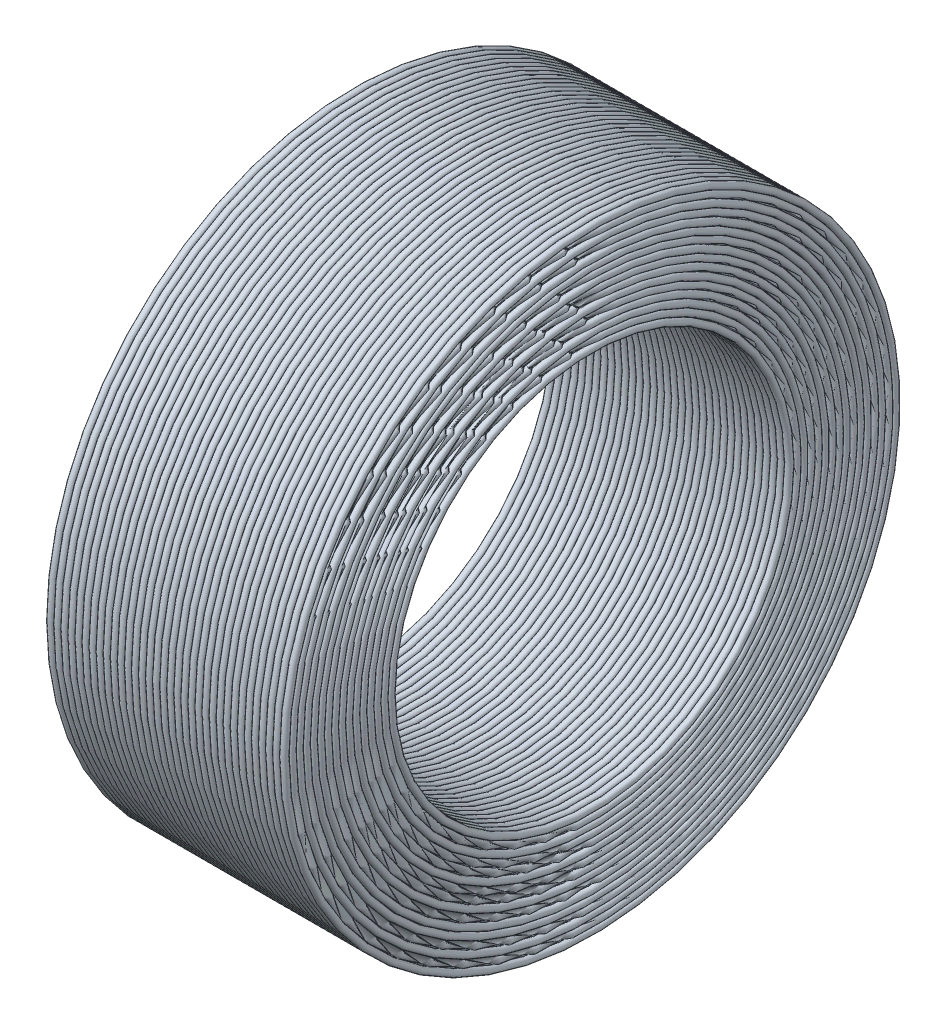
ISO-10303-21;
HEADER;
FILE_DESCRIPTION(('STEP AP214'),'2;1');
FILE_NAME('part.step','',(''),(''),'','','');
FILE_SCHEMA(('AUTOMOTIVE_DESIGN { 1 0 10303 214 1 1 1 1 }'));
ENDSEC;
DATA;
#1=APPLICATION_CONTEXT('core data for automotive mechanical design processes');
#2=APPLICATION_PROTOCOL_DEFINITION('international standard','automotive_design',2000,#1);
#3=PRODUCT_CONTEXT('',#1,'mechanical');
#4=PRODUCT('Part','Part','',(#3));
#5=PRODUCT_RELATED_PRODUCT_CATEGORY('part','',(#4));
#6=PRODUCT_DEFINITION_FORMATION('','',#4);
#7=PRODUCT_DEFINITION_CONTEXT('part definition',#1,'design');
#8=PRODUCT_DEFINITION('design','',#6,#7);
#9=PRODUCT_DEFINITION_SHAPE('','',#8);
#10=(LENGTH_UNIT() NAMED_UNIT(*) SI_UNIT(.MILLI.,.METRE.));
#11=(NAMED_UNIT(*) PLANE_ANGLE_UNIT() SI_UNIT($,.RADIAN.));
#12=(NAMED_UNIT(*) SI_UNIT($,.STERADIAN.) SOLID_ANGLE_UNIT());
#13=UNCERTAINTY_MEASURE_WITH_UNIT(LENGTH_MEASURE(1.E-05),#10,'distance_accuracy_value','');
#14=(GEOMETRIC_REPRESENTATION_CONTEXT(3) GLOBAL_UNCERTAINTY_ASSIGNED_CONTEXT((#13)) GLOBAL_UNIT_ASSIGNED_CONTEXT((#10,
#11,#12)) REPRESENTATION_CONTEXT('',''));
#15=CARTESIAN_POINT('',(0.,0.,0.));
#16=DIRECTION('',(0.,0.,1.));
#17=DIRECTION('',(1.,0.,0.));
#18=AXIS2_PLACEMENT_3D('',#15,#16,#17);
#19=CARTESIAN_POINT('',(12.6,-50.875,0.));
#20=DIRECTION('',(-1.,0.,0.));
#21=DIRECTION('',(0.,0.,1.));
#22=AXIS2_PLACEMENT_3D('',#19,#20,#21);
#23=TOROIDAL_SURFACE('',#22,50.875,0.875);
#24=CARTESIAN_POINT('',(11.8819296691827,-50.875,0.));
#25=DIRECTION('',(-1.,0.,0.));
#26=DIRECTION('',(0.,0.,1.));
#27=AXIS2_PLACEMENT_3D('',#24,#25,#26);
#28=CIRCLE('',#27,51.375);
#29=CARTESIAN_POINT('',(11.8819296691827,-50.875,51.375));
#30=VERTEX_POINT('',#29);
#31=EDGE_CURVE('E1193',#30,#30,#28,.T.);
#32=ORIENTED_EDGE('',*,*,#31,.T.);
#33=EDGE_LOOP('',(#32));
#34=FACE_BOUND('',#33,.T.);
#35=CARTESIAN_POINT('',(13.3180703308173,-50.875,0.));
#36=DIRECTION('',(-1.,0.,0.));
#37=DIRECTION('',(0.,0.,1.));
#38=AXIS2_PLACEMENT_3D('',#35,#36,#37);
#39=CIRCLE('',#38,51.375);
#40=CARTESIAN_POINT('',(13.3180703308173,-50.875,51.375));
#41=VERTEX_POINT('',#40);
#42=EDGE_CURVE('E1191',#41,#41,#39,.F.);
#43=ORIENTED_EDGE('',*,*,#42,.T.);
#44=EDGE_LOOP('',(#43));
#45=FACE_BOUND('',#44,.T.);
#46=ADVANCED_FACE('F15',(#34,#45),#23,.T.);
#47=CARTESIAN_POINT('',(0.,-50.875,0.));
#48=DIRECTION('',(-1.,0.,0.));
#49=DIRECTION('',(0.,0.,1.));
#50=AXIS2_PLACEMENT_3D('',#47,#48,#49);
#51=CYLINDRICAL_SURFACE('',#50,51.375);
#52=ORIENTED_EDGE('',*,*,#31,.F.);
#53=EDGE_LOOP('',(#52));
#54=FACE_BOUND('',#53,.T.);
#55=CARTESIAN_POINT('',(11.5180703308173,-50.875,0.));
#56=DIRECTION('',(-1.,0.,0.));
#57=DIRECTION('',(0.,0.,1.));
#58=AXIS2_PLACEMENT_3D('',#55,#56,#57);
#59=CIRCLE('',#58,51.375);
#60=CARTESIAN_POINT('',(11.5180703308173,-50.875,51.375));
#61=VERTEX_POINT('',#60);
#62=EDGE_CURVE('E1188',#61,#61,#59,.F.);
#63=ORIENTED_EDGE('',*,*,#62,.F.);
#64=EDGE_LOOP('',(#63));
#65=FACE_BOUND('',#64,.T.);
#66=ADVANCED_FACE('F2566',(#54,#65),#51,.F.);
#67=CARTESIAN_POINT('',(0.,-50.875,0.));
#68=DIRECTION('',(-1.,0.,0.));
#69=DIRECTION('',(0.,0.,1.));
#70=AXIS2_PLACEMENT_3D('',#67,#68,#69);
#71=CYLINDRICAL_SURFACE('',#70,51.375);
#72=ORIENTED_EDGE('',*,*,#42,.F.);
#73=EDGE_LOOP('',(#72));
#74=FACE_BOUND('',#73,.T.);
#75=CARTESIAN_POINT('',(13.6819296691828,-50.875,0.));
#76=DIRECTION('',(-1.,0.,0.));
#77=DIRECTION('',(0.,0.,1.));
#78=AXIS2_PLACEMENT_3D('',#75,#76,#77);
#79=CIRCLE('',#78,51.375);
#80=CARTESIAN_POINT('',(13.6819296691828,-50.875,51.375));
#81=VERTEX_POINT('',#80);
#82=EDGE_CURVE('E1185',#81,#81,#79,.T.);
#83=ORIENTED_EDGE('',*,*,#82,.F.);
#84=EDGE_LOOP('',(#83));
#85=FACE_BOUND('',#84,.T.);
#86=ADVANCED_FACE('F1181',(#74,#85),#71,.F.);
#87=CARTESIAN_POINT('',(10.8,-50.875,0.));
#88=DIRECTION('',(-1.,0.,0.));
#89=DIRECTION('',(0.,0.,1.));
#90=AXIS2_PLACEMENT_3D('',#87,#88,#89);
#91=TOROIDAL_SURFACE('',#90,50.875,0.875);
#92=ORIENTED_EDGE('',*,*,#62,.T.);
#93=EDGE_LOOP('',(#92));
#94=FACE_BOUND('',#93,.T.);
#95=CARTESIAN_POINT('',(10.0819296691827,-50.875,0.));
#96=DIRECTION('',(-1.,0.,0.));
#97=DIRECTION('',(0.,0.,1.));
#98=AXIS2_PLACEMENT_3D('',#95,#96,#97);
#99=CIRCLE('',#98,51.375);
#100=CARTESIAN_POINT('',(10.0819296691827,-50.875,51.375));
#101=VERTEX_POINT('',#100);
#102=EDGE_CURVE('E1168',#101,#101,#99,.T.);
#103=ORIENTED_EDGE('',*,*,#102,.T.);
#104=EDGE_LOOP('',(#103));
#105=FACE_BOUND('',#104,.T.);
#106=ADVANCED_FACE('F1177',(#94,#105),#91,.T.);
#107=CARTESIAN_POINT('',(14.4,-50.875,0.));
#108=DIRECTION('',(-1.,0.,0.));
#109=DIRECTION('',(0.,0.,1.));
#110=AXIS2_PLACEMENT_3D('',#107,#108,#109);
#111=TOROIDAL_SURFACE('',#110,50.875,0.875);
#112=ORIENTED_EDGE('',*,*,#82,.T.);
#113=EDGE_LOOP('',(#112));
#114=FACE_BOUND('',#113,.T.);
#115=CARTESIAN_POINT('',(15.1180703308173,-50.875,0.));
#116=DIRECTION('',(-1.,0.,0.));
#117=DIRECTION('',(0.,0.,1.));
#118=AXIS2_PLACEMENT_3D('',#115,#116,#117);
#119=CIRCLE('',#118,51.375);
#120=CARTESIAN_POINT('',(15.1180703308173,-50.875,51.375));
#121=VERTEX_POINT('',#120);
#122=EDGE_CURVE('E1165',#121,#121,#119,.F.);
#123=ORIENTED_EDGE('',*,*,#122,.T.);
#124=EDGE_LOOP('',(#123));
#125=FACE_BOUND('',#124,.T.);
#126=ADVANCED_FACE('F1173',(#114,#125),#111,.T.);
#127=CARTESIAN_POINT('',(0.,-50.875,0.));
#128=DIRECTION('',(-1.,0.,0.));
#129=DIRECTION('',(0.,0.,1.));
#130=AXIS2_PLACEMENT_3D('',#127,#128,#129);
#131=CYLINDRICAL_SURFACE('',#130,51.375);
#132=ORIENTED_EDGE('',*,*,#102,.F.);
#133=EDGE_LOOP('',(#132));
#134=FACE_BOUND('',#133,.T.);
#135=CARTESIAN_POINT('',(9.71807033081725,-50.875,0.));
#136=DIRECTION('',(-1.,0.,0.));
#137=DIRECTION('',(0.,0.,1.));
#138=AXIS2_PLACEMENT_3D('',#135,#136,#137);
#139=CIRCLE('',#138,51.375);
#140=CARTESIAN_POINT('',(9.71807033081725,-50.875,51.375));
#141=VERTEX_POINT('',#140);
#142=EDGE_CURVE('E1162',#141,#141,#139,.F.);
#143=ORIENTED_EDGE('',*,*,#142,.F.);
#144=EDGE_LOOP('',(#143));
#145=FACE_BOUND('',#144,.T.);
#146=ADVANCED_FACE('F1176',(#134,#145),#131,.F.);
#147=CARTESIAN_POINT('',(0.,-50.875,0.));
#148=DIRECTION('',(-1.,0.,0.));
#149=DIRECTION('',(0.,0.,1.));
#150=AXIS2_PLACEMENT_3D('',#147,#148,#149);
#151=CYLINDRICAL_SURFACE('',#150,51.375);
#152=ORIENTED_EDGE('',*,*,#122,.F.);
#153=EDGE_LOOP('',(#152));
#154=FACE_BOUND('',#153,.T.);
#155=CARTESIAN_POINT('',(15.4819296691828,-50.875,0.));
#156=DIRECTION('',(-1.,0.,0.));
#157=DIRECTION('',(0.,0.,1.));
#158=AXIS2_PLACEMENT_3D('',#155,#156,#157);
#159=CIRCLE('',#158,51.375);
#160=CARTESIAN_POINT('',(15.4819296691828,-50.875,51.375));
#161=VERTEX_POINT('',#160);
#162=EDGE_CURVE('E1159',#161,#161,#159,.T.);
#163=ORIENTED_EDGE('',*,*,#162,.F.);
#164=EDGE_LOOP('',(#163));
#165=FACE_BOUND('',#164,.T.);
#166=ADVANCED_FACE('F1154',(#154,#165),#151,.F.);
#167=CARTESIAN_POINT('',(9.,-50.875,0.));
#168=DIRECTION('',(-1.,0.,0.));
#169=DIRECTION('',(0.,0.,1.));
#170=AXIS2_PLACEMENT_3D('',#167,#168,#169);
#171=TOROIDAL_SURFACE('',#170,50.875,0.875);
#172=ORIENTED_EDGE('',*,*,#142,.T.);
#173=EDGE_LOOP('',(#172));
#174=FACE_BOUND('',#173,.T.);
#175=CARTESIAN_POINT('',(8.28192966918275,-50.875,0.));
#176=DIRECTION('',(-1.,0.,0.));
#177=DIRECTION('',(0.,0.,1.));
#178=AXIS2_PLACEMENT_3D('',#175,#176,#177);
#179=CIRCLE('',#178,51.375);
#180=CARTESIAN_POINT('',(8.28192966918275,-50.875,51.375));
#181=VERTEX_POINT('',#180);
#182=EDGE_CURVE('E1141',#181,#181,#179,.T.);
#183=ORIENTED_EDGE('',*,*,#182,.T.);
#184=EDGE_LOOP('',(#183));
#185=FACE_BOUND('',#184,.T.);
#186=ADVANCED_FACE('F1150',(#174,#185),#171,.T.);
#187=CARTESIAN_POINT('',(16.2,-50.875,0.));
#188=DIRECTION('',(-1.,0.,0.));
#189=DIRECTION('',(0.,0.,1.));
#190=AXIS2_PLACEMENT_3D('',#187,#188,#189);
#191=TOROIDAL_SURFACE('',#190,50.875,0.874999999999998);
#192=ORIENTED_EDGE('',*,*,#162,.T.);
#193=EDGE_LOOP('',(#192));
#194=FACE_BOUND('',#193,.T.);
#195=CARTESIAN_POINT('',(16.9180703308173,-50.875,0.));
#196=DIRECTION('',(-1.,0.,0.));
#197=DIRECTION('',(0.,0.,1.));
#198=AXIS2_PLACEMENT_3D('',#195,#196,#197);
#199=CIRCLE('',#198,51.375);
#200=CARTESIAN_POINT('',(16.9180703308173,-50.875,51.375));
#201=VERTEX_POINT('',#200);
#202=EDGE_CURVE('E1138',#201,#201,#199,.F.);
#203=ORIENTED_EDGE('',*,*,#202,.T.);
#204=EDGE_LOOP('',(#203));
#205=FACE_BOUND('',#204,.T.);
#206=ADVANCED_FACE('F1146',(#194,#205),#191,.T.);
#207=CARTESIAN_POINT('',(0.,-50.875,0.));
#208=DIRECTION('',(-1.,0.,0.));
#209=DIRECTION('',(0.,0.,1.));
#210=AXIS2_PLACEMENT_3D('',#207,#208,#209);
#211=CYLINDRICAL_SURFACE('',#210,51.375);
#212=ORIENTED_EDGE('',*,*,#182,.F.);
#213=EDGE_LOOP('',(#212));
#214=FACE_BOUND('',#213,.T.);
#215=CARTESIAN_POINT('',(7.91807033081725,-50.875,0.));
#216=DIRECTION('',(-1.,0.,0.));
#217=DIRECTION('',(0.,0.,1.));
#218=AXIS2_PLACEMENT_3D('',#215,#216,#217);
#219=CIRCLE('',#218,51.375);
#220=CARTESIAN_POINT('',(7.91807033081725,-50.875,51.375));
#221=VERTEX_POINT('',#220);
#222=EDGE_CURVE('E1135',#221,#221,#219,.F.);
#223=ORIENTED_EDGE('',*,*,#222,.F.);
#224=EDGE_LOOP('',(#223));
#225=FACE_BOUND('',#224,.T.);
#226=ADVANCED_FACE('F1149',(#214,#225),#211,.F.);
#227=CARTESIAN_POINT('',(0.,-50.875,0.));
#228=DIRECTION('',(-1.,0.,0.));
#229=DIRECTION('',(0.,0.,1.));
#230=AXIS2_PLACEMENT_3D('',#227,#228,#229);
#231=CYLINDRICAL_SURFACE('',#230,51.375);
#232=ORIENTED_EDGE('',*,*,#202,.F.);
#233=EDGE_LOOP('',(#232));
#234=FACE_BOUND('',#233,.T.);
#235=CARTESIAN_POINT('',(17.2819296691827,-50.875,0.));
#236=DIRECTION('',(-1.,0.,0.));
#237=DIRECTION('',(0.,0.,1.));
#238=AXIS2_PLACEMENT_3D('',#235,#236,#237);
#239=CIRCLE('',#238,51.375);
#240=CARTESIAN_POINT('',(17.2819296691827,-50.875,51.375));
#241=VERTEX_POINT('',#240);
#242=EDGE_CURVE('E1132',#241,#241,#239,.T.);
#243=ORIENTED_EDGE('',*,*,#242,.F.);
#244=EDGE_LOOP('',(#243));
#245=FACE_BOUND('',#244,.T.);
#246=ADVANCED_FACE('F1127',(#234,#245),#231,.F.);
#247=CARTESIAN_POINT('',(7.2,-50.875,0.));
#248=DIRECTION('',(-1.,0.,0.));
#249=DIRECTION('',(0.,0.,1.));
#250=AXIS2_PLACEMENT_3D('',#247,#248,#249);
#251=TOROIDAL_SURFACE('',#250,50.875,0.875);
#252=ORIENTED_EDGE('',*,*,#222,.T.);
#253=EDGE_LOOP('',(#252));
#254=FACE_BOUND('',#253,.T.);
#255=CARTESIAN_POINT('',(6.48192966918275,-50.875,0.));
#256=DIRECTION('',(-1.,0.,0.));
#257=DIRECTION('',(0.,0.,1.));
#258=AXIS2_PLACEMENT_3D('',#255,#256,#257);
#259=CIRCLE('',#258,51.375);
#260=CARTESIAN_POINT('',(6.48192966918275,-50.875,51.375));
#261=VERTEX_POINT('',#260);
#262=EDGE_CURVE('E1114',#261,#261,#259,.T.);
#263=ORIENTED_EDGE('',*,*,#262,.T.);
#264=EDGE_LOOP('',(#263));
#265=FACE_BOUND('',#264,.T.);
#266=ADVANCED_FACE('F1123',(#254,#265),#251,.T.);
#267=CARTESIAN_POINT('',(18.,-50.875,0.));
#268=DIRECTION('',(-1.,0.,0.));
#269=DIRECTION('',(0.,0.,1.));
#270=AXIS2_PLACEMENT_3D('',#267,#268,#269);
#271=TOROIDAL_SURFACE('',#270,50.875,0.875000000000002);
#272=ORIENTED_EDGE('',*,*,#242,.T.);
#273=EDGE_LOOP('',(#272));
#274=FACE_BOUND('',#273,.T.);
#275=CARTESIAN_POINT('',(18.7180703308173,-50.875,0.));
#276=DIRECTION('',(-1.,0.,0.));
#277=DIRECTION('',(0.,0.,1.));
#278=AXIS2_PLACEMENT_3D('',#275,#276,#277);
#279=CIRCLE('',#278,51.375);
#280=CARTESIAN_POINT('',(18.7180703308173,-50.875,51.375));
#281=VERTEX_POINT('',#280);
#282=EDGE_CURVE('E1111',#281,#281,#279,.F.);
#283=ORIENTED_EDGE('',*,*,#282,.T.);
#284=EDGE_LOOP('',(#283));
#285=FACE_BOUND('',#284,.T.);
#286=ADVANCED_FACE('F1119',(#274,#285),#271,.T.);
#287=CARTESIAN_POINT('',(0.,-50.875,0.));
#288=DIRECTION('',(-1.,0.,0.));
#289=DIRECTION('',(0.,0.,1.));
#290=AXIS2_PLACEMENT_3D('',#287,#288,#289);
#291=CYLINDRICAL_SURFACE('',#290,51.375);
#292=ORIENTED_EDGE('',*,*,#262,.F.);
#293=EDGE_LOOP('',(#292));
#294=FACE_BOUND('',#293,.T.);
#295=CARTESIAN_POINT('',(6.11807033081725,-50.875,0.));
#296=DIRECTION('',(-1.,0.,0.));
#297=DIRECTION('',(0.,0.,1.));
#298=AXIS2_PLACEMENT_3D('',#295,#296,#297);
#299=CIRCLE('',#298,51.375);
#300=CARTESIAN_POINT('',(6.11807033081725,-50.875,51.375));
#301=VERTEX_POINT('',#300);
#302=EDGE_CURVE('E1108',#301,#301,#299,.F.);
#303=ORIENTED_EDGE('',*,*,#302,.F.);
#304=EDGE_LOOP('',(#303));
#305=FACE_BOUND('',#304,.T.);
#306=ADVANCED_FACE('F1122',(#294,#305),#291,.F.);
#307=CARTESIAN_POINT('',(0.,-50.875,0.));
#308=DIRECTION('',(-1.,0.,0.));
#309=DIRECTION('',(0.,0.,1.));
#310=AXIS2_PLACEMENT_3D('',#307,#308,#309);
#311=CYLINDRICAL_SURFACE('',#310,51.375);
#312=ORIENTED_EDGE('',*,*,#282,.F.);
#313=EDGE_LOOP('',(#312));
#314=FACE_BOUND('',#313,.T.);
#315=CARTESIAN_POINT('',(19.0819296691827,-50.875,0.));
#316=DIRECTION('',(-1.,0.,0.));
#317=DIRECTION('',(0.,0.,1.));
#318=AXIS2_PLACEMENT_3D('',#315,#316,#317);
#319=CIRCLE('',#318,51.375);
#320=CARTESIAN_POINT('',(19.0819296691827,-50.875,51.375));
#321=VERTEX_POINT('',#320);
#322=EDGE_CURVE('E1105',#321,#321,#319,.T.);
#323=ORIENTED_EDGE('',*,*,#322,.F.);
#324=EDGE_LOOP('',(#323));
#325=FACE_BOUND('',#324,.T.);
#326=ADVANCED_FACE('F1100',(#314,#325),#311,.F.);
#327=CARTESIAN_POINT('',(5.4,-50.875,0.));
#328=DIRECTION('',(-1.,0.,0.));
#329=DIRECTION('',(0.,0.,1.));
#330=AXIS2_PLACEMENT_3D('',#327,#328,#329);
#331=TOROIDAL_SURFACE('',#330,50.875,0.875);
#332=ORIENTED_EDGE('',*,*,#302,.T.);
#333=EDGE_LOOP('',(#332));
#334=FACE_BOUND('',#333,.T.);
#335=CARTESIAN_POINT('',(4.68192966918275,-50.875,0.));
#336=DIRECTION('',(-1.,0.,0.));
#337=DIRECTION('',(0.,0.,1.));
#338=AXIS2_PLACEMENT_3D('',#335,#336,#337);
#339=CIRCLE('',#338,51.375);
#340=CARTESIAN_POINT('',(4.68192966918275,-50.875,51.375));
#341=VERTEX_POINT('',#340);
#342=EDGE_CURVE('E1087',#341,#341,#339,.T.);
#343=ORIENTED_EDGE('',*,*,#342,.T.);
#344=EDGE_LOOP('',(#343));
#345=FACE_BOUND('',#344,.T.);
#346=ADVANCED_FACE('F1096',(#334,#345),#331,.T.);
#347=CARTESIAN_POINT('',(19.8,-50.875,0.));
#348=DIRECTION('',(-1.,0.,0.));
#349=DIRECTION('',(0.,0.,1.));
#350=AXIS2_PLACEMENT_3D('',#347,#348,#349);
#351=TOROIDAL_SURFACE('',#350,50.875,0.874999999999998);
#352=ORIENTED_EDGE('',*,*,#322,.T.);
#353=EDGE_LOOP('',(#352));
#354=FACE_BOUND('',#353,.T.);
#355=CARTESIAN_POINT('',(20.5180703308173,-50.875,0.));
#356=DIRECTION('',(-1.,0.,0.));
#357=DIRECTION('',(0.,0.,1.));
#358=AXIS2_PLACEMENT_3D('',#355,#356,#357);
#359=CIRCLE('',#358,51.375);
#360=CARTESIAN_POINT('',(20.5180703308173,-50.875,51.375));
#361=VERTEX_POINT('',#360);
#362=EDGE_CURVE('E1084',#361,#361,#359,.F.);
#363=ORIENTED_EDGE('',*,*,#362,.T.);
#364=EDGE_LOOP('',(#363));
#365=FACE_BOUND('',#364,.T.);
#366=ADVANCED_FACE('F1092',(#354,#365),#351,.T.);
#367=CARTESIAN_POINT('',(0.,-50.875,0.));
#368=DIRECTION('',(-1.,0.,0.));
#369=DIRECTION('',(0.,0.,1.));
#370=AXIS2_PLACEMENT_3D('',#367,#368,#369);
#371=CYLINDRICAL_SURFACE('',#370,51.375);
#372=ORIENTED_EDGE('',*,*,#342,.F.);
#373=EDGE_LOOP('',(#372));
#374=FACE_BOUND('',#373,.T.);
#375=CARTESIAN_POINT('',(4.31807033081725,-50.875,0.));
#376=DIRECTION('',(-1.,0.,0.));
#377=DIRECTION('',(0.,0.,1.));
#378=AXIS2_PLACEMENT_3D('',#375,#376,#377);
#379=CIRCLE('',#378,51.375);
#380=CARTESIAN_POINT('',(4.31807033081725,-50.875,51.375));
#381=VERTEX_POINT('',#380);
#382=EDGE_CURVE('E1081',#381,#381,#379,.F.);
#383=ORIENTED_EDGE('',*,*,#382,.F.);
#384=EDGE_LOOP('',(#383));
#385=FACE_BOUND('',#384,.T.);
#386=ADVANCED_FACE('F1095',(#374,#385),#371,.F.);
#387=CARTESIAN_POINT('',(0.,-50.875,0.));
#388=DIRECTION('',(-1.,0.,0.));
#389=DIRECTION('',(0.,0.,1.));
#390=AXIS2_PLACEMENT_3D('',#387,#388,#389);
#391=CYLINDRICAL_SURFACE('',#390,51.375);
#392=ORIENTED_EDGE('',*,*,#362,.F.);
#393=EDGE_LOOP('',(#392));
#394=FACE_BOUND('',#393,.T.);
#395=CARTESIAN_POINT('',(20.8819296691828,-50.875,0.));
#396=DIRECTION('',(-1.,0.,0.));
#397=DIRECTION('',(0.,0.,1.));
#398=AXIS2_PLACEMENT_3D('',#395,#396,#397);
#399=CIRCLE('',#398,51.375);
#400=CARTESIAN_POINT('',(20.8819296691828,-50.875,51.375));
#401=VERTEX_POINT('',#400);
#402=EDGE_CURVE('E1078',#401,#401,#399,.T.);
#403=ORIENTED_EDGE('',*,*,#402,.F.);
#404=EDGE_LOOP('',(#403));
#405=FACE_BOUND('',#404,.T.);
#406=ADVANCED_FACE('F1073',(#394,#405),#391,.F.);
#407=CARTESIAN_POINT('',(3.6,-50.875,0.));
#408=DIRECTION('',(-1.,0.,0.));
#409=DIRECTION('',(0.,0.,1.));
#410=AXIS2_PLACEMENT_3D('',#407,#408,#409);
#411=TOROIDAL_SURFACE('',#410,50.875,0.875);
#412=ORIENTED_EDGE('',*,*,#382,.T.);
#413=EDGE_LOOP('',(#412));
#414=FACE_BOUND('',#413,.T.);
#415=CARTESIAN_POINT('',(2.88192966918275,-50.875,0.));
#416=DIRECTION('',(-1.,0.,0.));
#417=DIRECTION('',(0.,0.,1.));
#418=AXIS2_PLACEMENT_3D('',#415,#416,#417);
#419=CIRCLE('',#418,51.375);
#420=CARTESIAN_POINT('',(2.88192966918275,-50.875,51.375));
#421=VERTEX_POINT('',#420);
#422=EDGE_CURVE('E1060',#421,#421,#419,.T.);
#423=ORIENTED_EDGE('',*,*,#422,.T.);
#424=EDGE_LOOP('',(#423));
#425=FACE_BOUND('',#424,.T.);
#426=ADVANCED_FACE('F1069',(#414,#425),#411,.T.);
#427=CARTESIAN_POINT('',(21.6,-50.875,0.));
#428=DIRECTION('',(-1.,0.,0.));
#429=DIRECTION('',(0.,0.,1.));
#430=AXIS2_PLACEMENT_3D('',#427,#428,#429);
#431=TOROIDAL_SURFACE('',#430,50.875,0.874999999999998);
#432=ORIENTED_EDGE('',*,*,#402,.T.);
#433=EDGE_LOOP('',(#432));
#434=FACE_BOUND('',#433,.T.);
#435=CARTESIAN_POINT('',(22.3180703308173,-50.875,0.));
#436=DIRECTION('',(-1.,0.,0.));
#437=DIRECTION('',(0.,0.,1.));
#438=AXIS2_PLACEMENT_3D('',#435,#436,#437);
#439=CIRCLE('',#438,51.375);
#440=CARTESIAN_POINT('',(22.3180703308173,-50.875,51.375));
#441=VERTEX_POINT('',#440);
#442=EDGE_CURVE('E1057',#441,#441,#439,.F.);
#443=ORIENTED_EDGE('',*,*,#442,.T.);
#444=EDGE_LOOP('',(#443));
#445=FACE_BOUND('',#444,.T.);
#446=ADVANCED_FACE('F1065',(#434,#445),#431,.T.);
#447=CARTESIAN_POINT('',(0.,-50.875,0.));
#448=DIRECTION('',(-1.,0.,0.));
#449=DIRECTION('',(0.,0.,1.));
#450=AXIS2_PLACEMENT_3D('',#447,#448,#449);
#451=CYLINDRICAL_SURFACE('',#450,51.375);
#452=ORIENTED_EDGE('',*,*,#422,.F.);
#453=EDGE_LOOP('',(#452));
#454=FACE_BOUND('',#453,.T.);
#455=CARTESIAN_POINT('',(2.51807033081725,-50.875,0.));
#456=DIRECTION('',(-1.,0.,0.));
#457=DIRECTION('',(0.,0.,1.));
#458=AXIS2_PLACEMENT_3D('',#455,#456,#457);
#459=CIRCLE('',#458,51.375);
#460=CARTESIAN_POINT('',(2.51807033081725,-50.875,51.375));
#461=VERTEX_POINT('',#460);
#462=EDGE_CURVE('E1054',#461,#461,#459,.F.);
#463=ORIENTED_EDGE('',*,*,#462,.F.);
#464=EDGE_LOOP('',(#463));
#465=FACE_BOUND('',#464,.T.);
#466=ADVANCED_FACE('F1068',(#454,#465),#451,.F.);
#467=CARTESIAN_POINT('',(0.,-50.875,0.));
#468=DIRECTION('',(-1.,0.,0.));
#469=DIRECTION('',(0.,0.,1.));
#470=AXIS2_PLACEMENT_3D('',#467,#468,#469);
#471=CYLINDRICAL_SURFACE('',#470,51.375);
#472=ORIENTED_EDGE('',*,*,#442,.F.);
#473=EDGE_LOOP('',(#472));
#474=FACE_BOUND('',#473,.T.);
#475=CARTESIAN_POINT('',(22.6819296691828,-50.875,0.));
#476=DIRECTION('',(-1.,0.,0.));
#477=DIRECTION('',(0.,0.,1.));
#478=AXIS2_PLACEMENT_3D('',#475,#476,#477);
#479=CIRCLE('',#478,51.375);
#480=CARTESIAN_POINT('',(22.6819296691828,-50.875,51.375));
#481=VERTEX_POINT('',#480);
#482=EDGE_CURVE('E1051',#481,#481,#479,.T.);
#483=ORIENTED_EDGE('',*,*,#482,.F.);
#484=EDGE_LOOP('',(#483));
#485=FACE_BOUND('',#484,.T.);
#486=ADVANCED_FACE('F1046',(#474,#485),#471,.F.);
#487=CARTESIAN_POINT('',(1.8,-50.875,0.));
#488=DIRECTION('',(-1.,0.,0.));
#489=DIRECTION('',(0.,0.,1.));
#490=AXIS2_PLACEMENT_3D('',#487,#488,#489);
#491=TOROIDAL_SURFACE('',#490,50.875,0.875);
#492=ORIENTED_EDGE('',*,*,#462,.T.);
#493=EDGE_LOOP('',(#492));
#494=FACE_BOUND('',#493,.T.);
#495=CARTESIAN_POINT('',(1.08192966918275,-50.875,0.));
#496=DIRECTION('',(-1.,0.,0.));
#497=DIRECTION('',(0.,0.,1.));
#498=AXIS2_PLACEMENT_3D('',#495,#496,#497);
#499=CIRCLE('',#498,51.375);
#500=CARTESIAN_POINT('',(1.08192966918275,-50.875,51.375));
#501=VERTEX_POINT('',#500);
#502=EDGE_CURVE('E1033',#501,#501,#499,.T.);
#503=ORIENTED_EDGE('',*,*,#502,.T.);
#504=EDGE_LOOP('',(#503));
#505=FACE_BOUND('',#504,.T.);
#506=ADVANCED_FACE('F1042',(#494,#505),#491,.T.);
#507=CARTESIAN_POINT('',(23.4,-50.875,0.));
#508=DIRECTION('',(-1.,0.,0.));
#509=DIRECTION('',(0.,0.,1.));
#510=AXIS2_PLACEMENT_3D('',#507,#508,#509);
#511=TOROIDAL_SURFACE('',#510,50.875,0.875000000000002);
#512=ORIENTED_EDGE('',*,*,#482,.T.);
#513=EDGE_LOOP('',(#512));
#514=FACE_BOUND('',#513,.T.);
#515=CARTESIAN_POINT('',(24.1180703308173,-50.875,0.));
#516=DIRECTION('',(-1.,0.,0.));
#517=DIRECTION('',(0.,0.,1.));
#518=AXIS2_PLACEMENT_3D('',#515,#516,#517);
#519=CIRCLE('',#518,51.375);
#520=CARTESIAN_POINT('',(24.1180703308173,-50.875,51.375));
#521=VERTEX_POINT('',#520);
#522=EDGE_CURVE('E1030',#521,#521,#519,.F.);
#523=ORIENTED_EDGE('',*,*,#522,.T.);
#524=EDGE_LOOP('',(#523));
#525=FACE_BOUND('',#524,.T.);
#526=ADVANCED_FACE('F1038',(#514,#525),#511,.T.);
#527=CARTESIAN_POINT('',(0.,-50.875,0.));
#528=DIRECTION('',(-1.,0.,0.));
#529=DIRECTION('',(0.,0.,1.));
#530=AXIS2_PLACEMENT_3D('',#527,#528,#529);
#531=CYLINDRICAL_SURFACE('',#530,51.375);
#532=ORIENTED_EDGE('',*,*,#502,.F.);
#533=EDGE_LOOP('',(#532));
#534=FACE_BOUND('',#533,.T.);
#535=CARTESIAN_POINT('',(0.71807033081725,-50.875,0.));
#536=DIRECTION('',(-1.,0.,0.));
#537=DIRECTION('',(0.,0.,1.));
#538=AXIS2_PLACEMENT_3D('',#535,#536,#537);
#539=CIRCLE('',#538,51.375);
#540=CARTESIAN_POINT('',(0.71807033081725,-50.875,51.375));
#541=VERTEX_POINT('',#540);
#542=EDGE_CURVE('E1027',#541,#541,#539,.F.);
#543=ORIENTED_EDGE('',*,*,#542,.F.);
#544=EDGE_LOOP('',(#543));
#545=FACE_BOUND('',#544,.T.);
#546=ADVANCED_FACE('F1041',(#534,#545),#531,.F.);
#547=CARTESIAN_POINT('',(0.,-50.875,0.));
#548=DIRECTION('',(-1.,0.,0.));
#549=DIRECTION('',(0.,0.,1.));
#550=AXIS2_PLACEMENT_3D('',#547,#548,#549);
#551=CYLINDRICAL_SURFACE('',#550,51.375);
#552=ORIENTED_EDGE('',*,*,#522,.F.);
#553=EDGE_LOOP('',(#552));
#554=FACE_BOUND('',#553,.T.);
#555=CARTESIAN_POINT('',(24.4819296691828,-50.875,0.));
#556=DIRECTION('',(-1.,0.,0.));
#557=DIRECTION('',(0.,0.,1.));
#558=AXIS2_PLACEMENT_3D('',#555,#556,#557);
#559=CIRCLE('',#558,51.375);
#560=CARTESIAN_POINT('',(24.4819296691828,-50.875,51.375));
#561=VERTEX_POINT('',#560);
#562=EDGE_CURVE('E1024',#561,#561,#559,.T.);
#563=ORIENTED_EDGE('',*,*,#562,.F.);
#564=EDGE_LOOP('',(#563));
#565=FACE_BOUND('',#564,.T.);
#566=ADVANCED_FACE('F1019',(#554,#565),#551,.F.);
#567=CARTESIAN_POINT('',(25.2,-50.875,0.));
#568=DIRECTION('',(-1.,0.,0.));
#569=DIRECTION('',(0.,0.,1.));
#570=AXIS2_PLACEMENT_3D('',#567,#568,#569);
#571=TOROIDAL_SURFACE('',#570,50.875,0.874999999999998);
#572=ORIENTED_EDGE('',*,*,#562,.T.);
#573=EDGE_LOOP('',(#572));
#574=FACE_BOUND('',#573,.T.);
#575=CARTESIAN_POINT('',(25.9180703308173,-50.875,0.));
#576=DIRECTION('',(-1.,0.,0.));
#577=DIRECTION('',(0.,0.,1.));
#578=AXIS2_PLACEMENT_3D('',#575,#576,#577);
#579=CIRCLE('',#578,51.375);
#580=CARTESIAN_POINT('',(25.9180703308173,-50.875,51.375));
#581=VERTEX_POINT('',#580);
#582=EDGE_CURVE('E1008',#581,#581,#579,.F.);
#583=ORIENTED_EDGE('',*,*,#582,.T.);
#584=EDGE_LOOP('',(#583));
#585=FACE_BOUND('',#584,.T.);
#586=ADVANCED_FACE('F1015',(#574,#585),#571,.T.);
#587=CARTESIAN_POINT('',(0.,-50.875,0.));
#588=DIRECTION('',(-1.,0.,0.));
#589=DIRECTION('',(0.,0.,1.));
#590=AXIS2_PLACEMENT_3D('',#587,#588,#589);
#591=TOROIDAL_SURFACE('',#590,50.875,0.875);
#592=ORIENTED_EDGE('',*,*,#542,.T.);
#593=EDGE_LOOP('',(#592));
#594=FACE_BOUND('',#593,.T.);
#595=CARTESIAN_POINT('',(0.5,-50.875,0.));
#596=DIRECTION('',(-1.,0.,0.));
#597=DIRECTION('',(0.,0.,1.));
#598=AXIS2_PLACEMENT_3D('',#595,#596,#597);
#599=CIRCLE('',#598,51.5930703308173);
#600=CARTESIAN_POINT('',(0.5,-50.875,51.5930703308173));
#601=VERTEX_POINT('',#600);
#602=EDGE_CURVE('E19',#601,#601,#599,.T.);
#603=ORIENTED_EDGE('',*,*,#602,.T.);
#604=EDGE_LOOP('',(#603));
#605=FACE_BOUND('',#604,.T.);
#606=ADVANCED_FACE('F1011',(#594,#605),#591,.T.);
#607=CARTESIAN_POINT('',(0.,-50.875,0.));
#608=DIRECTION('',(-1.,0.,0.));
#609=DIRECTION('',(0.,0.,1.));
#610=AXIS2_PLACEMENT_3D('',#607,#608,#609);
#611=CYLINDRICAL_SURFACE('',#610,51.375);
#612=ORIENTED_EDGE('',*,*,#582,.F.);
#613=EDGE_LOOP('',(#612));
#614=FACE_BOUND('',#613,.T.);
#615=CARTESIAN_POINT('',(26.2819296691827,-50.875,0.));
#616=DIRECTION('',(-1.,0.,0.));
#617=DIRECTION('',(0.,0.,1.));
#618=AXIS2_PLACEMENT_3D('',#615,#616,#617);
#619=CIRCLE('',#618,51.375);
#620=CARTESIAN_POINT('',(26.2819296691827,-50.875,51.375));
#621=VERTEX_POINT('',#620);
#622=EDGE_CURVE('E1002',#621,#621,#619,.T.);
#623=ORIENTED_EDGE('',*,*,#622,.F.);
#624=EDGE_LOOP('',(#623));
#625=FACE_BOUND('',#624,.T.);
#626=ADVANCED_FACE('F1014',(#614,#625),#611,.F.);
#627=CARTESIAN_POINT('',(0.5,0.,0.));
#628=DIRECTION('',(1.,0.,0.));
#629=DIRECTION('',(0.,0.,-1.));
#630=AXIS2_PLACEMENT_3D('',#627,#628,#629);
#631=PLANE('',#630);
#632=CARTESIAN_POINT('',(0.5,-50.875,0.));
#633=DIRECTION('',(-1.,0.,0.));
#634=DIRECTION('',(0.,0.,1.));
#635=AXIS2_PLACEMENT_3D('',#632,#633,#634);
#636=CIRCLE('',#635,51.9569296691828);
#637=CARTESIAN_POINT('',(0.5,-50.875,51.9569296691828));
#638=VERTEX_POINT('',#637);
#639=EDGE_CURVE('E1005',#638,#638,#636,.F.);
#640=ORIENTED_EDGE('',*,*,#639,.F.);
#641=EDGE_LOOP('',(#640));
#642=FACE_BOUND('',#641,.T.);
#643=ORIENTED_EDGE('',*,*,#602,.F.);
#644=EDGE_LOOP('',(#643));
#645=FACE_BOUND('',#644,.T.);
#646=ADVANCED_FACE('F996',(#642,#645),#631,.F.);
#647=CARTESIAN_POINT('',(27.,-50.875,0.));
#648=DIRECTION('',(-1.,0.,0.));
#649=DIRECTION('',(0.,0.,1.));
#650=AXIS2_PLACEMENT_3D('',#647,#648,#649);
#651=TOROIDAL_SURFACE('',#650,50.875,0.875000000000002);
#652=ORIENTED_EDGE('',*,*,#622,.T.);
#653=EDGE_LOOP('',(#652));
#654=FACE_BOUND('',#653,.T.);
#655=CARTESIAN_POINT('',(27.7180703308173,-50.875,0.));
#656=DIRECTION('',(-1.,0.,0.));
#657=DIRECTION('',(0.,0.,1.));
#658=AXIS2_PLACEMENT_3D('',#655,#656,#657);
#659=CIRCLE('',#658,51.375);
#660=CARTESIAN_POINT('',(27.7180703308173,-50.875,51.375));
#661=VERTEX_POINT('',#660);
#662=EDGE_CURVE('E1001',#661,#661,#659,.F.);
#663=ORIENTED_EDGE('',*,*,#662,.T.);
#664=EDGE_LOOP('',(#663));
#665=FACE_BOUND('',#664,.T.);
#666=ADVANCED_FACE('F991',(#654,#665),#651,.T.);
#667=CARTESIAN_POINT('',(0.,-50.875,0.));
#668=DIRECTION('',(-1.,0.,0.));
#669=DIRECTION('',(0.,0.,1.));
#670=AXIS2_PLACEMENT_3D('',#667,#668,#669);
#671=CYLINDRICAL_SURFACE('',#670,51.375);
#672=ORIENTED_EDGE('',*,*,#662,.F.);
#673=EDGE_LOOP('',(#672));
#674=FACE_BOUND('',#673,.T.);
#675=CARTESIAN_POINT('',(28.0819296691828,-50.875,0.));
#676=DIRECTION('',(-1.,0.,0.));
#677=DIRECTION('',(0.,0.,1.));
#678=AXIS2_PLACEMENT_3D('',#675,#676,#677);
#679=CIRCLE('',#678,51.375);
#680=CARTESIAN_POINT('',(28.0819296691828,-50.875,51.375));
#681=VERTEX_POINT('',#680);
#682=EDGE_CURVE('E982',#681,#681,#679,.T.);
#683=ORIENTED_EDGE('',*,*,#682,.F.);
#684=EDGE_LOOP('',(#683));
#685=FACE_BOUND('',#684,.T.);
#686=ADVANCED_FACE('F987',(#674,#685),#671,.F.);
#687=CARTESIAN_POINT('',(0.,-50.875,0.));
#688=DIRECTION('',(-1.,0.,0.));
#689=DIRECTION('',(0.,0.,1.));
#690=AXIS2_PLACEMENT_3D('',#687,#688,#689);
#691=TOROIDAL_SURFACE('',#690,52.675,0.875);
#692=ORIENTED_EDGE('',*,*,#639,.T.);
#693=EDGE_LOOP('',(#692));
#694=FACE_BOUND('',#693,.T.);
#695=CARTESIAN_POINT('',(0.5,-50.875,0.));
#696=DIRECTION('',(-1.,0.,0.));
#697=DIRECTION('',(0.,0.,1.));
#698=AXIS2_PLACEMENT_3D('',#695,#696,#697);
#699=CIRCLE('',#698,53.3930703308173);
#700=CARTESIAN_POINT('',(0.5,-50.875,53.3930703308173));
#701=VERTEX_POINT('',#700);
#702=EDGE_CURVE('E1341',#701,#701,#699,.T.);
#703=ORIENTED_EDGE('',*,*,#702,.T.);
#704=EDGE_LOOP('',(#703));
#705=FACE_BOUND('',#704,.T.);
#706=ADVANCED_FACE('F984',(#694,#705),#691,.T.);
#707=CARTESIAN_POINT('',(0.5,0.,0.));
#708=DIRECTION('',(1.,0.,0.));
#709=DIRECTION('',(0.,0.,-1.));
#710=AXIS2_PLACEMENT_3D('',#707,#708,#709);
#711=PLANE('',#710);
#712=CARTESIAN_POINT('',(0.5,-50.875,0.));
#713=DIRECTION('',(-1.,0.,0.));
#714=DIRECTION('',(0.,0.,1.));
#715=AXIS2_PLACEMENT_3D('',#712,#713,#714);
#716=CIRCLE('',#715,53.7569296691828);
#717=CARTESIAN_POINT('',(0.5,-50.875,53.7569296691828));
#718=VERTEX_POINT('',#717);
#719=EDGE_CURVE('E1338',#718,#718,#716,.F.);
#720=ORIENTED_EDGE('',*,*,#719,.F.);
#721=EDGE_LOOP('',(#720));
#722=FACE_BOUND('',#721,.T.);
#723=ORIENTED_EDGE('',*,*,#702,.F.);
#724=EDGE_LOOP('',(#723));
#725=FACE_BOUND('',#724,.T.);
#726=ADVANCED_FACE('F973',(#722,#725),#711,.F.);
#727=CARTESIAN_POINT('',(28.8,-50.875,0.));
#728=DIRECTION('',(-1.,0.,0.));
#729=DIRECTION('',(0.,0.,1.));
#730=AXIS2_PLACEMENT_3D('',#727,#728,#729);
#731=TOROIDAL_SURFACE('',#730,50.875,0.874999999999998);
#732=ORIENTED_EDGE('',*,*,#682,.T.);
#733=EDGE_LOOP('',(#732));
#734=FACE_BOUND('',#733,.T.);
#735=CARTESIAN_POINT('',(29.5180703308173,-50.875,0.));
#736=DIRECTION('',(-1.,0.,0.));
#737=DIRECTION('',(0.,0.,1.));
#738=AXIS2_PLACEMENT_3D('',#735,#736,#737);
#739=CIRCLE('',#738,51.375);
#740=CARTESIAN_POINT('',(29.5180703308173,-50.875,51.375));
#741=VERTEX_POINT('',#740);
#742=EDGE_CURVE('E979',#741,#741,#739,.F.);
#743=ORIENTED_EDGE('',*,*,#742,.T.);
#744=EDGE_LOOP('',(#743));
#745=FACE_BOUND('',#744,.T.);
#746=ADVANCED_FACE('F968',(#734,#745),#731,.T.);
#747=CARTESIAN_POINT('',(0.,-50.875,0.));
#748=DIRECTION('',(-1.,0.,0.));
#749=DIRECTION('',(0.,0.,1.));
#750=AXIS2_PLACEMENT_3D('',#747,#748,#749);
#751=CYLINDRICAL_SURFACE('',#750,51.375);
#752=ORIENTED_EDGE('',*,*,#742,.F.);
#753=EDGE_LOOP('',(#752));
#754=FACE_BOUND('',#753,.T.);
#755=CARTESIAN_POINT('',(29.8819296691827,-50.875,0.));
#756=DIRECTION('',(-1.,0.,0.));
#757=DIRECTION('',(0.,0.,1.));
#758=AXIS2_PLACEMENT_3D('',#755,#756,#757);
#759=CIRCLE('',#758,51.375);
#760=CARTESIAN_POINT('',(29.8819296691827,-50.875,51.375));
#761=VERTEX_POINT('',#760);
#762=EDGE_CURVE('E1337',#761,#761,#759,.T.);
#763=ORIENTED_EDGE('',*,*,#762,.F.);
#764=EDGE_LOOP('',(#763));
#765=FACE_BOUND('',#764,.T.);
#766=ADVANCED_FACE('F964',(#754,#765),#751,.F.);
#767=CARTESIAN_POINT('',(0.,-50.875,0.));
#768=DIRECTION('',(-1.,0.,0.));
#769=DIRECTION('',(0.,0.,1.));
#770=AXIS2_PLACEMENT_3D('',#767,#768,#769);
#771=TOROIDAL_SURFACE('',#770,54.475,0.875);
#772=ORIENTED_EDGE('',*,*,#719,.T.);
#773=EDGE_LOOP('',(#772));
#774=FACE_BOUND('',#773,.T.);
#775=CARTESIAN_POINT('',(0.5,-50.875,0.));
#776=DIRECTION('',(-1.,0.,0.));
#777=DIRECTION('',(0.,0.,1.));
#778=AXIS2_PLACEMENT_3D('',#775,#776,#777);
#779=CIRCLE('',#778,55.1930703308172);
#780=CARTESIAN_POINT('',(0.5,-50.875,55.1930703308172));
#781=VERTEX_POINT('',#780);
#782=EDGE_CURVE('E950',#781,#781,#779,.T.);
#783=ORIENTED_EDGE('',*,*,#782,.T.);
#784=EDGE_LOOP('',(#783));
#785=FACE_BOUND('',#784,.T.);
#786=ADVANCED_FACE('F960',(#774,#785),#771,.T.);
#787=CARTESIAN_POINT('',(30.6,-50.875,0.));
#788=DIRECTION('',(-1.,0.,0.));
#789=DIRECTION('',(0.,0.,1.));
#790=AXIS2_PLACEMENT_3D('',#787,#788,#789);
#791=TOROIDAL_SURFACE('',#790,50.875,0.875000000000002);
#792=ORIENTED_EDGE('',*,*,#762,.T.);
#793=EDGE_LOOP('',(#792));
#794=FACE_BOUND('',#793,.T.);
#795=CARTESIAN_POINT('',(31.3180703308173,-50.875,0.));
#796=DIRECTION('',(-1.,0.,0.));
#797=DIRECTION('',(0.,0.,1.));
#798=AXIS2_PLACEMENT_3D('',#795,#796,#797);
#799=CIRCLE('',#798,51.375);
#800=CARTESIAN_POINT('',(31.3180703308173,-50.875,51.375));
#801=VERTEX_POINT('',#800);
#802=EDGE_CURVE('E947',#801,#801,#799,.F.);
#803=ORIENTED_EDGE('',*,*,#802,.T.);
#804=EDGE_LOOP('',(#803));
#805=FACE_BOUND('',#804,.T.);
#806=ADVANCED_FACE('F956',(#794,#805),#791,.T.);
#807=CARTESIAN_POINT('',(0.5,0.,0.));
#808=DIRECTION('',(1.,0.,0.));
#809=DIRECTION('',(0.,0.,-1.));
#810=AXIS2_PLACEMENT_3D('',#807,#808,#809);
#811=PLANE('',#810);
#812=CARTESIAN_POINT('',(0.5,-50.875,0.));
#813=DIRECTION('',(-1.,0.,0.));
#814=DIRECTION('',(0.,0.,1.));
#815=AXIS2_PLACEMENT_3D('',#812,#813,#814);
#816=CIRCLE('',#815,55.5569296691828);
#817=CARTESIAN_POINT('',(0.5,-50.875,55.5569296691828));
#818=VERTEX_POINT('',#817);
#819=EDGE_CURVE('E946',#818,#818,#816,.F.);
#820=ORIENTED_EDGE('',*,*,#819,.F.);
#821=EDGE_LOOP('',(#820));
#822=FACE_BOUND('',#821,.T.);
#823=ORIENTED_EDGE('',*,*,#782,.F.);
#824=EDGE_LOOP('',(#823));
#825=FACE_BOUND('',#824,.T.);
#826=ADVANCED_FACE('F959',(#822,#825),#811,.F.);
#827=CARTESIAN_POINT('',(0.,-50.875,0.));
#828=DIRECTION('',(-1.,0.,0.));
#829=DIRECTION('',(0.,0.,1.));
#830=AXIS2_PLACEMENT_3D('',#827,#828,#829);
#831=CYLINDRICAL_SURFACE('',#830,51.375);
#832=ORIENTED_EDGE('',*,*,#802,.F.);
#833=EDGE_LOOP('',(#832));
#834=FACE_BOUND('',#833,.T.);
#835=CARTESIAN_POINT('',(31.6819296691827,-50.875,0.));
#836=DIRECTION('',(-1.,0.,0.));
#837=DIRECTION('',(0.,0.,1.));
#838=AXIS2_PLACEMENT_3D('',#835,#836,#837);
#839=CIRCLE('',#838,51.375);
#840=CARTESIAN_POINT('',(31.6819296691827,-50.875,51.375));
#841=VERTEX_POINT('',#840);
#842=EDGE_CURVE('E943',#841,#841,#839,.T.);
#843=ORIENTED_EDGE('',*,*,#842,.F.);
#844=EDGE_LOOP('',(#843));
#845=FACE_BOUND('',#844,.T.);
#846=ADVANCED_FACE('F938',(#834,#845),#831,.F.);
#847=CARTESIAN_POINT('',(32.4,-50.875,0.));
#848=DIRECTION('',(-1.,0.,0.));
#849=DIRECTION('',(0.,0.,1.));
#850=AXIS2_PLACEMENT_3D('',#847,#848,#849);
#851=TOROIDAL_SURFACE('',#850,50.875,0.874999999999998);
#852=ORIENTED_EDGE('',*,*,#842,.T.);
#853=EDGE_LOOP('',(#852));
#854=FACE_BOUND('',#853,.T.);
#855=CARTESIAN_POINT('',(33.1180703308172,-50.875,0.));
#856=DIRECTION('',(-1.,0.,0.));
#857=DIRECTION('',(0.,0.,1.));
#858=AXIS2_PLACEMENT_3D('',#855,#856,#857);
#859=CIRCLE('',#858,51.375);
#860=CARTESIAN_POINT('',(33.1180703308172,-50.875,51.375));
#861=VERTEX_POINT('',#860);
#862=EDGE_CURVE('E927',#861,#861,#859,.F.);
#863=ORIENTED_EDGE('',*,*,#862,.T.);
#864=EDGE_LOOP('',(#863));
#865=FACE_BOUND('',#864,.T.);
#866=ADVANCED_FACE('F934',(#854,#865),#851,.T.);
#867=CARTESIAN_POINT('',(0.,-50.875,0.));
#868=DIRECTION('',(-1.,0.,0.));
#869=DIRECTION('',(0.,0.,1.));
#870=AXIS2_PLACEMENT_3D('',#867,#868,#869);
#871=TOROIDAL_SURFACE('',#870,56.275,0.875);
#872=ORIENTED_EDGE('',*,*,#819,.T.);
#873=EDGE_LOOP('',(#872));
#874=FACE_BOUND('',#873,.T.);
#875=CARTESIAN_POINT('',(0.5,-50.875,0.));
#876=DIRECTION('',(-1.,0.,0.));
#877=DIRECTION('',(0.,0.,1.));
#878=AXIS2_PLACEMENT_3D('',#875,#876,#877);
#879=CIRCLE('',#878,56.9930703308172);
#880=CARTESIAN_POINT('',(0.5,-50.875,56.9930703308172));
#881=VERTEX_POINT('',#880);
#882=EDGE_CURVE('E924',#881,#881,#879,.T.);
#883=ORIENTED_EDGE('',*,*,#882,.T.);
#884=EDGE_LOOP('',(#883));
#885=FACE_BOUND('',#884,.T.);
#886=ADVANCED_FACE('F930',(#874,#885),#871,.T.);
#887=CARTESIAN_POINT('',(0.,-50.875,0.));
#888=DIRECTION('',(-1.,0.,0.));
#889=DIRECTION('',(0.,0.,1.));
#890=AXIS2_PLACEMENT_3D('',#887,#888,#889);
#891=CYLINDRICAL_SURFACE('',#890,51.375);
#892=ORIENTED_EDGE('',*,*,#862,.F.);
#893=EDGE_LOOP('',(#892));
#894=FACE_BOUND('',#893,.T.);
#895=CARTESIAN_POINT('',(33.4819296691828,-50.875,0.));
#896=DIRECTION('',(-1.,0.,0.));
#897=DIRECTION('',(0.,0.,1.));
#898=AXIS2_PLACEMENT_3D('',#895,#896,#897);
#899=CIRCLE('',#898,51.375);
#900=CARTESIAN_POINT('',(33.4819296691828,-50.875,51.375));
#901=VERTEX_POINT('',#900);
#902=EDGE_CURVE('E920',#901,#901,#899,.T.);
#903=ORIENTED_EDGE('',*,*,#902,.F.);
#904=EDGE_LOOP('',(#903));
#905=FACE_BOUND('',#904,.T.);
#906=ADVANCED_FACE('F933',(#894,#905),#891,.F.);
#907=CARTESIAN_POINT('',(0.5,0.,0.));
#908=DIRECTION('',(1.,0.,0.));
#909=DIRECTION('',(0.,0.,-1.));
#910=AXIS2_PLACEMENT_3D('',#907,#908,#909);
#911=PLANE('',#910);
#912=CARTESIAN_POINT('',(0.5,-50.875,0.));
#913=DIRECTION('',(-1.,0.,0.));
#914=DIRECTION('',(0.,0.,1.));
#915=AXIS2_PLACEMENT_3D('',#912,#913,#914);
#916=CIRCLE('',#915,57.3569296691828);
#917=CARTESIAN_POINT('',(0.5,-50.875,57.3569296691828));
#918=VERTEX_POINT('',#917);
#919=EDGE_CURVE('E923',#918,#918,#916,.F.);
#920=ORIENTED_EDGE('',*,*,#919,.F.);
#921=EDGE_LOOP('',(#920));
#922=FACE_BOUND('',#921,.T.);
#923=ORIENTED_EDGE('',*,*,#882,.F.);
#924=EDGE_LOOP('',(#923));
#925=FACE_BOUND('',#924,.T.);
#926=ADVANCED_FACE('F914',(#922,#925),#911,.F.);
#927=CARTESIAN_POINT('',(34.2,-50.875,0.));
#928=DIRECTION('',(-1.,0.,0.));
#929=DIRECTION('',(0.,0.,1.));
#930=AXIS2_PLACEMENT_3D('',#927,#928,#929);
#931=TOROIDAL_SURFACE('',#930,50.875,0.874999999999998);
#932=ORIENTED_EDGE('',*,*,#902,.T.);
#933=EDGE_LOOP('',(#932));
#934=FACE_BOUND('',#933,.T.);
#935=CARTESIAN_POINT('',(34.9180703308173,-50.875,0.));
#936=DIRECTION('',(-1.,0.,0.));
#937=DIRECTION('',(0.,0.,1.));
#938=AXIS2_PLACEMENT_3D('',#935,#936,#937);
#939=CIRCLE('',#938,51.375);
#940=CARTESIAN_POINT('',(34.9180703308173,-50.875,51.375));
#941=VERTEX_POINT('',#940);
#942=EDGE_CURVE('E919',#941,#941,#939,.F.);
#943=ORIENTED_EDGE('',*,*,#942,.T.);
#944=EDGE_LOOP('',(#943));
#945=FACE_BOUND('',#944,.T.);
#946=ADVANCED_FACE('F909',(#934,#945),#931,.T.);
#947=CARTESIAN_POINT('',(0.,-50.875,0.));
#948=DIRECTION('',(-1.,0.,0.));
#949=DIRECTION('',(0.,0.,1.));
#950=AXIS2_PLACEMENT_3D('',#947,#948,#949);
#951=CYLINDRICAL_SURFACE('',#950,51.375);
#952=ORIENTED_EDGE('',*,*,#942,.F.);
#953=EDGE_LOOP('',(#952));
#954=FACE_BOUND('',#953,.T.);
#955=CARTESIAN_POINT('',(35.2819296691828,-50.875,0.));
#956=DIRECTION('',(-1.,0.,0.));
#957=DIRECTION('',(0.,0.,1.));
#958=AXIS2_PLACEMENT_3D('',#955,#956,#957);
#959=CIRCLE('',#958,51.375);
#960=CARTESIAN_POINT('',(35.2819296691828,-50.875,51.375));
#961=VERTEX_POINT('',#960);
#962=EDGE_CURVE('E900',#961,#961,#959,.T.);
#963=ORIENTED_EDGE('',*,*,#962,.F.);
#964=EDGE_LOOP('',(#963));
#965=FACE_BOUND('',#964,.T.);
#966=ADVANCED_FACE('F905',(#954,#965),#951,.F.);
#967=CARTESIAN_POINT('',(0.,-50.875,0.));
#968=DIRECTION('',(-1.,0.,0.));
#969=DIRECTION('',(0.,0.,1.));
#970=AXIS2_PLACEMENT_3D('',#967,#968,#969);
#971=TOROIDAL_SURFACE('',#970,58.075,0.875);
#972=ORIENTED_EDGE('',*,*,#919,.T.);
#973=EDGE_LOOP('',(#972));
#974=FACE_BOUND('',#973,.T.);
#975=CARTESIAN_POINT('',(0.5,-50.875,0.));
#976=DIRECTION('',(-1.,0.,0.));
#977=DIRECTION('',(0.,0.,1.));
#978=AXIS2_PLACEMENT_3D('',#975,#976,#977);
#979=CIRCLE('',#978,58.7930703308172);
#980=CARTESIAN_POINT('',(0.5,-50.875,58.7930703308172));
#981=VERTEX_POINT('',#980);
#982=EDGE_CURVE('E1326',#981,#981,#979,.T.);
#983=ORIENTED_EDGE('',*,*,#982,.T.);
#984=EDGE_LOOP('',(#983));
#985=FACE_BOUND('',#984,.T.);
#986=ADVANCED_FACE('F902',(#974,#985),#971,.T.);
#987=CARTESIAN_POINT('',(0.5,0.,0.));
#988=DIRECTION('',(1.,0.,0.));
#989=DIRECTION('',(0.,0.,-1.));
#990=AXIS2_PLACEMENT_3D('',#987,#988,#989);
#991=PLANE('',#990);
#992=CARTESIAN_POINT('',(0.5,-50.875,0.));
#993=DIRECTION('',(-1.,0.,0.));
#994=DIRECTION('',(0.,0.,1.));
#995=AXIS2_PLACEMENT_3D('',#992,#993,#994);
#996=CIRCLE('',#995,59.1569296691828);
#997=CARTESIAN_POINT('',(0.5,-50.875,59.1569296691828));
#998=VERTEX_POINT('',#997);
#999=EDGE_CURVE('E1323',#998,#998,#996,.F.);
#1000=ORIENTED_EDGE('',*,*,#999,.F.);
#1001=EDGE_LOOP('',(#1000));
#1002=FACE_BOUND('',#1001,.T.);
#1003=ORIENTED_EDGE('',*,*,#982,.F.);
#1004=EDGE_LOOP('',(#1003));
#1005=FACE_BOUND('',#1004,.T.);
#1006=ADVANCED_FACE('F891',(#1002,#1005),#991,.F.);
#1007=CARTESIAN_POINT('',(36.,-50.875,0.));
#1008=DIRECTION('',(-1.,0.,0.));
#1009=DIRECTION('',(0.,0.,1.));
#1010=AXIS2_PLACEMENT_3D('',#1007,#1008,#1009);
#1011=TOROIDAL_SURFACE('',#1010,50.875,0.874999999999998);
#1012=ORIENTED_EDGE('',*,*,#962,.T.);
#1013=EDGE_LOOP('',(#1012));
#1014=FACE_BOUND('',#1013,.T.);
#1015=CARTESIAN_POINT('',(36.7180703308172,-50.875,0.));
#1016=DIRECTION('',(-1.,0.,0.));
#1017=DIRECTION('',(0.,0.,1.));
#1018=AXIS2_PLACEMENT_3D('',#1015,#1016,#1017);
#1019=CIRCLE('',#1018,51.375);
#1020=CARTESIAN_POINT('',(36.7180703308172,-50.875,51.375));
#1021=VERTEX_POINT('',#1020);
#1022=EDGE_CURVE('E897',#1021,#1021,#1019,.F.);
#1023=ORIENTED_EDGE('',*,*,#1022,.T.);
#1024=EDGE_LOOP('',(#1023));
#1025=FACE_BOUND('',#1024,.T.);
#1026=ADVANCED_FACE('F886',(#1014,#1025),#1011,.T.);
#1027=CARTESIAN_POINT('',(0.,-50.875,0.));
#1028=DIRECTION('',(-1.,0.,0.));
#1029=DIRECTION('',(0.,0.,1.));
#1030=AXIS2_PLACEMENT_3D('',#1027,#1028,#1029);
#1031=CYLINDRICAL_SURFACE('',#1030,51.375);
#1032=ORIENTED_EDGE('',*,*,#1022,.F.);
#1033=EDGE_LOOP('',(#1032));
#1034=FACE_BOUND('',#1033,.T.);
#1035=CARTESIAN_POINT('',(37.0819296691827,-50.875,0.));
#1036=DIRECTION('',(-1.,0.,0.));
#1037=DIRECTION('',(0.,0.,1.));
#1038=AXIS2_PLACEMENT_3D('',#1035,#1036,#1037);
#1039=CIRCLE('',#1038,51.375);
#1040=CARTESIAN_POINT('',(37.0819296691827,-50.875,51.375));
#1041=VERTEX_POINT('',#1040);
#1042=EDGE_CURVE('E1322',#1041,#1041,#1039,.T.);
#1043=ORIENTED_EDGE('',*,*,#1042,.F.);
#1044=EDGE_LOOP('',(#1043));
#1045=FACE_BOUND('',#1044,.T.);
#1046=ADVANCED_FACE('F882',(#1034,#1045),#1031,.F.);
#1047=CARTESIAN_POINT('',(0.,-50.875,0.));
#1048=DIRECTION('',(-1.,0.,0.));
#1049=DIRECTION('',(0.,0.,1.));
#1050=AXIS2_PLACEMENT_3D('',#1047,#1048,#1049);
#1051=TOROIDAL_SURFACE('',#1050,59.875,0.875);
#1052=ORIENTED_EDGE('',*,*,#999,.T.);
#1053=EDGE_LOOP('',(#1052));
#1054=FACE_BOUND('',#1053,.T.);
#1055=CARTESIAN_POINT('',(0.5,-50.875,0.));
#1056=DIRECTION('',(-1.,0.,0.));
#1057=DIRECTION('',(0.,0.,1.));
#1058=AXIS2_PLACEMENT_3D('',#1055,#1056,#1057);
#1059=CIRCLE('',#1058,60.5930703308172);
#1060=CARTESIAN_POINT('',(0.5,-50.875,60.5930703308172));
#1061=VERTEX_POINT('',#1060);
#1062=EDGE_CURVE('E868',#1061,#1061,#1059,.T.);
#1063=ORIENTED_EDGE('',*,*,#1062,.T.);
#1064=EDGE_LOOP('',(#1063));
#1065=FACE_BOUND('',#1064,.T.);
#1066=ADVANCED_FACE('F878',(#1054,#1065),#1051,.T.);
#1067=CARTESIAN_POINT('',(37.8,-50.875,0.));
#1068=DIRECTION('',(-1.,0.,0.));
#1069=DIRECTION('',(0.,0.,1.));
#1070=AXIS2_PLACEMENT_3D('',#1067,#1068,#1069);
#1071=TOROIDAL_SURFACE('',#1070,50.875,0.874999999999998);
#1072=ORIENTED_EDGE('',*,*,#1042,.T.);
#1073=EDGE_LOOP('',(#1072));
#1074=FACE_BOUND('',#1073,.T.);
#1075=CARTESIAN_POINT('',(38.5180703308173,-50.875,0.));
#1076=DIRECTION('',(-1.,0.,0.));
#1077=DIRECTION('',(0.,0.,1.));
#1078=AXIS2_PLACEMENT_3D('',#1075,#1076,#1077);
#1079=CIRCLE('',#1078,51.375);
#1080=CARTESIAN_POINT('',(38.5180703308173,-50.875,51.375));
#1081=VERTEX_POINT('',#1080);
#1082=EDGE_CURVE('E865',#1081,#1081,#1079,.F.);
#1083=ORIENTED_EDGE('',*,*,#1082,.T.);
#1084=EDGE_LOOP('',(#1083));
#1085=FACE_BOUND('',#1084,.T.);
#1086=ADVANCED_FACE('F874',(#1074,#1085),#1071,.T.);
#1087=CARTESIAN_POINT('',(0.5,0.,0.));
#1088=DIRECTION('',(1.,0.,0.));
#1089=DIRECTION('',(0.,0.,-1.));
#1090=AXIS2_PLACEMENT_3D('',#1087,#1088,#1089);
#1091=PLANE('',#1090);
#1092=CARTESIAN_POINT('',(0.5,-50.875,0.));
#1093=DIRECTION('',(-1.,0.,0.));
#1094=DIRECTION('',(0.,0.,1.));
#1095=AXIS2_PLACEMENT_3D('',#1092,#1093,#1094);
#1096=CIRCLE('',#1095,60.9569296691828);
#1097=CARTESIAN_POINT('',(0.5,-50.875,60.9569296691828));
#1098=VERTEX_POINT('',#1097);
#1099=EDGE_CURVE('E864',#1098,#1098,#1096,.F.);
#1100=ORIENTED_EDGE('',*,*,#1099,.F.);
#1101=EDGE_LOOP('',(#1100));
#1102=FACE_BOUND('',#1101,.T.);
#1103=ORIENTED_EDGE('',*,*,#1062,.F.);
#1104=EDGE_LOOP('',(#1103));
#1105=FACE_BOUND('',#1104,.T.);
#1106=ADVANCED_FACE('F877',(#1102,#1105),#1091,.F.);
#1107=CARTESIAN_POINT('',(0.,-50.875,0.));
#1108=DIRECTION('',(-1.,0.,0.));
#1109=DIRECTION('',(0.,0.,1.));
#1110=AXIS2_PLACEMENT_3D('',#1107,#1108,#1109);
#1111=CYLINDRICAL_SURFACE('',#1110,51.375);
#1112=ORIENTED_EDGE('',*,*,#1082,.F.);
#1113=EDGE_LOOP('',(#1112));
#1114=FACE_BOUND('',#1113,.T.);
#1115=CARTESIAN_POINT('',(38.8819296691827,-50.875,0.));
#1116=DIRECTION('',(-1.,0.,0.));
#1117=DIRECTION('',(0.,0.,1.));
#1118=AXIS2_PLACEMENT_3D('',#1115,#1116,#1117);
#1119=CIRCLE('',#1118,51.375);
#1120=CARTESIAN_POINT('',(38.8819296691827,-50.875,51.375));
#1121=VERTEX_POINT('',#1120);
#1122=EDGE_CURVE('E861',#1121,#1121,#1119,.T.);
#1123=ORIENTED_EDGE('',*,*,#1122,.F.);
#1124=EDGE_LOOP('',(#1123));
#1125=FACE_BOUND('',#1124,.T.);
#1126=ADVANCED_FACE('F856',(#1114,#1125),#1111,.F.);
#1127=CARTESIAN_POINT('',(39.6,-50.875,0.));
#1128=DIRECTION('',(-1.,0.,0.));
#1129=DIRECTION('',(0.,0.,1.));
#1130=AXIS2_PLACEMENT_3D('',#1127,#1128,#1129);
#1131=TOROIDAL_SURFACE('',#1130,50.875,0.874999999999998);
#1132=ORIENTED_EDGE('',*,*,#1122,.T.);
#1133=EDGE_LOOP('',(#1132));
#1134=FACE_BOUND('',#1133,.T.);
#1135=CARTESIAN_POINT('',(40.3180703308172,-50.875,0.));
#1136=DIRECTION('',(-1.,0.,0.));
#1137=DIRECTION('',(0.,0.,1.));
#1138=AXIS2_PLACEMENT_3D('',#1135,#1136,#1137);
#1139=CIRCLE('',#1138,51.375);
#1140=CARTESIAN_POINT('',(40.3180703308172,-50.875,51.375));
#1141=VERTEX_POINT('',#1140);
#1142=EDGE_CURVE('E845',#1141,#1141,#1139,.F.);
#1143=ORIENTED_EDGE('',*,*,#1142,.T.);
#1144=EDGE_LOOP('',(#1143));
#1145=FACE_BOUND('',#1144,.T.);
#1146=ADVANCED_FACE('F852',(#1134,#1145),#1131,.T.);
#1147=CARTESIAN_POINT('',(0.,-50.875,0.));
#1148=DIRECTION('',(-1.,0.,0.));
#1149=DIRECTION('',(0.,0.,1.));
#1150=AXIS2_PLACEMENT_3D('',#1147,#1148,#1149);
#1151=TOROIDAL_SURFACE('',#1150,61.675,0.875);
#1152=ORIENTED_EDGE('',*,*,#1099,.T.);
#1153=EDGE_LOOP('',(#1152));
#1154=FACE_BOUND('',#1153,.T.);
#1155=CARTESIAN_POINT('',(0.5,-50.875,0.));
#1156=DIRECTION('',(-1.,0.,0.));
#1157=DIRECTION('',(0.,0.,1.));
#1158=AXIS2_PLACEMENT_3D('',#1155,#1156,#1157);
#1159=CIRCLE('',#1158,62.3930703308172);
#1160=CARTESIAN_POINT('',(0.5,-50.875,62.3930703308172));
#1161=VERTEX_POINT('',#1160);
#1162=EDGE_CURVE('E842',#1161,#1161,#1159,.T.);
#1163=ORIENTED_EDGE('',*,*,#1162,.T.);
#1164=EDGE_LOOP('',(#1163));
#1165=FACE_BOUND('',#1164,.T.);
#1166=ADVANCED_FACE('F848',(#1154,#1165),#1151,.T.);
#1167=CARTESIAN_POINT('',(0.,-50.875,0.));
#1168=DIRECTION('',(-1.,0.,0.));
#1169=DIRECTION('',(0.,0.,1.));
#1170=AXIS2_PLACEMENT_3D('',#1167,#1168,#1169);
#1171=CYLINDRICAL_SURFACE('',#1170,51.375);
#1172=ORIENTED_EDGE('',*,*,#1142,.F.);
#1173=EDGE_LOOP('',(#1172));
#1174=FACE_BOUND('',#1173,.T.);
#1175=CARTESIAN_POINT('',(40.6819296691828,-50.875,0.));
#1176=DIRECTION('',(-1.,0.,0.));
#1177=DIRECTION('',(0.,0.,1.));
#1178=AXIS2_PLACEMENT_3D('',#1175,#1176,#1177);
#1179=CIRCLE('',#1178,51.375);
#1180=CARTESIAN_POINT('',(40.6819296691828,-50.875,51.375));
#1181=VERTEX_POINT('',#1180);
#1182=EDGE_CURVE('E838',#1181,#1181,#1179,.T.);
#1183=ORIENTED_EDGE('',*,*,#1182,.F.);
#1184=EDGE_LOOP('',(#1183));
#1185=FACE_BOUND('',#1184,.T.);
#1186=ADVANCED_FACE('F851',(#1174,#1185),#1171,.F.);
#1187=CARTESIAN_POINT('',(0.5,0.,0.));
#1188=DIRECTION('',(1.,0.,0.));
#1189=DIRECTION('',(0.,0.,-1.));
#1190=AXIS2_PLACEMENT_3D('',#1187,#1188,#1189);
#1191=PLANE('',#1190);
#1192=CARTESIAN_POINT('',(0.5,-50.875,0.));
#1193=DIRECTION('',(-1.,0.,0.));
#1194=DIRECTION('',(0.,0.,1.));
#1195=AXIS2_PLACEMENT_3D('',#1192,#1193,#1194);
#1196=CIRCLE('',#1195,62.7569296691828);
#1197=CARTESIAN_POINT('',(0.5,-50.875,62.7569296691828));
#1198=VERTEX_POINT('',#1197);
#1199=EDGE_CURVE('E841',#1198,#1198,#1196,.F.);
#1200=ORIENTED_EDGE('',*,*,#1199,.F.);
#1201=EDGE_LOOP('',(#1200));
#1202=FACE_BOUND('',#1201,.T.);
#1203=ORIENTED_EDGE('',*,*,#1162,.F.);
#1204=EDGE_LOOP('',(#1203));
#1205=FACE_BOUND('',#1204,.T.);
#1206=ADVANCED_FACE('F832',(#1202,#1205),#1191,.F.);
#1207=CARTESIAN_POINT('',(41.4,-50.875,0.));
#1208=DIRECTION('',(-1.,0.,0.));
#1209=DIRECTION('',(0.,0.,1.));
#1210=AXIS2_PLACEMENT_3D('',#1207,#1208,#1209);
#1211=TOROIDAL_SURFACE('',#1210,50.875,0.874999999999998);
#1212=ORIENTED_EDGE('',*,*,#1182,.T.);
#1213=EDGE_LOOP('',(#1212));
#1214=FACE_BOUND('',#1213,.T.);
#1215=CARTESIAN_POINT('',(42.1180703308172,-50.875,0.));
#1216=DIRECTION('',(-1.,0.,0.));
#1217=DIRECTION('',(0.,0.,1.));
#1218=AXIS2_PLACEMENT_3D('',#1215,#1216,#1217);
#1219=CIRCLE('',#1218,51.375);
#1220=CARTESIAN_POINT('',(42.1180703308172,-50.875,51.375));
#1221=VERTEX_POINT('',#1220);
#1222=EDGE_CURVE('E837',#1221,#1221,#1219,.F.);
#1223=ORIENTED_EDGE('',*,*,#1222,.T.);
#1224=EDGE_LOOP('',(#1223));
#1225=FACE_BOUND('',#1224,.T.);
#1226=ADVANCED_FACE('F827',(#1214,#1225),#1211,.T.);
#1227=CARTESIAN_POINT('',(0.,-50.875,0.));
#1228=DIRECTION('',(-1.,0.,0.));
#1229=DIRECTION('',(0.,0.,1.));
#1230=AXIS2_PLACEMENT_3D('',#1227,#1228,#1229);
#1231=CYLINDRICAL_SURFACE('',#1230,51.375);
#1232=ORIENTED_EDGE('',*,*,#1222,.F.);
#1233=EDGE_LOOP('',(#1232));
#1234=FACE_BOUND('',#1233,.T.);
#1235=CARTESIAN_POINT('',(42.4819296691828,-50.875,0.));
#1236=DIRECTION('',(-1.,0.,0.));
#1237=DIRECTION('',(0.,0.,1.));
#1238=AXIS2_PLACEMENT_3D('',#1235,#1236,#1237);
#1239=CIRCLE('',#1238,51.375);
#1240=CARTESIAN_POINT('',(42.4819296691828,-50.875,51.375));
#1241=VERTEX_POINT('',#1240);
#1242=EDGE_CURVE('E818',#1241,#1241,#1239,.T.);
#1243=ORIENTED_EDGE('',*,*,#1242,.F.);
#1244=EDGE_LOOP('',(#1243));
#1245=FACE_BOUND('',#1244,.T.);
#1246=ADVANCED_FACE('F823',(#1234,#1245),#1231,.F.);
#1247=CARTESIAN_POINT('',(0.,-50.875,0.));
#1248=DIRECTION('',(-1.,0.,0.));
#1249=DIRECTION('',(0.,0.,1.));
#1250=AXIS2_PLACEMENT_3D('',#1247,#1248,#1249);
#1251=TOROIDAL_SURFACE('',#1250,63.475,0.875);
#1252=ORIENTED_EDGE('',*,*,#1199,.T.);
#1253=EDGE_LOOP('',(#1252));
#1254=FACE_BOUND('',#1253,.T.);
#1255=CARTESIAN_POINT('',(0.5,-50.875,0.));
#1256=DIRECTION('',(-1.,0.,0.));
#1257=DIRECTION('',(0.,0.,1.));
#1258=AXIS2_PLACEMENT_3D('',#1255,#1256,#1257);
#1259=CIRCLE('',#1258,64.1930703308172);
#1260=CARTESIAN_POINT('',(0.5,-50.875,64.1930703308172));
#1261=VERTEX_POINT('',#1260);
#1262=EDGE_CURVE('E1311',#1261,#1261,#1259,.T.);
#1263=ORIENTED_EDGE('',*,*,#1262,.T.);
#1264=EDGE_LOOP('',(#1263));
#1265=FACE_BOUND('',#1264,.T.);
#1266=ADVANCED_FACE('F820',(#1254,#1265),#1251,.T.);
#1267=CARTESIAN_POINT('',(0.5,0.,0.));
#1268=DIRECTION('',(1.,0.,0.));
#1269=DIRECTION('',(0.,0.,-1.));
#1270=AXIS2_PLACEMENT_3D('',#1267,#1268,#1269);
#1271=PLANE('',#1270);
#1272=CARTESIAN_POINT('',(0.5,-50.875,0.));
#1273=DIRECTION('',(-1.,0.,0.));
#1274=DIRECTION('',(0.,0.,1.));
#1275=AXIS2_PLACEMENT_3D('',#1272,#1273,#1274);
#1276=CIRCLE('',#1275,64.5569296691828);
#1277=CARTESIAN_POINT('',(0.5,-50.875,64.5569296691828));
#1278=VERTEX_POINT('',#1277);
#1279=EDGE_CURVE('E1308',#1278,#1278,#1276,.F.);
#1280=ORIENTED_EDGE('',*,*,#1279,.F.);
#1281=EDGE_LOOP('',(#1280));
#1282=FACE_BOUND('',#1281,.T.);
#1283=ORIENTED_EDGE('',*,*,#1262,.F.);
#1284=EDGE_LOOP('',(#1283));
#1285=FACE_BOUND('',#1284,.T.);
#1286=ADVANCED_FACE('F809',(#1282,#1285),#1271,.F.);
#1287=CARTESIAN_POINT('',(43.2,-50.875,0.));
#1288=DIRECTION('',(-1.,0.,0.));
#1289=DIRECTION('',(0.,0.,1.));
#1290=AXIS2_PLACEMENT_3D('',#1287,#1288,#1289);
#1291=TOROIDAL_SURFACE('',#1290,50.875,0.874999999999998);
#1292=ORIENTED_EDGE('',*,*,#1242,.T.);
#1293=EDGE_LOOP('',(#1292));
#1294=FACE_BOUND('',#1293,.T.);
#1295=CARTESIAN_POINT('',(43.9180703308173,-50.875,0.));
#1296=DIRECTION('',(-1.,0.,0.));
#1297=DIRECTION('',(0.,0.,1.));
#1298=AXIS2_PLACEMENT_3D('',#1295,#1296,#1297);
#1299=CIRCLE('',#1298,51.375);
#1300=CARTESIAN_POINT('',(43.9180703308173,-50.875,51.375));
#1301=VERTEX_POINT('',#1300);
#1302=EDGE_CURVE('E815',#1301,#1301,#1299,.F.);
#1303=ORIENTED_EDGE('',*,*,#1302,.T.);
#1304=EDGE_LOOP('',(#1303));
#1305=FACE_BOUND('',#1304,.T.);
#1306=ADVANCED_FACE('F804',(#1294,#1305),#1291,.T.);
#1307=CARTESIAN_POINT('',(0.,-50.875,0.));
#1308=DIRECTION('',(-1.,0.,0.));
#1309=DIRECTION('',(0.,0.,1.));
#1310=AXIS2_PLACEMENT_3D('',#1307,#1308,#1309);
#1311=CYLINDRICAL_SURFACE('',#1310,51.375);
#1312=ORIENTED_EDGE('',*,*,#1302,.F.);
#1313=EDGE_LOOP('',(#1312));
#1314=FACE_BOUND('',#1313,.T.);
#1315=CARTESIAN_POINT('',(44.2819296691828,-50.875,0.));
#1316=DIRECTION('',(-1.,0.,0.));
#1317=DIRECTION('',(0.,0.,1.));
#1318=AXIS2_PLACEMENT_3D('',#1315,#1316,#1317);
#1319=CIRCLE('',#1318,51.375);
#1320=CARTESIAN_POINT('',(44.2819296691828,-50.875,51.375));
#1321=VERTEX_POINT('',#1320);
#1322=EDGE_CURVE('E1307',#1321,#1321,#1319,.T.);
#1323=ORIENTED_EDGE('',*,*,#1322,.F.);
#1324=EDGE_LOOP('',(#1323));
#1325=FACE_BOUND('',#1324,.T.);
#1326=ADVANCED_FACE('F800',(#1314,#1325),#1311,.F.);
#1327=CARTESIAN_POINT('',(0.,-50.875,0.));
#1328=DIRECTION('',(-1.,0.,0.));
#1329=DIRECTION('',(0.,0.,1.));
#1330=AXIS2_PLACEMENT_3D('',#1327,#1328,#1329);
#1331=TOROIDAL_SURFACE('',#1330,65.275,0.875);
#1332=ORIENTED_EDGE('',*,*,#1279,.T.);
#1333=EDGE_LOOP('',(#1332));
#1334=FACE_BOUND('',#1333,.T.);
#1335=CARTESIAN_POINT('',(0.5,-50.875,0.));
#1336=DIRECTION('',(-1.,0.,0.));
#1337=DIRECTION('',(0.,0.,1.));
#1338=AXIS2_PLACEMENT_3D('',#1335,#1336,#1337);
#1339=CIRCLE('',#1338,65.9930703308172);
#1340=CARTESIAN_POINT('',(0.5,-50.875,65.9930703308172));
#1341=VERTEX_POINT('',#1340);
#1342=EDGE_CURVE('E786',#1341,#1341,#1339,.T.);
#1343=ORIENTED_EDGE('',*,*,#1342,.T.);
#1344=EDGE_LOOP('',(#1343));
#1345=FACE_BOUND('',#1344,.T.);
#1346=ADVANCED_FACE('F796',(#1334,#1345),#1331,.T.);
#1347=CARTESIAN_POINT('',(45.,-50.875,0.));
#1348=DIRECTION('',(-1.,0.,0.));
#1349=DIRECTION('',(0.,0.,1.));
#1350=AXIS2_PLACEMENT_3D('',#1347,#1348,#1349);
#1351=TOROIDAL_SURFACE('',#1350,50.875,0.874999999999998);
#1352=ORIENTED_EDGE('',*,*,#1322,.T.);
#1353=EDGE_LOOP('',(#1352));
#1354=FACE_BOUND('',#1353,.T.);
#1355=CARTESIAN_POINT('',(45.7180703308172,-50.875,0.));
#1356=DIRECTION('',(-1.,0.,0.));
#1357=DIRECTION('',(0.,0.,1.));
#1358=AXIS2_PLACEMENT_3D('',#1355,#1356,#1357);
#1359=CIRCLE('',#1358,51.375);
#1360=CARTESIAN_POINT('',(45.7180703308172,-50.875,51.375));
#1361=VERTEX_POINT('',#1360);
#1362=EDGE_CURVE('E783',#1361,#1361,#1359,.F.);
#1363=ORIENTED_EDGE('',*,*,#1362,.T.);
#1364=EDGE_LOOP('',(#1363));
#1365=FACE_BOUND('',#1364,.T.);
#1366=ADVANCED_FACE('F792',(#1354,#1365),#1351,.T.);
#1367=CARTESIAN_POINT('',(0.5,0.,0.));
#1368=DIRECTION('',(1.,0.,0.));
#1369=DIRECTION('',(0.,0.,-1.));
#1370=AXIS2_PLACEMENT_3D('',#1367,#1368,#1369);
#1371=PLANE('',#1370);
#1372=CARTESIAN_POINT('',(0.5,-50.875,0.));
#1373=DIRECTION('',(-1.,0.,0.));
#1374=DIRECTION('',(0.,0.,1.));
#1375=AXIS2_PLACEMENT_3D('',#1372,#1373,#1374);
#1376=CIRCLE('',#1375,66.3569296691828);
#1377=CARTESIAN_POINT('',(0.5,-50.875,66.3569296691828));
#1378=VERTEX_POINT('',#1377);
#1379=EDGE_CURVE('E782',#1378,#1378,#1376,.F.);
#1380=ORIENTED_EDGE('',*,*,#1379,.F.);
#1381=EDGE_LOOP('',(#1380));
#1382=FACE_BOUND('',#1381,.T.);
#1383=ORIENTED_EDGE('',*,*,#1342,.F.);
#1384=EDGE_LOOP('',(#1383));
#1385=FACE_BOUND('',#1384,.T.);
#1386=ADVANCED_FACE('F795',(#1382,#1385),#1371,.F.);
#1387=CARTESIAN_POINT('',(0.,-50.875,0.));
#1388=DIRECTION('',(-1.,0.,0.));
#1389=DIRECTION('',(0.,0.,1.));
#1390=AXIS2_PLACEMENT_3D('',#1387,#1388,#1389);
#1391=CYLINDRICAL_SURFACE('',#1390,51.375);
#1392=ORIENTED_EDGE('',*,*,#1362,.F.);
#1393=EDGE_LOOP('',(#1392));
#1394=FACE_BOUND('',#1393,.T.);
#1395=CARTESIAN_POINT('',(46.0819296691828,-50.875,0.));
#1396=DIRECTION('',(-1.,0.,0.));
#1397=DIRECTION('',(0.,0.,1.));
#1398=AXIS2_PLACEMENT_3D('',#1395,#1396,#1397);
#1399=CIRCLE('',#1398,51.375);
#1400=CARTESIAN_POINT('',(46.0819296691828,-50.875,51.375));
#1401=VERTEX_POINT('',#1400);
#1402=EDGE_CURVE('E779',#1401,#1401,#1399,.T.);
#1403=ORIENTED_EDGE('',*,*,#1402,.F.);
#1404=EDGE_LOOP('',(#1403));
#1405=FACE_BOUND('',#1404,.T.);
#1406=ADVANCED_FACE('F774',(#1394,#1405),#1391,.F.);
#1407=CARTESIAN_POINT('',(46.8,-50.875,0.));
#1408=DIRECTION('',(-1.,0.,0.));
#1409=DIRECTION('',(0.,0.,1.));
#1410=AXIS2_PLACEMENT_3D('',#1407,#1408,#1409);
#1411=TOROIDAL_SURFACE('',#1410,50.875,0.874999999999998);
#1412=ORIENTED_EDGE('',*,*,#1402,.T.);
#1413=EDGE_LOOP('',(#1412));
#1414=FACE_BOUND('',#1413,.T.);
#1415=CARTESIAN_POINT('',(47.5180703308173,-50.875,0.));
#1416=DIRECTION('',(-1.,0.,0.));
#1417=DIRECTION('',(0.,0.,1.));
#1418=AXIS2_PLACEMENT_3D('',#1415,#1416,#1417);
#1419=CIRCLE('',#1418,51.375);
#1420=CARTESIAN_POINT('',(47.5180703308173,-50.875,51.375));
#1421=VERTEX_POINT('',#1420);
#1422=EDGE_CURVE('E763',#1421,#1421,#1419,.F.);
#1423=ORIENTED_EDGE('',*,*,#1422,.T.);
#1424=EDGE_LOOP('',(#1423));
#1425=FACE_BOUND('',#1424,.T.);
#1426=ADVANCED_FACE('F770',(#1414,#1425),#1411,.T.);
#1427=CARTESIAN_POINT('',(0.,-50.875,0.));
#1428=DIRECTION('',(-1.,0.,0.));
#1429=DIRECTION('',(0.,0.,1.));
#1430=AXIS2_PLACEMENT_3D('',#1427,#1428,#1429);
#1431=TOROIDAL_SURFACE('',#1430,67.075,0.875);
#1432=ORIENTED_EDGE('',*,*,#1379,.T.);
#1433=EDGE_LOOP('',(#1432));
#1434=FACE_BOUND('',#1433,.T.);
#1435=CARTESIAN_POINT('',(0.5,-50.875,0.));
#1436=DIRECTION('',(-1.,0.,0.));
#1437=DIRECTION('',(0.,0.,1.));
#1438=AXIS2_PLACEMENT_3D('',#1435,#1436,#1437);
#1439=CIRCLE('',#1438,67.7930703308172);
#1440=CARTESIAN_POINT('',(0.5,-50.875,67.7930703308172));
#1441=VERTEX_POINT('',#1440);
#1442=EDGE_CURVE('E760',#1441,#1441,#1439,.T.);
#1443=ORIENTED_EDGE('',*,*,#1442,.T.);
#1444=EDGE_LOOP('',(#1443));
#1445=FACE_BOUND('',#1444,.T.);
#1446=ADVANCED_FACE('F766',(#1434,#1445),#1431,.T.);
#1447=CARTESIAN_POINT('',(0.,-50.875,0.));
#1448=DIRECTION('',(-1.,0.,0.));
#1449=DIRECTION('',(0.,0.,1.));
#1450=AXIS2_PLACEMENT_3D('',#1447,#1448,#1449);
#1451=CYLINDRICAL_SURFACE('',#1450,51.375);
#1452=ORIENTED_EDGE('',*,*,#1422,.F.);
#1453=EDGE_LOOP('',(#1452));
#1454=FACE_BOUND('',#1453,.T.);
#1455=CARTESIAN_POINT('',(47.8819296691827,-50.875,0.));
#1456=DIRECTION('',(-1.,0.,0.));
#1457=DIRECTION('',(0.,0.,1.));
#1458=AXIS2_PLACEMENT_3D('',#1455,#1456,#1457);
#1459=CIRCLE('',#1458,51.375);
#1460=CARTESIAN_POINT('',(47.8819296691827,-50.875,51.375));
#1461=VERTEX_POINT('',#1460);
#1462=EDGE_CURVE('E756',#1461,#1461,#1459,.T.);
#1463=ORIENTED_EDGE('',*,*,#1462,.F.);
#1464=EDGE_LOOP('',(#1463));
#1465=FACE_BOUND('',#1464,.T.);
#1466=ADVANCED_FACE('F769',(#1454,#1465),#1451,.F.);
#1467=CARTESIAN_POINT('',(0.5,0.,0.));
#1468=DIRECTION('',(1.,0.,0.));
#1469=DIRECTION('',(0.,0.,-1.));
#1470=AXIS2_PLACEMENT_3D('',#1467,#1468,#1469);
#1471=PLANE('',#1470);
#1472=CARTESIAN_POINT('',(0.5,-50.875,0.));
#1473=DIRECTION('',(-1.,0.,0.));
#1474=DIRECTION('',(0.,0.,1.));
#1475=AXIS2_PLACEMENT_3D('',#1472,#1473,#1474);
#1476=CIRCLE('',#1475,68.1569296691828);
#1477=CARTESIAN_POINT('',(0.5,-50.875,68.1569296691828));
#1478=VERTEX_POINT('',#1477);
#1479=EDGE_CURVE('E759',#1478,#1478,#1476,.F.);
#1480=ORIENTED_EDGE('',*,*,#1479,.F.);
#1481=EDGE_LOOP('',(#1480));
#1482=FACE_BOUND('',#1481,.T.);
#1483=ORIENTED_EDGE('',*,*,#1442,.F.);
#1484=EDGE_LOOP('',(#1483));
#1485=FACE_BOUND('',#1484,.T.);
#1486=ADVANCED_FACE('F750',(#1482,#1485),#1471,.F.);
#1487=CARTESIAN_POINT('',(48.6,-50.875,0.));
#1488=DIRECTION('',(-1.,0.,0.));
#1489=DIRECTION('',(0.,0.,1.));
#1490=AXIS2_PLACEMENT_3D('',#1487,#1488,#1489);
#1491=TOROIDAL_SURFACE('',#1490,50.875,0.874999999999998);
#1492=ORIENTED_EDGE('',*,*,#1462,.T.);
#1493=EDGE_LOOP('',(#1492));
#1494=FACE_BOUND('',#1493,.T.);
#1495=CARTESIAN_POINT('',(49.3180703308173,-50.875,0.));
#1496=DIRECTION('',(-1.,0.,0.));
#1497=DIRECTION('',(0.,0.,1.));
#1498=AXIS2_PLACEMENT_3D('',#1495,#1496,#1497);
#1499=CIRCLE('',#1498,51.375);
#1500=CARTESIAN_POINT('',(49.3180703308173,-50.875,51.375));
#1501=VERTEX_POINT('',#1500);
#1502=EDGE_CURVE('E755',#1501,#1501,#1499,.F.);
#1503=ORIENTED_EDGE('',*,*,#1502,.T.);
#1504=EDGE_LOOP('',(#1503));
#1505=FACE_BOUND('',#1504,.T.);
#1506=ADVANCED_FACE('F745',(#1494,#1505),#1491,.T.);
#1507=CARTESIAN_POINT('',(0.,-50.875,0.));
#1508=DIRECTION('',(-1.,0.,0.));
#1509=DIRECTION('',(0.,0.,1.));
#1510=AXIS2_PLACEMENT_3D('',#1507,#1508,#1509);
#1511=CYLINDRICAL_SURFACE('',#1510,51.375);
#1512=ORIENTED_EDGE('',*,*,#1502,.F.);
#1513=EDGE_LOOP('',(#1512));
#1514=FACE_BOUND('',#1513,.T.);
#1515=CARTESIAN_POINT('',(49.6819296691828,-50.875,0.));
#1516=DIRECTION('',(-1.,0.,0.));
#1517=DIRECTION('',(0.,0.,1.));
#1518=AXIS2_PLACEMENT_3D('',#1515,#1516,#1517);
#1519=CIRCLE('',#1518,51.375);
#1520=CARTESIAN_POINT('',(49.6819296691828,-50.875,51.375));
#1521=VERTEX_POINT('',#1520);
#1522=EDGE_CURVE('E736',#1521,#1521,#1519,.T.);
#1523=ORIENTED_EDGE('',*,*,#1522,.F.);
#1524=EDGE_LOOP('',(#1523));
#1525=FACE_BOUND('',#1524,.T.);
#1526=ADVANCED_FACE('F741',(#1514,#1525),#1511,.F.);
#1527=CARTESIAN_POINT('',(0.,-50.875,0.));
#1528=DIRECTION('',(-1.,0.,0.));
#1529=DIRECTION('',(0.,0.,1.));
#1530=AXIS2_PLACEMENT_3D('',#1527,#1528,#1529);
#1531=TOROIDAL_SURFACE('',#1530,68.875,0.875);
#1532=ORIENTED_EDGE('',*,*,#1479,.T.);
#1533=EDGE_LOOP('',(#1532));
#1534=FACE_BOUND('',#1533,.T.);
#1535=CARTESIAN_POINT('',(0.5,-50.875,0.));
#1536=DIRECTION('',(-1.,0.,0.));
#1537=DIRECTION('',(0.,0.,1.));
#1538=AXIS2_PLACEMENT_3D('',#1535,#1536,#1537);
#1539=CIRCLE('',#1538,69.5930703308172);
#1540=CARTESIAN_POINT('',(0.5,-50.875,69.5930703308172));
#1541=VERTEX_POINT('',#1540);
#1542=EDGE_CURVE('E1296',#1541,#1541,#1539,.T.);
#1543=ORIENTED_EDGE('',*,*,#1542,.T.);
#1544=EDGE_LOOP('',(#1543));
#1545=FACE_BOUND('',#1544,.T.);
#1546=ADVANCED_FACE('F738',(#1534,#1545),#1531,.T.);
#1547=CARTESIAN_POINT('',(0.5,0.,0.));
#1548=DIRECTION('',(1.,0.,0.));
#1549=DIRECTION('',(0.,0.,-1.));
#1550=AXIS2_PLACEMENT_3D('',#1547,#1548,#1549);
#1551=PLANE('',#1550);
#1552=CARTESIAN_POINT('',(0.5,-50.875,0.));
#1553=DIRECTION('',(-1.,0.,0.));
#1554=DIRECTION('',(0.,0.,1.));
#1555=AXIS2_PLACEMENT_3D('',#1552,#1553,#1554);
#1556=CIRCLE('',#1555,69.9569296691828);
#1557=CARTESIAN_POINT('',(0.5,-50.875,69.9569296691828));
#1558=VERTEX_POINT('',#1557);
#1559=EDGE_CURVE('E1293',#1558,#1558,#1556,.F.);
#1560=ORIENTED_EDGE('',*,*,#1559,.F.);
#1561=EDGE_LOOP('',(#1560));
#1562=FACE_BOUND('',#1561,.T.);
#1563=ORIENTED_EDGE('',*,*,#1542,.F.);
#1564=EDGE_LOOP('',(#1563));
#1565=FACE_BOUND('',#1564,.T.);
#1566=ADVANCED_FACE('F727',(#1562,#1565),#1551,.F.);
#1567=CARTESIAN_POINT('',(50.4,-50.875,0.));
#1568=DIRECTION('',(-1.,0.,0.));
#1569=DIRECTION('',(0.,0.,1.));
#1570=AXIS2_PLACEMENT_3D('',#1567,#1568,#1569);
#1571=TOROIDAL_SURFACE('',#1570,50.875,0.874999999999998);
#1572=ORIENTED_EDGE('',*,*,#1522,.T.);
#1573=EDGE_LOOP('',(#1572));
#1574=FACE_BOUND('',#1573,.T.);
#1575=CARTESIAN_POINT('',(51.1180703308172,-50.875,0.));
#1576=DIRECTION('',(-1.,0.,0.));
#1577=DIRECTION('',(0.,0.,1.));
#1578=AXIS2_PLACEMENT_3D('',#1575,#1576,#1577);
#1579=CIRCLE('',#1578,51.375);
#1580=CARTESIAN_POINT('',(51.1180703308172,-50.875,51.375));
#1581=VERTEX_POINT('',#1580);
#1582=EDGE_CURVE('E733',#1581,#1581,#1579,.F.);
#1583=ORIENTED_EDGE('',*,*,#1582,.T.);
#1584=EDGE_LOOP('',(#1583));
#1585=FACE_BOUND('',#1584,.T.);
#1586=ADVANCED_FACE('F722',(#1574,#1585),#1571,.T.);
#1587=CARTESIAN_POINT('',(0.,-50.875,0.));
#1588=DIRECTION('',(-1.,0.,0.));
#1589=DIRECTION('',(0.,0.,1.));
#1590=AXIS2_PLACEMENT_3D('',#1587,#1588,#1589);
#1591=CYLINDRICAL_SURFACE('',#1590,51.375);
#1592=ORIENTED_EDGE('',*,*,#1582,.F.);
#1593=EDGE_LOOP('',(#1592));
#1594=FACE_BOUND('',#1593,.T.);
#1595=CARTESIAN_POINT('',(51.4819296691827,-50.875,0.));
#1596=DIRECTION('',(-1.,0.,0.));
#1597=DIRECTION('',(0.,0.,1.));
#1598=AXIS2_PLACEMENT_3D('',#1595,#1596,#1597);
#1599=CIRCLE('',#1598,51.375);
#1600=CARTESIAN_POINT('',(51.4819296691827,-50.875,51.375));
#1601=VERTEX_POINT('',#1600);
#1602=EDGE_CURVE('E1292',#1601,#1601,#1599,.T.);
#1603=ORIENTED_EDGE('',*,*,#1602,.F.);
#1604=EDGE_LOOP('',(#1603));
#1605=FACE_BOUND('',#1604,.T.);
#1606=ADVANCED_FACE('F718',(#1594,#1605),#1591,.F.);
#1607=CARTESIAN_POINT('',(0.,-50.875,0.));
#1608=DIRECTION('',(-1.,0.,0.));
#1609=DIRECTION('',(0.,0.,1.));
#1610=AXIS2_PLACEMENT_3D('',#1607,#1608,#1609);
#1611=TOROIDAL_SURFACE('',#1610,70.675,0.875);
#1612=ORIENTED_EDGE('',*,*,#1559,.T.);
#1613=EDGE_LOOP('',(#1612));
#1614=FACE_BOUND('',#1613,.T.);
#1615=CARTESIAN_POINT('',(0.5,-50.875,0.));
#1616=DIRECTION('',(-1.,0.,0.));
#1617=DIRECTION('',(0.,0.,1.));
#1618=AXIS2_PLACEMENT_3D('',#1615,#1616,#1617);
#1619=CIRCLE('',#1618,71.3930703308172);
#1620=CARTESIAN_POINT('',(0.5,-50.875,71.3930703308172));
#1621=VERTEX_POINT('',#1620);
#1622=EDGE_CURVE('E704',#1621,#1621,#1619,.T.);
#1623=ORIENTED_EDGE('',*,*,#1622,.T.);
#1624=EDGE_LOOP('',(#1623));
#1625=FACE_BOUND('',#1624,.T.);
#1626=ADVANCED_FACE('F714',(#1614,#1625),#1611,.T.);
#1627=CARTESIAN_POINT('',(52.2,-50.875,0.));
#1628=DIRECTION('',(-1.,0.,0.));
#1629=DIRECTION('',(0.,0.,1.));
#1630=AXIS2_PLACEMENT_3D('',#1627,#1628,#1629);
#1631=TOROIDAL_SURFACE('',#1630,50.875,0.874999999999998);
#1632=ORIENTED_EDGE('',*,*,#1602,.T.);
#1633=EDGE_LOOP('',(#1632));
#1634=FACE_BOUND('',#1633,.T.);
#1635=CARTESIAN_POINT('',(52.9180703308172,-50.875,0.));
#1636=DIRECTION('',(-1.,0.,0.));
#1637=DIRECTION('',(0.,0.,1.));
#1638=AXIS2_PLACEMENT_3D('',#1635,#1636,#1637);
#1639=CIRCLE('',#1638,51.375);
#1640=CARTESIAN_POINT('',(52.9180703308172,-50.875,51.375));
#1641=VERTEX_POINT('',#1640);
#1642=EDGE_CURVE('E701',#1641,#1641,#1639,.F.);
#1643=ORIENTED_EDGE('',*,*,#1642,.T.);
#1644=EDGE_LOOP('',(#1643));
#1645=FACE_BOUND('',#1644,.T.);
#1646=ADVANCED_FACE('F710',(#1634,#1645),#1631,.T.);
#1647=CARTESIAN_POINT('',(0.5,0.,0.));
#1648=DIRECTION('',(1.,0.,0.));
#1649=DIRECTION('',(0.,0.,-1.));
#1650=AXIS2_PLACEMENT_3D('',#1647,#1648,#1649);
#1651=PLANE('',#1650);
#1652=CARTESIAN_POINT('',(0.5,-50.875,0.));
#1653=DIRECTION('',(-1.,0.,0.));
#1654=DIRECTION('',(0.,0.,1.));
#1655=AXIS2_PLACEMENT_3D('',#1652,#1653,#1654);
#1656=CIRCLE('',#1655,71.7569296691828);
#1657=CARTESIAN_POINT('',(0.5,-50.875,71.7569296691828));
#1658=VERTEX_POINT('',#1657);
#1659=EDGE_CURVE('E700',#1658,#1658,#1656,.F.);
#1660=ORIENTED_EDGE('',*,*,#1659,.F.);
#1661=EDGE_LOOP('',(#1660));
#1662=FACE_BOUND('',#1661,.T.);
#1663=ORIENTED_EDGE('',*,*,#1622,.F.);
#1664=EDGE_LOOP('',(#1663));
#1665=FACE_BOUND('',#1664,.T.);
#1666=ADVANCED_FACE('F713',(#1662,#1665),#1651,.F.);
#1667=CARTESIAN_POINT('',(0.,-50.875,0.));
#1668=DIRECTION('',(-1.,0.,0.));
#1669=DIRECTION('',(0.,0.,1.));
#1670=AXIS2_PLACEMENT_3D('',#1667,#1668,#1669);
#1671=CYLINDRICAL_SURFACE('',#1670,51.375);
#1672=ORIENTED_EDGE('',*,*,#1642,.F.);
#1673=EDGE_LOOP('',(#1672));
#1674=FACE_BOUND('',#1673,.T.);
#1675=CARTESIAN_POINT('',(53.2819296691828,-50.875,0.));
#1676=DIRECTION('',(-1.,0.,0.));
#1677=DIRECTION('',(0.,0.,1.));
#1678=AXIS2_PLACEMENT_3D('',#1675,#1676,#1677);
#1679=CIRCLE('',#1678,51.375);
#1680=CARTESIAN_POINT('',(53.2819296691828,-50.875,51.375));
#1681=VERTEX_POINT('',#1680);
#1682=EDGE_CURVE('E697',#1681,#1681,#1679,.T.);
#1683=ORIENTED_EDGE('',*,*,#1682,.F.);
#1684=EDGE_LOOP('',(#1683));
#1685=FACE_BOUND('',#1684,.T.);
#1686=ADVANCED_FACE('F692',(#1674,#1685),#1671,.F.);
#1687=CARTESIAN_POINT('',(54.,-50.875,0.));
#1688=DIRECTION('',(-1.,0.,0.));
#1689=DIRECTION('',(0.,0.,1.));
#1690=AXIS2_PLACEMENT_3D('',#1687,#1688,#1689);
#1691=TOROIDAL_SURFACE('',#1690,50.875,0.874999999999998);
#1692=ORIENTED_EDGE('',*,*,#1682,.T.);
#1693=EDGE_LOOP('',(#1692));
#1694=FACE_BOUND('',#1693,.T.);
#1695=CARTESIAN_POINT('',(54.7180703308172,-50.875,0.));
#1696=DIRECTION('',(-1.,0.,0.));
#1697=DIRECTION('',(0.,0.,1.));
#1698=AXIS2_PLACEMENT_3D('',#1695,#1696,#1697);
#1699=CIRCLE('',#1698,51.375);
#1700=CARTESIAN_POINT('',(54.7180703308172,-50.875,51.375));
#1701=VERTEX_POINT('',#1700);
#1702=EDGE_CURVE('E681',#1701,#1701,#1699,.F.);
#1703=ORIENTED_EDGE('',*,*,#1702,.T.);
#1704=EDGE_LOOP('',(#1703));
#1705=FACE_BOUND('',#1704,.T.);
#1706=ADVANCED_FACE('F688',(#1694,#1705),#1691,.T.);
#1707=CARTESIAN_POINT('',(0.,-50.875,0.));
#1708=DIRECTION('',(-1.,0.,0.));
#1709=DIRECTION('',(0.,0.,1.));
#1710=AXIS2_PLACEMENT_3D('',#1707,#1708,#1709);
#1711=TOROIDAL_SURFACE('',#1710,72.475,0.875);
#1712=ORIENTED_EDGE('',*,*,#1659,.T.);
#1713=EDGE_LOOP('',(#1712));
#1714=FACE_BOUND('',#1713,.T.);
#1715=CARTESIAN_POINT('',(0.5,-50.875,0.));
#1716=DIRECTION('',(-1.,0.,0.));
#1717=DIRECTION('',(0.,0.,1.));
#1718=AXIS2_PLACEMENT_3D('',#1715,#1716,#1717);
#1719=CIRCLE('',#1718,73.1930703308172);
#1720=CARTESIAN_POINT('',(0.5,-50.875,73.1930703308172));
#1721=VERTEX_POINT('',#1720);
#1722=EDGE_CURVE('E678',#1721,#1721,#1719,.T.);
#1723=ORIENTED_EDGE('',*,*,#1722,.T.);
#1724=EDGE_LOOP('',(#1723));
#1725=FACE_BOUND('',#1724,.T.);
#1726=ADVANCED_FACE('F684',(#1714,#1725),#1711,.T.);
#1727=CARTESIAN_POINT('',(0.,-50.875,0.));
#1728=DIRECTION('',(-1.,0.,0.));
#1729=DIRECTION('',(0.,0.,1.));
#1730=AXIS2_PLACEMENT_3D('',#1727,#1728,#1729);
#1731=CYLINDRICAL_SURFACE('',#1730,51.375);
#1732=ORIENTED_EDGE('',*,*,#1702,.F.);
#1733=EDGE_LOOP('',(#1732));
#1734=FACE_BOUND('',#1733,.T.);
#1735=CARTESIAN_POINT('',(55.0819296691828,-50.875,0.));
#1736=DIRECTION('',(-1.,0.,0.));
#1737=DIRECTION('',(0.,0.,1.));
#1738=AXIS2_PLACEMENT_3D('',#1735,#1736,#1737);
#1739=CIRCLE('',#1738,51.375);
#1740=CARTESIAN_POINT('',(55.0819296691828,-50.875,51.375));
#1741=VERTEX_POINT('',#1740);
#1742=EDGE_CURVE('E674',#1741,#1741,#1739,.T.);
#1743=ORIENTED_EDGE('',*,*,#1742,.F.);
#1744=EDGE_LOOP('',(#1743));
#1745=FACE_BOUND('',#1744,.T.);
#1746=ADVANCED_FACE('F687',(#1734,#1745),#1731,.F.);
#1747=CARTESIAN_POINT('',(0.5,0.,0.));
#1748=DIRECTION('',(1.,0.,0.));
#1749=DIRECTION('',(0.,0.,-1.));
#1750=AXIS2_PLACEMENT_3D('',#1747,#1748,#1749);
#1751=PLANE('',#1750);
#1752=CARTESIAN_POINT('',(0.5,-50.875,0.));
#1753=DIRECTION('',(-1.,0.,0.));
#1754=DIRECTION('',(0.,0.,1.));
#1755=AXIS2_PLACEMENT_3D('',#1752,#1753,#1754);
#1756=CIRCLE('',#1755,73.5569296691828);
#1757=CARTESIAN_POINT('',(0.5,-50.875,73.5569296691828));
#1758=VERTEX_POINT('',#1757);
#1759=EDGE_CURVE('E677',#1758,#1758,#1756,.F.);
#1760=ORIENTED_EDGE('',*,*,#1759,.F.);
#1761=EDGE_LOOP('',(#1760));
#1762=FACE_BOUND('',#1761,.T.);
#1763=ORIENTED_EDGE('',*,*,#1722,.F.);
#1764=EDGE_LOOP('',(#1763));
#1765=FACE_BOUND('',#1764,.T.);
#1766=ADVANCED_FACE('F667',(#1762,#1765),#1751,.F.);
#1767=CARTESIAN_POINT('',(55.8,-50.875,0.));
#1768=DIRECTION('',(-1.,0.,0.));
#1769=DIRECTION('',(0.,0.,1.));
#1770=AXIS2_PLACEMENT_3D('',#1767,#1768,#1769);
#1771=TOROIDAL_SURFACE('',#1770,50.875,0.874999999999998);
#1772=ORIENTED_EDGE('',*,*,#1742,.T.);
#1773=EDGE_LOOP('',(#1772));
#1774=FACE_BOUND('',#1773,.T.);
#1775=CARTESIAN_POINT('',(56.5180703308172,-50.875,0.));
#1776=DIRECTION('',(-1.,0.,0.));
#1777=DIRECTION('',(0.,0.,1.));
#1778=AXIS2_PLACEMENT_3D('',#1775,#1776,#1777);
#1779=CIRCLE('',#1778,51.375);
#1780=CARTESIAN_POINT('',(56.5180703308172,-50.875,51.375));
#1781=VERTEX_POINT('',#1780);
#1782=EDGE_CURVE('E673',#1781,#1781,#1779,.F.);
#1783=ORIENTED_EDGE('',*,*,#1782,.T.);
#1784=EDGE_LOOP('',(#1783));
#1785=FACE_BOUND('',#1784,.T.);
#1786=ADVANCED_FACE('F662',(#1774,#1785),#1771,.T.);
#1787=CARTESIAN_POINT('',(0.,-50.875,0.));
#1788=DIRECTION('',(-1.,0.,0.));
#1789=DIRECTION('',(0.,0.,1.));
#1790=AXIS2_PLACEMENT_3D('',#1787,#1788,#1789);
#1791=CYLINDRICAL_SURFACE('',#1790,51.375);
#1792=ORIENTED_EDGE('',*,*,#1782,.F.);
#1793=EDGE_LOOP('',(#1792));
#1794=FACE_BOUND('',#1793,.T.);
#1795=CARTESIAN_POINT('',(56.8819296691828,-50.875,0.));
#1796=DIRECTION('',(-1.,0.,0.));
#1797=DIRECTION('',(0.,0.,1.));
#1798=AXIS2_PLACEMENT_3D('',#1795,#1796,#1797);
#1799=CIRCLE('',#1798,51.375);
#1800=CARTESIAN_POINT('',(56.8819296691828,-50.875,51.375));
#1801=VERTEX_POINT('',#1800);
#1802=EDGE_CURVE('E1283',#1801,#1801,#1799,.T.);
#1803=ORIENTED_EDGE('',*,*,#1802,.F.);
#1804=EDGE_LOOP('',(#1803));
#1805=FACE_BOUND('',#1804,.T.);
#1806=ADVANCED_FACE('F658',(#1794,#1805),#1791,.F.);
#1807=CARTESIAN_POINT('',(0.,-50.875,0.));
#1808=DIRECTION('',(-1.,0.,0.));
#1809=DIRECTION('',(0.,0.,1.));
#1810=AXIS2_PLACEMENT_3D('',#1807,#1808,#1809);
#1811=TOROIDAL_SURFACE('',#1810,74.275,0.875);
#1812=ORIENTED_EDGE('',*,*,#1759,.T.);
#1813=EDGE_LOOP('',(#1812));
#1814=FACE_BOUND('',#1813,.T.);
#1815=CARTESIAN_POINT('',(0.5,-50.875,0.));
#1816=DIRECTION('',(-1.,0.,0.));
#1817=DIRECTION('',(0.,0.,1.));
#1818=AXIS2_PLACEMENT_3D('',#1815,#1816,#1817);
#1819=CIRCLE('',#1818,74.9930703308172);
#1820=CARTESIAN_POINT('',(0.5,-50.875,74.9930703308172));
#1821=VERTEX_POINT('',#1820);
#1822=EDGE_CURVE('E1280',#1821,#1821,#1819,.T.);
#1823=ORIENTED_EDGE('',*,*,#1822,.T.);
#1824=EDGE_LOOP('',(#1823));
#1825=FACE_BOUND('',#1824,.T.);
#1826=ADVANCED_FACE('F654',(#1814,#1825),#1811,.T.);
#1827=CARTESIAN_POINT('',(0.5,0.,0.));
#1828=DIRECTION('',(1.,0.,0.));
#1829=DIRECTION('',(0.,0.,-1.));
#1830=AXIS2_PLACEMENT_3D('',#1827,#1828,#1829);
#1831=PLANE('',#1830);
#1832=CARTESIAN_POINT('',(0.5,-50.875,0.));
#1833=DIRECTION('',(-1.,0.,0.));
#1834=DIRECTION('',(0.,0.,1.));
#1835=AXIS2_PLACEMENT_3D('',#1832,#1833,#1834);
#1836=CIRCLE('',#1835,75.3569296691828);
#1837=CARTESIAN_POINT('',(0.5,-50.875,75.3569296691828));
#1838=VERTEX_POINT('',#1837);
#1839=EDGE_CURVE('E642',#1838,#1838,#1836,.F.);
#1840=ORIENTED_EDGE('',*,*,#1839,.F.);
#1841=EDGE_LOOP('',(#1840));
#1842=FACE_BOUND('',#1841,.T.);
#1843=ORIENTED_EDGE('',*,*,#1822,.F.);
#1844=EDGE_LOOP('',(#1843));
#1845=FACE_BOUND('',#1844,.T.);
#1846=ADVANCED_FACE('F650',(#1842,#1845),#1831,.F.);
#1847=CARTESIAN_POINT('',(57.6,-50.875,0.));
#1848=DIRECTION('',(-1.,0.,0.));
#1849=DIRECTION('',(0.,0.,1.));
#1850=AXIS2_PLACEMENT_3D('',#1847,#1848,#1849);
#1851=TOROIDAL_SURFACE('',#1850,50.875,0.874999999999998);
#1852=ORIENTED_EDGE('',*,*,#1802,.T.);
#1853=EDGE_LOOP('',(#1852));
#1854=FACE_BOUND('',#1853,.T.);
#1855=CARTESIAN_POINT('',(58.3180703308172,-50.875,0.));
#1856=DIRECTION('',(-1.,0.,0.));
#1857=DIRECTION('',(0.,0.,1.));
#1858=AXIS2_PLACEMENT_3D('',#1855,#1856,#1857);
#1859=CIRCLE('',#1858,51.375);
#1860=CARTESIAN_POINT('',(58.3180703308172,-50.875,51.375));
#1861=VERTEX_POINT('',#1860);
#1862=EDGE_CURVE('E639',#1861,#1861,#1859,.F.);
#1863=ORIENTED_EDGE('',*,*,#1862,.T.);
#1864=EDGE_LOOP('',(#1863));
#1865=FACE_BOUND('',#1864,.T.);
#1866=ADVANCED_FACE('F647',(#1854,#1865),#1851,.T.);
#1867=CARTESIAN_POINT('',(0.,-50.875,0.));
#1868=DIRECTION('',(-1.,0.,0.));
#1869=DIRECTION('',(0.,0.,1.));
#1870=AXIS2_PLACEMENT_3D('',#1867,#1868,#1869);
#1871=CYLINDRICAL_SURFACE('',#1870,51.375);
#1872=ORIENTED_EDGE('',*,*,#1862,.F.);
#1873=EDGE_LOOP('',(#1872));
#1874=FACE_BOUND('',#1873,.T.);
#1875=CARTESIAN_POINT('',(58.6819296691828,-50.875,0.));
#1876=DIRECTION('',(-1.,0.,0.));
#1877=DIRECTION('',(0.,0.,1.));
#1878=AXIS2_PLACEMENT_3D('',#1875,#1876,#1877);
#1879=CIRCLE('',#1878,51.375);
#1880=CARTESIAN_POINT('',(58.6819296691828,-50.875,51.375));
#1881=VERTEX_POINT('',#1880);
#1882=EDGE_CURVE('E635',#1881,#1881,#1879,.T.);
#1883=ORIENTED_EDGE('',*,*,#1882,.F.);
#1884=EDGE_LOOP('',(#1883));
#1885=FACE_BOUND('',#1884,.T.);
#1886=ADVANCED_FACE('F630',(#1874,#1885),#1871,.F.);
#1887=CARTESIAN_POINT('',(0.,-50.875,0.));
#1888=DIRECTION('',(-1.,0.,0.));
#1889=DIRECTION('',(0.,0.,1.));
#1890=AXIS2_PLACEMENT_3D('',#1887,#1888,#1889);
#1891=TOROIDAL_SURFACE('',#1890,76.075,0.875);
#1892=ORIENTED_EDGE('',*,*,#1839,.T.);
#1893=EDGE_LOOP('',(#1892));
#1894=FACE_BOUND('',#1893,.T.);
#1895=CARTESIAN_POINT('',(0.5,-50.875,0.));
#1896=DIRECTION('',(-1.,0.,0.));
#1897=DIRECTION('',(0.,0.,1.));
#1898=AXIS2_PLACEMENT_3D('',#1895,#1896,#1897);
#1899=CIRCLE('',#1898,76.7930703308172);
#1900=CARTESIAN_POINT('',(0.5,-50.875,76.7930703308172));
#1901=VERTEX_POINT('',#1900);
#1902=EDGE_CURVE('E638',#1901,#1901,#1899,.T.);
#1903=ORIENTED_EDGE('',*,*,#1902,.T.);
#1904=EDGE_LOOP('',(#1903));
#1905=FACE_BOUND('',#1904,.T.);
#1906=ADVANCED_FACE('F626',(#1894,#1905),#1891,.T.);
#1907=CARTESIAN_POINT('',(0.5,0.,0.));
#1908=DIRECTION('',(1.,0.,0.));
#1909=DIRECTION('',(0.,0.,-1.));
#1910=AXIS2_PLACEMENT_3D('',#1907,#1908,#1909);
#1911=PLANE('',#1910);
#1912=CARTESIAN_POINT('',(0.5,-50.875,0.));
#1913=DIRECTION('',(-1.,0.,0.));
#1914=DIRECTION('',(0.,0.,1.));
#1915=AXIS2_PLACEMENT_3D('',#1912,#1913,#1914);
#1916=CIRCLE('',#1915,77.1569296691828);
#1917=CARTESIAN_POINT('',(0.5,-50.875,77.1569296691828));
#1918=VERTEX_POINT('',#1917);
#1919=EDGE_CURVE('E1273',#1918,#1918,#1916,.F.);
#1920=ORIENTED_EDGE('',*,*,#1919,.F.);
#1921=EDGE_LOOP('',(#1920));
#1922=FACE_BOUND('',#1921,.T.);
#1923=ORIENTED_EDGE('',*,*,#1902,.F.);
#1924=EDGE_LOOP('',(#1923));
#1925=FACE_BOUND('',#1924,.T.);
#1926=ADVANCED_FACE('F622',(#1922,#1925),#1911,.F.);
#1927=CARTESIAN_POINT('',(59.4,-50.875,0.));
#1928=DIRECTION('',(-1.,0.,0.));
#1929=DIRECTION('',(0.,0.,1.));
#1930=AXIS2_PLACEMENT_3D('',#1927,#1928,#1929);
#1931=TOROIDAL_SURFACE('',#1930,50.875,0.874999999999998);
#1932=ORIENTED_EDGE('',*,*,#1882,.T.);
#1933=EDGE_LOOP('',(#1932));
#1934=FACE_BOUND('',#1933,.T.);
#1935=CARTESIAN_POINT('',(58.8999999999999,-50.875,0.));
#1936=DIRECTION('',(-1.,0.,0.));
#1937=DIRECTION('',(0.,0.,1.));
#1938=AXIS2_PLACEMENT_3D('',#1935,#1936,#1937);
#1939=CIRCLE('',#1938,51.5930703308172);
#1940=CARTESIAN_POINT('',(58.8999999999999,-50.875,51.5930703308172));
#1941=VERTEX_POINT('',#1940);
#1942=EDGE_CURVE('E1270',#1941,#1941,#1939,.T.);
#1943=ORIENTED_EDGE('',*,*,#1942,.F.);
#1944=EDGE_LOOP('',(#1943));
#1945=FACE_BOUND('',#1944,.T.);
#1946=ADVANCED_FACE('F618',(#1934,#1945),#1931,.T.);
#1947=CARTESIAN_POINT('',(58.8999999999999,0.,0.));
#1948=DIRECTION('',(1.,0.,0.));
#1949=DIRECTION('',(0.,0.,-1.));
#1950=AXIS2_PLACEMENT_3D('',#1947,#1948,#1949);
#1951=PLANE('',#1950);
#1952=CARTESIAN_POINT('',(58.8999999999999,-50.875,0.));
#1953=DIRECTION('',(-1.,0.,0.));
#1954=DIRECTION('',(0.,0.,1.));
#1955=AXIS2_PLACEMENT_3D('',#1952,#1953,#1954);
#1956=CIRCLE('',#1955,51.9569296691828);
#1957=CARTESIAN_POINT('',(58.8999999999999,-50.875,51.9569296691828));
#1958=VERTEX_POINT('',#1957);
#1959=EDGE_CURVE('E604',#1958,#1958,#1956,.T.);
#1960=ORIENTED_EDGE('',*,*,#1959,.F.);
#1961=EDGE_LOOP('',(#1960));
#1962=FACE_BOUND('',#1961,.T.);
#1963=ORIENTED_EDGE('',*,*,#1942,.T.);
#1964=EDGE_LOOP('',(#1963));
#1965=FACE_BOUND('',#1964,.T.);
#1966=ADVANCED_FACE('F614',(#1962,#1965),#1951,.T.);
#1967=CARTESIAN_POINT('',(0.,-50.875,0.));
#1968=DIRECTION('',(-1.,0.,0.));
#1969=DIRECTION('',(0.,0.,1.));
#1970=AXIS2_PLACEMENT_3D('',#1967,#1968,#1969);
#1971=TOROIDAL_SURFACE('',#1970,77.875,0.875);
#1972=ORIENTED_EDGE('',*,*,#1919,.T.);
#1973=EDGE_LOOP('',(#1972));
#1974=FACE_BOUND('',#1973,.T.);
#1975=CARTESIAN_POINT('',(0.718070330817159,-50.875,0.));
#1976=DIRECTION('',(-1.,0.,0.));
#1977=DIRECTION('',(0.,0.,1.));
#1978=AXIS2_PLACEMENT_3D('',#1975,#1976,#1977);
#1979=CIRCLE('',#1978,77.375);
#1980=CARTESIAN_POINT('',(0.718070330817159,-50.875,77.375));
#1981=VERTEX_POINT('',#1980);
#1982=EDGE_CURVE('E599',#1981,#1981,#1979,.F.);
#1983=ORIENTED_EDGE('',*,*,#1982,.F.);
#1984=EDGE_LOOP('',(#1983));
#1985=FACE_BOUND('',#1984,.T.);
#1986=ADVANCED_FACE('F610',(#1974,#1985),#1971,.T.);
#1987=CARTESIAN_POINT('',(0.,-50.875,0.));
#1988=DIRECTION('',(-1.,0.,0.));
#1989=DIRECTION('',(0.,0.,1.));
#1990=AXIS2_PLACEMENT_3D('',#1987,#1988,#1989);
#1991=CYLINDRICAL_SURFACE('',#1990,77.375);
#1992=ORIENTED_EDGE('',*,*,#1982,.T.);
#1993=EDGE_LOOP('',(#1992));
#1994=FACE_BOUND('',#1993,.T.);
#1995=CARTESIAN_POINT('',(1.08192966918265,-50.875,0.));
#1996=DIRECTION('',(-1.,0.,0.));
#1997=DIRECTION('',(0.,0.,1.));
#1998=AXIS2_PLACEMENT_3D('',#1995,#1996,#1997);
#1999=CIRCLE('',#1998,77.375);
#2000=CARTESIAN_POINT('',(1.08192966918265,-50.875,77.375));
#2001=VERTEX_POINT('',#2000);
#2002=EDGE_CURVE('E596',#2001,#2001,#1999,.F.);
#2003=ORIENTED_EDGE('',*,*,#2002,.F.);
#2004=EDGE_LOOP('',(#2003));
#2005=FACE_BOUND('',#2004,.T.);
#2006=ADVANCED_FACE('F613',(#1994,#2005),#1991,.T.);
#2007=CARTESIAN_POINT('',(59.4,-50.875,0.));
#2008=DIRECTION('',(-1.,0.,0.));
#2009=DIRECTION('',(0.,0.,1.));
#2010=AXIS2_PLACEMENT_3D('',#2007,#2008,#2009);
#2011=TOROIDAL_SURFACE('',#2010,52.675,0.874999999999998);
#2012=ORIENTED_EDGE('',*,*,#1959,.T.);
#2013=EDGE_LOOP('',(#2012));
#2014=FACE_BOUND('',#2013,.T.);
#2015=CARTESIAN_POINT('',(58.8999999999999,-50.875,0.));
#2016=DIRECTION('',(-1.,0.,0.));
#2017=DIRECTION('',(0.,0.,1.));
#2018=AXIS2_PLACEMENT_3D('',#2015,#2016,#2017);
#2019=CIRCLE('',#2018,53.3930703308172);
#2020=CARTESIAN_POINT('',(58.8999999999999,-50.875,53.3930703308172));
#2021=VERTEX_POINT('',#2020);
#2022=EDGE_CURVE('E598',#2021,#2021,#2019,.T.);
#2023=ORIENTED_EDGE('',*,*,#2022,.F.);
#2024=EDGE_LOOP('',(#2023));
#2025=FACE_BOUND('',#2024,.T.);
#2026=ADVANCED_FACE('F589',(#2014,#2025),#2011,.T.);
#2027=CARTESIAN_POINT('',(1.79999999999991,-50.875,0.));
#2028=DIRECTION('',(-1.,0.,0.));
#2029=DIRECTION('',(0.,0.,1.));
#2030=AXIS2_PLACEMENT_3D('',#2027,#2028,#2029);
#2031=TOROIDAL_SURFACE('',#2030,77.875,0.875);
#2032=ORIENTED_EDGE('',*,*,#2002,.T.);
#2033=EDGE_LOOP('',(#2032));
#2034=FACE_BOUND('',#2033,.T.);
#2035=CARTESIAN_POINT('',(2.51807033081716,-50.875,0.));
#2036=DIRECTION('',(-1.,0.,0.));
#2037=DIRECTION('',(0.,0.,1.));
#2038=AXIS2_PLACEMENT_3D('',#2035,#2036,#2037);
#2039=CIRCLE('',#2038,77.375);
#2040=CARTESIAN_POINT('',(2.51807033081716,-50.875,77.375));
#2041=VERTEX_POINT('',#2040);
#2042=EDGE_CURVE('E595',#2041,#2041,#2039,.F.);
#2043=ORIENTED_EDGE('',*,*,#2042,.F.);
#2044=EDGE_LOOP('',(#2043));
#2045=FACE_BOUND('',#2044,.T.);
#2046=ADVANCED_FACE('F584',(#2034,#2045),#2031,.T.);
#2047=CARTESIAN_POINT('',(58.8999999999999,0.,0.));
#2048=DIRECTION('',(1.,0.,0.));
#2049=DIRECTION('',(0.,0.,-1.));
#2050=AXIS2_PLACEMENT_3D('',#2047,#2048,#2049);
#2051=PLANE('',#2050);
#2052=CARTESIAN_POINT('',(58.8999999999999,-50.875,0.));
#2053=DIRECTION('',(-1.,0.,0.));
#2054=DIRECTION('',(0.,0.,1.));
#2055=AXIS2_PLACEMENT_3D('',#2052,#2053,#2054);
#2056=CIRCLE('',#2055,53.7569296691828);
#2057=CARTESIAN_POINT('',(58.8999999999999,-50.875,53.7569296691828));
#2058=VERTEX_POINT('',#2057);
#2059=EDGE_CURVE('E1263',#2058,#2058,#2056,.T.);
#2060=ORIENTED_EDGE('',*,*,#2059,.F.);
#2061=EDGE_LOOP('',(#2060));
#2062=FACE_BOUND('',#2061,.T.);
#2063=ORIENTED_EDGE('',*,*,#2022,.T.);
#2064=EDGE_LOOP('',(#2063));
#2065=FACE_BOUND('',#2064,.T.);
#2066=ADVANCED_FACE('F580',(#2062,#2065),#2051,.T.);
#2067=CARTESIAN_POINT('',(0.,-50.875,0.));
#2068=DIRECTION('',(-1.,0.,0.));
#2069=DIRECTION('',(0.,0.,1.));
#2070=AXIS2_PLACEMENT_3D('',#2067,#2068,#2069);
#2071=CYLINDRICAL_SURFACE('',#2070,77.375);
#2072=ORIENTED_EDGE('',*,*,#2042,.T.);
#2073=EDGE_LOOP('',(#2072));
#2074=FACE_BOUND('',#2073,.T.);
#2075=CARTESIAN_POINT('',(2.88192966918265,-50.875,0.));
#2076=DIRECTION('',(-1.,0.,0.));
#2077=DIRECTION('',(0.,0.,1.));
#2078=AXIS2_PLACEMENT_3D('',#2075,#2076,#2077);
#2079=CIRCLE('',#2078,77.375);
#2080=CARTESIAN_POINT('',(2.88192966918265,-50.875,77.375));
#2081=VERTEX_POINT('',#2080);
#2082=EDGE_CURVE('E567',#2081,#2081,#2079,.F.);
#2083=ORIENTED_EDGE('',*,*,#2082,.F.);
#2084=EDGE_LOOP('',(#2083));
#2085=FACE_BOUND('',#2084,.T.);
#2086=ADVANCED_FACE('F576',(#2074,#2085),#2071,.T.);
#2087=CARTESIAN_POINT('',(3.59999999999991,-50.875,0.));
#2088=DIRECTION('',(-1.,0.,0.));
#2089=DIRECTION('',(0.,0.,1.));
#2090=AXIS2_PLACEMENT_3D('',#2087,#2088,#2089);
#2091=TOROIDAL_SURFACE('',#2090,77.875,0.875);
#2092=ORIENTED_EDGE('',*,*,#2082,.T.);
#2093=EDGE_LOOP('',(#2092));
#2094=FACE_BOUND('',#2093,.T.);
#2095=CARTESIAN_POINT('',(4.31807033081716,-50.875,0.));
#2096=DIRECTION('',(-1.,0.,0.));
#2097=DIRECTION('',(0.,0.,1.));
#2098=AXIS2_PLACEMENT_3D('',#2095,#2096,#2097);
#2099=CIRCLE('',#2098,77.375);
#2100=CARTESIAN_POINT('',(4.31807033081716,-50.875,77.375));
#2101=VERTEX_POINT('',#2100);
#2102=EDGE_CURVE('E562',#2101,#2101,#2099,.F.);
#2103=ORIENTED_EDGE('',*,*,#2102,.F.);
#2104=EDGE_LOOP('',(#2103));
#2105=FACE_BOUND('',#2104,.T.);
#2106=ADVANCED_FACE('F572',(#2094,#2105),#2091,.T.);
#2107=CARTESIAN_POINT('',(0.,-50.875,0.));
#2108=DIRECTION('',(-1.,0.,0.));
#2109=DIRECTION('',(0.,0.,1.));
#2110=AXIS2_PLACEMENT_3D('',#2107,#2108,#2109);
#2111=CYLINDRICAL_SURFACE('',#2110,77.375);
#2112=ORIENTED_EDGE('',*,*,#2102,.T.);
#2113=EDGE_LOOP('',(#2112));
#2114=FACE_BOUND('',#2113,.T.);
#2115=CARTESIAN_POINT('',(4.68192966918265,-50.875,0.));
#2116=DIRECTION('',(-1.,0.,0.));
#2117=DIRECTION('',(0.,0.,1.));
#2118=AXIS2_PLACEMENT_3D('',#2115,#2116,#2117);
#2119=CIRCLE('',#2118,77.375);
#2120=CARTESIAN_POINT('',(4.68192966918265,-50.875,77.375));
#2121=VERTEX_POINT('',#2120);
#2122=EDGE_CURVE('E559',#2121,#2121,#2119,.F.);
#2123=ORIENTED_EDGE('',*,*,#2122,.F.);
#2124=EDGE_LOOP('',(#2123));
#2125=FACE_BOUND('',#2124,.T.);
#2126=ADVANCED_FACE('F575',(#2114,#2125),#2111,.T.);
#2127=CARTESIAN_POINT('',(59.4,-50.875,0.));
#2128=DIRECTION('',(-1.,0.,0.));
#2129=DIRECTION('',(0.,0.,1.));
#2130=AXIS2_PLACEMENT_3D('',#2127,#2128,#2129);
#2131=TOROIDAL_SURFACE('',#2130,54.475,0.874999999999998);
#2132=ORIENTED_EDGE('',*,*,#2059,.T.);
#2133=EDGE_LOOP('',(#2132));
#2134=FACE_BOUND('',#2133,.T.);
#2135=CARTESIAN_POINT('',(58.8999999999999,-50.875,0.));
#2136=DIRECTION('',(-1.,0.,0.));
#2137=DIRECTION('',(0.,0.,1.));
#2138=AXIS2_PLACEMENT_3D('',#2135,#2136,#2137);
#2139=CIRCLE('',#2138,55.1930703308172);
#2140=CARTESIAN_POINT('',(58.8999999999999,-50.875,55.1930703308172));
#2141=VERTEX_POINT('',#2140);
#2142=EDGE_CURVE('E561',#2141,#2141,#2139,.T.);
#2143=ORIENTED_EDGE('',*,*,#2142,.F.);
#2144=EDGE_LOOP('',(#2143));
#2145=FACE_BOUND('',#2144,.T.);
#2146=ADVANCED_FACE('F552',(#2134,#2145),#2131,.T.);
#2147=CARTESIAN_POINT('',(5.39999999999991,-50.875,0.));
#2148=DIRECTION('',(-1.,0.,0.));
#2149=DIRECTION('',(0.,0.,1.));
#2150=AXIS2_PLACEMENT_3D('',#2147,#2148,#2149);
#2151=TOROIDAL_SURFACE('',#2150,77.875,0.875);
#2152=ORIENTED_EDGE('',*,*,#2122,.T.);
#2153=EDGE_LOOP('',(#2152));
#2154=FACE_BOUND('',#2153,.T.);
#2155=CARTESIAN_POINT('',(6.11807033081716,-50.875,0.));
#2156=DIRECTION('',(-1.,0.,0.));
#2157=DIRECTION('',(0.,0.,1.));
#2158=AXIS2_PLACEMENT_3D('',#2155,#2156,#2157);
#2159=CIRCLE('',#2158,77.375);
#2160=CARTESIAN_POINT('',(6.11807033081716,-50.875,77.375));
#2161=VERTEX_POINT('',#2160);
#2162=EDGE_CURVE('E558',#2161,#2161,#2159,.F.);
#2163=ORIENTED_EDGE('',*,*,#2162,.F.);
#2164=EDGE_LOOP('',(#2163));
#2165=FACE_BOUND('',#2164,.T.);
#2166=ADVANCED_FACE('F547',(#2154,#2165),#2151,.T.);
#2167=CARTESIAN_POINT('',(58.8999999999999,0.,0.));
#2168=DIRECTION('',(1.,0.,0.));
#2169=DIRECTION('',(0.,0.,-1.));
#2170=AXIS2_PLACEMENT_3D('',#2167,#2168,#2169);
#2171=PLANE('',#2170);
#2172=CARTESIAN_POINT('',(58.8999999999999,-50.875,0.));
#2173=DIRECTION('',(-1.,0.,0.));
#2174=DIRECTION('',(0.,0.,1.));
#2175=AXIS2_PLACEMENT_3D('',#2172,#2173,#2174);
#2176=CIRCLE('',#2175,55.5569296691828);
#2177=CARTESIAN_POINT('',(58.8999999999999,-50.875,55.5569296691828));
#2178=VERTEX_POINT('',#2177);
#2179=EDGE_CURVE('E1258',#2178,#2178,#2176,.T.);
#2180=ORIENTED_EDGE('',*,*,#2179,.F.);
#2181=EDGE_LOOP('',(#2180));
#2182=FACE_BOUND('',#2181,.T.);
#2183=ORIENTED_EDGE('',*,*,#2142,.T.);
#2184=EDGE_LOOP('',(#2183));
#2185=FACE_BOUND('',#2184,.T.);
#2186=ADVANCED_FACE('F543',(#2182,#2185),#2171,.T.);
#2187=CARTESIAN_POINT('',(0.,-50.875,0.));
#2188=DIRECTION('',(-1.,0.,0.));
#2189=DIRECTION('',(0.,0.,1.));
#2190=AXIS2_PLACEMENT_3D('',#2187,#2188,#2189);
#2191=CYLINDRICAL_SURFACE('',#2190,77.375);
#2192=ORIENTED_EDGE('',*,*,#2162,.T.);
#2193=EDGE_LOOP('',(#2192));
#2194=FACE_BOUND('',#2193,.T.);
#2195=CARTESIAN_POINT('',(6.48192966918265,-50.875,0.));
#2196=DIRECTION('',(-1.,0.,0.));
#2197=DIRECTION('',(0.,0.,1.));
#2198=AXIS2_PLACEMENT_3D('',#2195,#2196,#2197);
#2199=CIRCLE('',#2198,77.375);
#2200=CARTESIAN_POINT('',(6.48192966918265,-50.875,77.375));
#2201=VERTEX_POINT('',#2200);
#2202=EDGE_CURVE('E530',#2201,#2201,#2199,.F.);
#2203=ORIENTED_EDGE('',*,*,#2202,.F.);
#2204=EDGE_LOOP('',(#2203));
#2205=FACE_BOUND('',#2204,.T.);
#2206=ADVANCED_FACE('F539',(#2194,#2205),#2191,.T.);
#2207=CARTESIAN_POINT('',(7.19999999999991,-50.875,0.));
#2208=DIRECTION('',(-1.,0.,0.));
#2209=DIRECTION('',(0.,0.,1.));
#2210=AXIS2_PLACEMENT_3D('',#2207,#2208,#2209);
#2211=TOROIDAL_SURFACE('',#2210,77.875,0.875000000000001);
#2212=ORIENTED_EDGE('',*,*,#2202,.T.);
#2213=EDGE_LOOP('',(#2212));
#2214=FACE_BOUND('',#2213,.T.);
#2215=CARTESIAN_POINT('',(7.91807033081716,-50.875,0.));
#2216=DIRECTION('',(-1.,0.,0.));
#2217=DIRECTION('',(0.,0.,1.));
#2218=AXIS2_PLACEMENT_3D('',#2215,#2216,#2217);
#2219=CIRCLE('',#2218,77.375);
#2220=CARTESIAN_POINT('',(7.91807033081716,-50.875,77.375));
#2221=VERTEX_POINT('',#2220);
#2222=EDGE_CURVE('E525',#2221,#2221,#2219,.F.);
#2223=ORIENTED_EDGE('',*,*,#2222,.F.);
#2224=EDGE_LOOP('',(#2223));
#2225=FACE_BOUND('',#2224,.T.);
#2226=ADVANCED_FACE('F535',(#2214,#2225),#2211,.T.);
#2227=CARTESIAN_POINT('',(0.,-50.875,0.));
#2228=DIRECTION('',(-1.,0.,0.));
#2229=DIRECTION('',(0.,0.,1.));
#2230=AXIS2_PLACEMENT_3D('',#2227,#2228,#2229);
#2231=CYLINDRICAL_SURFACE('',#2230,77.375);
#2232=ORIENTED_EDGE('',*,*,#2222,.T.);
#2233=EDGE_LOOP('',(#2232));
#2234=FACE_BOUND('',#2233,.T.);
#2235=CARTESIAN_POINT('',(8.28192966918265,-50.875,0.));
#2236=DIRECTION('',(-1.,0.,0.));
#2237=DIRECTION('',(0.,0.,1.));
#2238=AXIS2_PLACEMENT_3D('',#2235,#2236,#2237);
#2239=CIRCLE('',#2238,77.375);
#2240=CARTESIAN_POINT('',(8.28192966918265,-50.875,77.375));
#2241=VERTEX_POINT('',#2240);
#2242=EDGE_CURVE('E522',#2241,#2241,#2239,.F.);
#2243=ORIENTED_EDGE('',*,*,#2242,.F.);
#2244=EDGE_LOOP('',(#2243));
#2245=FACE_BOUND('',#2244,.T.);
#2246=ADVANCED_FACE('F538',(#2234,#2245),#2231,.T.);
#2247=CARTESIAN_POINT('',(59.4,-50.875,0.));
#2248=DIRECTION('',(-1.,0.,0.));
#2249=DIRECTION('',(0.,0.,1.));
#2250=AXIS2_PLACEMENT_3D('',#2247,#2248,#2249);
#2251=TOROIDAL_SURFACE('',#2250,56.275,0.874999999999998);
#2252=ORIENTED_EDGE('',*,*,#2179,.T.);
#2253=EDGE_LOOP('',(#2252));
#2254=FACE_BOUND('',#2253,.T.);
#2255=CARTESIAN_POINT('',(58.8999999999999,-50.875,0.));
#2256=DIRECTION('',(-1.,0.,0.));
#2257=DIRECTION('',(0.,0.,1.));
#2258=AXIS2_PLACEMENT_3D('',#2255,#2256,#2257);
#2259=CIRCLE('',#2258,56.9930703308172);
#2260=CARTESIAN_POINT('',(58.8999999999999,-50.875,56.9930703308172));
#2261=VERTEX_POINT('',#2260);
#2262=EDGE_CURVE('E524',#2261,#2261,#2259,.T.);
#2263=ORIENTED_EDGE('',*,*,#2262,.F.);
#2264=EDGE_LOOP('',(#2263));
#2265=FACE_BOUND('',#2264,.T.);
#2266=ADVANCED_FACE('F515',(#2254,#2265),#2251,.T.);
#2267=CARTESIAN_POINT('',(8.99999999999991,-50.875,0.));
#2268=DIRECTION('',(-1.,0.,0.));
#2269=DIRECTION('',(0.,0.,1.));
#2270=AXIS2_PLACEMENT_3D('',#2267,#2268,#2269);
#2271=TOROIDAL_SURFACE('',#2270,77.875,0.875);
#2272=ORIENTED_EDGE('',*,*,#2242,.T.);
#2273=EDGE_LOOP('',(#2272));
#2274=FACE_BOUND('',#2273,.T.);
#2275=CARTESIAN_POINT('',(9.71807033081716,-50.875,0.));
#2276=DIRECTION('',(-1.,0.,0.));
#2277=DIRECTION('',(0.,0.,1.));
#2278=AXIS2_PLACEMENT_3D('',#2275,#2276,#2277);
#2279=CIRCLE('',#2278,77.375);
#2280=CARTESIAN_POINT('',(9.71807033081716,-50.875,77.375));
#2281=VERTEX_POINT('',#2280);
#2282=EDGE_CURVE('E521',#2281,#2281,#2279,.F.);
#2283=ORIENTED_EDGE('',*,*,#2282,.F.);
#2284=EDGE_LOOP('',(#2283));
#2285=FACE_BOUND('',#2284,.T.);
#2286=ADVANCED_FACE('F510',(#2274,#2285),#2271,.T.);
#2287=CARTESIAN_POINT('',(58.8999999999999,0.,0.));
#2288=DIRECTION('',(1.,0.,0.));
#2289=DIRECTION('',(0.,0.,-1.));
#2290=AXIS2_PLACEMENT_3D('',#2287,#2288,#2289);
#2291=PLANE('',#2290);
#2292=CARTESIAN_POINT('',(58.8999999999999,-50.875,0.));
#2293=DIRECTION('',(-1.,0.,0.));
#2294=DIRECTION('',(0.,0.,1.));
#2295=AXIS2_PLACEMENT_3D('',#2292,#2293,#2294);
#2296=CIRCLE('',#2295,57.3569296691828);
#2297=CARTESIAN_POINT('',(58.8999999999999,-50.875,57.3569296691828));
#2298=VERTEX_POINT('',#2297);
#2299=EDGE_CURVE('E1253',#2298,#2298,#2296,.T.);
#2300=ORIENTED_EDGE('',*,*,#2299,.F.);
#2301=EDGE_LOOP('',(#2300));
#2302=FACE_BOUND('',#2301,.T.);
#2303=ORIENTED_EDGE('',*,*,#2262,.T.);
#2304=EDGE_LOOP('',(#2303));
#2305=FACE_BOUND('',#2304,.T.);
#2306=ADVANCED_FACE('F506',(#2302,#2305),#2291,.T.);
#2307=CARTESIAN_POINT('',(0.,-50.875,0.));
#2308=DIRECTION('',(-1.,0.,0.));
#2309=DIRECTION('',(0.,0.,1.));
#2310=AXIS2_PLACEMENT_3D('',#2307,#2308,#2309);
#2311=CYLINDRICAL_SURFACE('',#2310,77.375);
#2312=ORIENTED_EDGE('',*,*,#2282,.T.);
#2313=EDGE_LOOP('',(#2312));
#2314=FACE_BOUND('',#2313,.T.);
#2315=CARTESIAN_POINT('',(10.0819296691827,-50.875,0.));
#2316=DIRECTION('',(-1.,0.,0.));
#2317=DIRECTION('',(0.,0.,1.));
#2318=AXIS2_PLACEMENT_3D('',#2315,#2316,#2317);
#2319=CIRCLE('',#2318,77.375);
#2320=CARTESIAN_POINT('',(10.0819296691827,-50.875,77.375));
#2321=VERTEX_POINT('',#2320);
#2322=EDGE_CURVE('E493',#2321,#2321,#2319,.F.);
#2323=ORIENTED_EDGE('',*,*,#2322,.F.);
#2324=EDGE_LOOP('',(#2323));
#2325=FACE_BOUND('',#2324,.T.);
#2326=ADVANCED_FACE('F502',(#2314,#2325),#2311,.T.);
#2327=CARTESIAN_POINT('',(10.7999999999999,-50.875,0.));
#2328=DIRECTION('',(-1.,0.,0.));
#2329=DIRECTION('',(0.,0.,1.));
#2330=AXIS2_PLACEMENT_3D('',#2327,#2328,#2329);
#2331=TOROIDAL_SURFACE('',#2330,77.875,0.875);
#2332=ORIENTED_EDGE('',*,*,#2322,.T.);
#2333=EDGE_LOOP('',(#2332));
#2334=FACE_BOUND('',#2333,.T.);
#2335=CARTESIAN_POINT('',(11.5180703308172,-50.875,0.));
#2336=DIRECTION('',(-1.,0.,0.));
#2337=DIRECTION('',(0.,0.,1.));
#2338=AXIS2_PLACEMENT_3D('',#2335,#2336,#2337);
#2339=CIRCLE('',#2338,77.375);
#2340=CARTESIAN_POINT('',(11.5180703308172,-50.875,77.375));
#2341=VERTEX_POINT('',#2340);
#2342=EDGE_CURVE('E488',#2341,#2341,#2339,.F.);
#2343=ORIENTED_EDGE('',*,*,#2342,.F.);
#2344=EDGE_LOOP('',(#2343));
#2345=FACE_BOUND('',#2344,.T.);
#2346=ADVANCED_FACE('F498',(#2334,#2345),#2331,.T.);
#2347=CARTESIAN_POINT('',(0.,-50.875,0.));
#2348=DIRECTION('',(-1.,0.,0.));
#2349=DIRECTION('',(0.,0.,1.));
#2350=AXIS2_PLACEMENT_3D('',#2347,#2348,#2349);
#2351=CYLINDRICAL_SURFACE('',#2350,77.375);
#2352=ORIENTED_EDGE('',*,*,#2342,.T.);
#2353=EDGE_LOOP('',(#2352));
#2354=FACE_BOUND('',#2353,.T.);
#2355=CARTESIAN_POINT('',(11.8819296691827,-50.875,0.));
#2356=DIRECTION('',(-1.,0.,0.));
#2357=DIRECTION('',(0.,0.,1.));
#2358=AXIS2_PLACEMENT_3D('',#2355,#2356,#2357);
#2359=CIRCLE('',#2358,77.375);
#2360=CARTESIAN_POINT('',(11.8819296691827,-50.875,77.375));
#2361=VERTEX_POINT('',#2360);
#2362=EDGE_CURVE('E485',#2361,#2361,#2359,.F.);
#2363=ORIENTED_EDGE('',*,*,#2362,.F.);
#2364=EDGE_LOOP('',(#2363));
#2365=FACE_BOUND('',#2364,.T.);
#2366=ADVANCED_FACE('F501',(#2354,#2365),#2351,.T.);
#2367=CARTESIAN_POINT('',(59.4,-50.875,0.));
#2368=DIRECTION('',(-1.,0.,0.));
#2369=DIRECTION('',(0.,0.,1.));
#2370=AXIS2_PLACEMENT_3D('',#2367,#2368,#2369);
#2371=TOROIDAL_SURFACE('',#2370,58.075,0.874999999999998);
#2372=ORIENTED_EDGE('',*,*,#2299,.T.);
#2373=EDGE_LOOP('',(#2372));
#2374=FACE_BOUND('',#2373,.T.);
#2375=CARTESIAN_POINT('',(58.8999999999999,-50.875,0.));
#2376=DIRECTION('',(-1.,0.,0.));
#2377=DIRECTION('',(0.,0.,1.));
#2378=AXIS2_PLACEMENT_3D('',#2375,#2376,#2377);
#2379=CIRCLE('',#2378,58.7930703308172);
#2380=CARTESIAN_POINT('',(58.8999999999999,-50.875,58.7930703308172));
#2381=VERTEX_POINT('',#2380);
#2382=EDGE_CURVE('E487',#2381,#2381,#2379,.T.);
#2383=ORIENTED_EDGE('',*,*,#2382,.F.);
#2384=EDGE_LOOP('',(#2383));
#2385=FACE_BOUND('',#2384,.T.);
#2386=ADVANCED_FACE('F478',(#2374,#2385),#2371,.T.);
#2387=CARTESIAN_POINT('',(12.5999999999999,-50.875,0.));
#2388=DIRECTION('',(-1.,0.,0.));
#2389=DIRECTION('',(0.,0.,1.));
#2390=AXIS2_PLACEMENT_3D('',#2387,#2388,#2389);
#2391=TOROIDAL_SURFACE('',#2390,77.875,0.875);
#2392=ORIENTED_EDGE('',*,*,#2362,.T.);
#2393=EDGE_LOOP('',(#2392));
#2394=FACE_BOUND('',#2393,.T.);
#2395=CARTESIAN_POINT('',(13.3180703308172,-50.875,0.));
#2396=DIRECTION('',(-1.,0.,0.));
#2397=DIRECTION('',(0.,0.,1.));
#2398=AXIS2_PLACEMENT_3D('',#2395,#2396,#2397);
#2399=CIRCLE('',#2398,77.375);
#2400=CARTESIAN_POINT('',(13.3180703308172,-50.875,77.375));
#2401=VERTEX_POINT('',#2400);
#2402=EDGE_CURVE('E484',#2401,#2401,#2399,.F.);
#2403=ORIENTED_EDGE('',*,*,#2402,.F.);
#2404=EDGE_LOOP('',(#2403));
#2405=FACE_BOUND('',#2404,.T.);
#2406=ADVANCED_FACE('F473',(#2394,#2405),#2391,.T.);
#2407=CARTESIAN_POINT('',(58.8999999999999,0.,0.));
#2408=DIRECTION('',(1.,0.,0.));
#2409=DIRECTION('',(0.,0.,-1.));
#2410=AXIS2_PLACEMENT_3D('',#2407,#2408,#2409);
#2411=PLANE('',#2410);
#2412=CARTESIAN_POINT('',(58.8999999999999,-50.875,0.));
#2413=DIRECTION('',(-1.,0.,0.));
#2414=DIRECTION('',(0.,0.,1.));
#2415=AXIS2_PLACEMENT_3D('',#2412,#2413,#2414);
#2416=CIRCLE('',#2415,59.1569296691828);
#2417=CARTESIAN_POINT('',(58.8999999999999,-50.875,59.1569296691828));
#2418=VERTEX_POINT('',#2417);
#2419=EDGE_CURVE('E1248',#2418,#2418,#2416,.T.);
#2420=ORIENTED_EDGE('',*,*,#2419,.F.);
#2421=EDGE_LOOP('',(#2420));
#2422=FACE_BOUND('',#2421,.T.);
#2423=ORIENTED_EDGE('',*,*,#2382,.T.);
#2424=EDGE_LOOP('',(#2423));
#2425=FACE_BOUND('',#2424,.T.);
#2426=ADVANCED_FACE('F469',(#2422,#2425),#2411,.T.);
#2427=CARTESIAN_POINT('',(0.,-50.875,0.));
#2428=DIRECTION('',(-1.,0.,0.));
#2429=DIRECTION('',(0.,0.,1.));
#2430=AXIS2_PLACEMENT_3D('',#2427,#2428,#2429);
#2431=CYLINDRICAL_SURFACE('',#2430,77.375);
#2432=ORIENTED_EDGE('',*,*,#2402,.T.);
#2433=EDGE_LOOP('',(#2432));
#2434=FACE_BOUND('',#2433,.T.);
#2435=CARTESIAN_POINT('',(13.6819296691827,-50.875,0.));
#2436=DIRECTION('',(-1.,0.,0.));
#2437=DIRECTION('',(0.,0.,1.));
#2438=AXIS2_PLACEMENT_3D('',#2435,#2436,#2437);
#2439=CIRCLE('',#2438,77.375);
#2440=CARTESIAN_POINT('',(13.6819296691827,-50.875,77.375));
#2441=VERTEX_POINT('',#2440);
#2442=EDGE_CURVE('E456',#2441,#2441,#2439,.F.);
#2443=ORIENTED_EDGE('',*,*,#2442,.F.);
#2444=EDGE_LOOP('',(#2443));
#2445=FACE_BOUND('',#2444,.T.);
#2446=ADVANCED_FACE('F465',(#2434,#2445),#2431,.T.);
#2447=CARTESIAN_POINT('',(14.3999999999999,-50.875,0.));
#2448=DIRECTION('',(-1.,0.,0.));
#2449=DIRECTION('',(0.,0.,1.));
#2450=AXIS2_PLACEMENT_3D('',#2447,#2448,#2449);
#2451=TOROIDAL_SURFACE('',#2450,77.875,0.875);
#2452=ORIENTED_EDGE('',*,*,#2442,.T.);
#2453=EDGE_LOOP('',(#2452));
#2454=FACE_BOUND('',#2453,.T.);
#2455=CARTESIAN_POINT('',(15.1180703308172,-50.875,0.));
#2456=DIRECTION('',(-1.,0.,0.));
#2457=DIRECTION('',(0.,0.,1.));
#2458=AXIS2_PLACEMENT_3D('',#2455,#2456,#2457);
#2459=CIRCLE('',#2458,77.375);
#2460=CARTESIAN_POINT('',(15.1180703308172,-50.875,77.375));
#2461=VERTEX_POINT('',#2460);
#2462=EDGE_CURVE('E451',#2461,#2461,#2459,.F.);
#2463=ORIENTED_EDGE('',*,*,#2462,.F.);
#2464=EDGE_LOOP('',(#2463));
#2465=FACE_BOUND('',#2464,.T.);
#2466=ADVANCED_FACE('F461',(#2454,#2465),#2451,.T.);
#2467=CARTESIAN_POINT('',(0.,-50.875,0.));
#2468=DIRECTION('',(-1.,0.,0.));
#2469=DIRECTION('',(0.,0.,1.));
#2470=AXIS2_PLACEMENT_3D('',#2467,#2468,#2469);
#2471=CYLINDRICAL_SURFACE('',#2470,77.375);
#2472=ORIENTED_EDGE('',*,*,#2462,.T.);
#2473=EDGE_LOOP('',(#2472));
#2474=FACE_BOUND('',#2473,.T.);
#2475=CARTESIAN_POINT('',(15.4819296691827,-50.875,0.));
#2476=DIRECTION('',(-1.,0.,0.));
#2477=DIRECTION('',(0.,0.,1.));
#2478=AXIS2_PLACEMENT_3D('',#2475,#2476,#2477);
#2479=CIRCLE('',#2478,77.375);
#2480=CARTESIAN_POINT('',(15.4819296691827,-50.875,77.375));
#2481=VERTEX_POINT('',#2480);
#2482=EDGE_CURVE('E448',#2481,#2481,#2479,.F.);
#2483=ORIENTED_EDGE('',*,*,#2482,.F.);
#2484=EDGE_LOOP('',(#2483));
#2485=FACE_BOUND('',#2484,.T.);
#2486=ADVANCED_FACE('F464',(#2474,#2485),#2471,.T.);
#2487=CARTESIAN_POINT('',(59.4,-50.875,0.));
#2488=DIRECTION('',(-1.,0.,0.));
#2489=DIRECTION('',(0.,0.,1.));
#2490=AXIS2_PLACEMENT_3D('',#2487,#2488,#2489);
#2491=TOROIDAL_SURFACE('',#2490,59.875,0.874999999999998);
#2492=ORIENTED_EDGE('',*,*,#2419,.T.);
#2493=EDGE_LOOP('',(#2492));
#2494=FACE_BOUND('',#2493,.T.);
#2495=CARTESIAN_POINT('',(58.8999999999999,-50.875,0.));
#2496=DIRECTION('',(-1.,0.,0.));
#2497=DIRECTION('',(0.,0.,1.));
#2498=AXIS2_PLACEMENT_3D('',#2495,#2496,#2497);
#2499=CIRCLE('',#2498,60.5930703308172);
#2500=CARTESIAN_POINT('',(58.8999999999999,-50.875,60.5930703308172));
#2501=VERTEX_POINT('',#2500);
#2502=EDGE_CURVE('E450',#2501,#2501,#2499,.T.);
#2503=ORIENTED_EDGE('',*,*,#2502,.F.);
#2504=EDGE_LOOP('',(#2503));
#2505=FACE_BOUND('',#2504,.T.);
#2506=ADVANCED_FACE('F441',(#2494,#2505),#2491,.T.);
#2507=CARTESIAN_POINT('',(16.1999999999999,-50.875,0.));
#2508=DIRECTION('',(-1.,0.,0.));
#2509=DIRECTION('',(0.,0.,1.));
#2510=AXIS2_PLACEMENT_3D('',#2507,#2508,#2509);
#2511=TOROIDAL_SURFACE('',#2510,77.875,0.874999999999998);
#2512=ORIENTED_EDGE('',*,*,#2482,.T.);
#2513=EDGE_LOOP('',(#2512));
#2514=FACE_BOUND('',#2513,.T.);
#2515=CARTESIAN_POINT('',(16.9180703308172,-50.875,0.));
#2516=DIRECTION('',(-1.,0.,0.));
#2517=DIRECTION('',(0.,0.,1.));
#2518=AXIS2_PLACEMENT_3D('',#2515,#2516,#2517);
#2519=CIRCLE('',#2518,77.375);
#2520=CARTESIAN_POINT('',(16.9180703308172,-50.875,77.375));
#2521=VERTEX_POINT('',#2520);
#2522=EDGE_CURVE('E447',#2521,#2521,#2519,.F.);
#2523=ORIENTED_EDGE('',*,*,#2522,.F.);
#2524=EDGE_LOOP('',(#2523));
#2525=FACE_BOUND('',#2524,.T.);
#2526=ADVANCED_FACE('F436',(#2514,#2525),#2511,.T.);
#2527=CARTESIAN_POINT('',(58.8999999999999,0.,0.));
#2528=DIRECTION('',(1.,0.,0.));
#2529=DIRECTION('',(0.,0.,-1.));
#2530=AXIS2_PLACEMENT_3D('',#2527,#2528,#2529);
#2531=PLANE('',#2530);
#2532=CARTESIAN_POINT('',(58.8999999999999,-50.875,0.));
#2533=DIRECTION('',(-1.,0.,0.));
#2534=DIRECTION('',(0.,0.,1.));
#2535=AXIS2_PLACEMENT_3D('',#2532,#2533,#2534);
#2536=CIRCLE('',#2535,60.9569296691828);
#2537=CARTESIAN_POINT('',(58.8999999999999,-50.875,60.9569296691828));
#2538=VERTEX_POINT('',#2537);
#2539=EDGE_CURVE('E1243',#2538,#2538,#2536,.T.);
#2540=ORIENTED_EDGE('',*,*,#2539,.F.);
#2541=EDGE_LOOP('',(#2540));
#2542=FACE_BOUND('',#2541,.T.);
#2543=ORIENTED_EDGE('',*,*,#2502,.T.);
#2544=EDGE_LOOP('',(#2543));
#2545=FACE_BOUND('',#2544,.T.);
#2546=ADVANCED_FACE('F432',(#2542,#2545),#2531,.T.);
#2547=CARTESIAN_POINT('',(0.,-50.875,0.));
#2548=DIRECTION('',(-1.,0.,0.));
#2549=DIRECTION('',(0.,0.,1.));
#2550=AXIS2_PLACEMENT_3D('',#2547,#2548,#2549);
#2551=CYLINDRICAL_SURFACE('',#2550,77.375);
#2552=ORIENTED_EDGE('',*,*,#2522,.T.);
#2553=EDGE_LOOP('',(#2552));
#2554=FACE_BOUND('',#2553,.T.);
#2555=CARTESIAN_POINT('',(17.2819296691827,-50.875,0.));
#2556=DIRECTION('',(-1.,0.,0.));
#2557=DIRECTION('',(0.,0.,1.));
#2558=AXIS2_PLACEMENT_3D('',#2555,#2556,#2557);
#2559=CIRCLE('',#2558,77.375);
#2560=CARTESIAN_POINT('',(17.2819296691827,-50.875,77.375));
#2561=VERTEX_POINT('',#2560);
#2562=EDGE_CURVE('E419',#2561,#2561,#2559,.F.);
#2563=ORIENTED_EDGE('',*,*,#2562,.F.);
#2564=EDGE_LOOP('',(#2563));
#2565=FACE_BOUND('',#2564,.T.);
#2566=ADVANCED_FACE('F428',(#2554,#2565),#2551,.T.);
#2567=CARTESIAN_POINT('',(17.9999999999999,-50.875,0.));
#2568=DIRECTION('',(-1.,0.,0.));
#2569=DIRECTION('',(0.,0.,1.));
#2570=AXIS2_PLACEMENT_3D('',#2567,#2568,#2569);
#2571=TOROIDAL_SURFACE('',#2570,77.875,0.874999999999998);
#2572=ORIENTED_EDGE('',*,*,#2562,.T.);
#2573=EDGE_LOOP('',(#2572));
#2574=FACE_BOUND('',#2573,.T.);
#2575=CARTESIAN_POINT('',(18.7180703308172,-50.875,0.));
#2576=DIRECTION('',(-1.,0.,0.));
#2577=DIRECTION('',(0.,0.,1.));
#2578=AXIS2_PLACEMENT_3D('',#2575,#2576,#2577);
#2579=CIRCLE('',#2578,77.375);
#2580=CARTESIAN_POINT('',(18.7180703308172,-50.875,77.375));
#2581=VERTEX_POINT('',#2580);
#2582=EDGE_CURVE('E414',#2581,#2581,#2579,.F.);
#2583=ORIENTED_EDGE('',*,*,#2582,.F.);
#2584=EDGE_LOOP('',(#2583));
#2585=FACE_BOUND('',#2584,.T.);
#2586=ADVANCED_FACE('F424',(#2574,#2585),#2571,.T.);
#2587=CARTESIAN_POINT('',(0.,-50.875,0.));
#2588=DIRECTION('',(-1.,0.,0.));
#2589=DIRECTION('',(0.,0.,1.));
#2590=AXIS2_PLACEMENT_3D('',#2587,#2588,#2589);
#2591=CYLINDRICAL_SURFACE('',#2590,77.375);
#2592=ORIENTED_EDGE('',*,*,#2582,.T.);
#2593=EDGE_LOOP('',(#2592));
#2594=FACE_BOUND('',#2593,.T.);
#2595=CARTESIAN_POINT('',(19.0819296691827,-50.875,0.));
#2596=DIRECTION('',(-1.,0.,0.));
#2597=DIRECTION('',(0.,0.,1.));
#2598=AXIS2_PLACEMENT_3D('',#2595,#2596,#2597);
#2599=CIRCLE('',#2598,77.375);
#2600=CARTESIAN_POINT('',(19.0819296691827,-50.875,77.375));
#2601=VERTEX_POINT('',#2600);
#2602=EDGE_CURVE('E411',#2601,#2601,#2599,.F.);
#2603=ORIENTED_EDGE('',*,*,#2602,.F.);
#2604=EDGE_LOOP('',(#2603));
#2605=FACE_BOUND('',#2604,.T.);
#2606=ADVANCED_FACE('F427',(#2594,#2605),#2591,.T.);
#2607=CARTESIAN_POINT('',(59.4,-50.875,0.));
#2608=DIRECTION('',(-1.,0.,0.));
#2609=DIRECTION('',(0.,0.,1.));
#2610=AXIS2_PLACEMENT_3D('',#2607,#2608,#2609);
#2611=TOROIDAL_SURFACE('',#2610,61.675,0.874999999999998);
#2612=ORIENTED_EDGE('',*,*,#2539,.T.);
#2613=EDGE_LOOP('',(#2612));
#2614=FACE_BOUND('',#2613,.T.);
#2615=CARTESIAN_POINT('',(58.8999999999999,-50.875,0.));
#2616=DIRECTION('',(-1.,0.,0.));
#2617=DIRECTION('',(0.,0.,1.));
#2618=AXIS2_PLACEMENT_3D('',#2615,#2616,#2617);
#2619=CIRCLE('',#2618,62.3930703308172);
#2620=CARTESIAN_POINT('',(58.8999999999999,-50.875,62.3930703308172));
#2621=VERTEX_POINT('',#2620);
#2622=EDGE_CURVE('E413',#2621,#2621,#2619,.T.);
#2623=ORIENTED_EDGE('',*,*,#2622,.F.);
#2624=EDGE_LOOP('',(#2623));
#2625=FACE_BOUND('',#2624,.T.);
#2626=ADVANCED_FACE('F404',(#2614,#2625),#2611,.T.);
#2627=CARTESIAN_POINT('',(19.7999999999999,-50.875,0.));
#2628=DIRECTION('',(-1.,0.,0.));
#2629=DIRECTION('',(0.,0.,1.));
#2630=AXIS2_PLACEMENT_3D('',#2627,#2628,#2629);
#2631=TOROIDAL_SURFACE('',#2630,77.875,0.874999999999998);
#2632=ORIENTED_EDGE('',*,*,#2602,.T.);
#2633=EDGE_LOOP('',(#2632));
#2634=FACE_BOUND('',#2633,.T.);
#2635=CARTESIAN_POINT('',(20.5180703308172,-50.875,0.));
#2636=DIRECTION('',(-1.,0.,0.));
#2637=DIRECTION('',(0.,0.,1.));
#2638=AXIS2_PLACEMENT_3D('',#2635,#2636,#2637);
#2639=CIRCLE('',#2638,77.375);
#2640=CARTESIAN_POINT('',(20.5180703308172,-50.875,77.375));
#2641=VERTEX_POINT('',#2640);
#2642=EDGE_CURVE('E410',#2641,#2641,#2639,.F.);
#2643=ORIENTED_EDGE('',*,*,#2642,.F.);
#2644=EDGE_LOOP('',(#2643));
#2645=FACE_BOUND('',#2644,.T.);
#2646=ADVANCED_FACE('F399',(#2634,#2645),#2631,.T.);
#2647=CARTESIAN_POINT('',(58.8999999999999,0.,0.));
#2648=DIRECTION('',(1.,0.,0.));
#2649=DIRECTION('',(0.,0.,-1.));
#2650=AXIS2_PLACEMENT_3D('',#2647,#2648,#2649);
#2651=PLANE('',#2650);
#2652=CARTESIAN_POINT('',(58.8999999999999,-50.875,0.));
#2653=DIRECTION('',(-1.,0.,0.));
#2654=DIRECTION('',(0.,0.,1.));
#2655=AXIS2_PLACEMENT_3D('',#2652,#2653,#2654);
#2656=CIRCLE('',#2655,62.7569296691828);
#2657=CARTESIAN_POINT('',(58.8999999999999,-50.875,62.7569296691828));
#2658=VERTEX_POINT('',#2657);
#2659=EDGE_CURVE('E1238',#2658,#2658,#2656,.T.);
#2660=ORIENTED_EDGE('',*,*,#2659,.F.);
#2661=EDGE_LOOP('',(#2660));
#2662=FACE_BOUND('',#2661,.T.);
#2663=ORIENTED_EDGE('',*,*,#2622,.T.);
#2664=EDGE_LOOP('',(#2663));
#2665=FACE_BOUND('',#2664,.T.);
#2666=ADVANCED_FACE('F395',(#2662,#2665),#2651,.T.);
#2667=CARTESIAN_POINT('',(0.,-50.875,0.));
#2668=DIRECTION('',(-1.,0.,0.));
#2669=DIRECTION('',(0.,0.,1.));
#2670=AXIS2_PLACEMENT_3D('',#2667,#2668,#2669);
#2671=CYLINDRICAL_SURFACE('',#2670,77.375);
#2672=ORIENTED_EDGE('',*,*,#2642,.T.);
#2673=EDGE_LOOP('',(#2672));
#2674=FACE_BOUND('',#2673,.T.);
#2675=CARTESIAN_POINT('',(20.8819296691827,-50.875,0.));
#2676=DIRECTION('',(-1.,0.,0.));
#2677=DIRECTION('',(0.,0.,1.));
#2678=AXIS2_PLACEMENT_3D('',#2675,#2676,#2677);
#2679=CIRCLE('',#2678,77.375);
#2680=CARTESIAN_POINT('',(20.8819296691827,-50.875,77.375));
#2681=VERTEX_POINT('',#2680);
#2682=EDGE_CURVE('E382',#2681,#2681,#2679,.F.);
#2683=ORIENTED_EDGE('',*,*,#2682,.F.);
#2684=EDGE_LOOP('',(#2683));
#2685=FACE_BOUND('',#2684,.T.);
#2686=ADVANCED_FACE('F391',(#2674,#2685),#2671,.T.);
#2687=CARTESIAN_POINT('',(21.5999999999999,-50.875,0.));
#2688=DIRECTION('',(-1.,0.,0.));
#2689=DIRECTION('',(0.,0.,1.));
#2690=AXIS2_PLACEMENT_3D('',#2687,#2688,#2689);
#2691=TOROIDAL_SURFACE('',#2690,77.875,0.874999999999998);
#2692=ORIENTED_EDGE('',*,*,#2682,.T.);
#2693=EDGE_LOOP('',(#2692));
#2694=FACE_BOUND('',#2693,.T.);
#2695=CARTESIAN_POINT('',(22.3180703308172,-50.875,0.));
#2696=DIRECTION('',(-1.,0.,0.));
#2697=DIRECTION('',(0.,0.,1.));
#2698=AXIS2_PLACEMENT_3D('',#2695,#2696,#2697);
#2699=CIRCLE('',#2698,77.375);
#2700=CARTESIAN_POINT('',(22.3180703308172,-50.875,77.375));
#2701=VERTEX_POINT('',#2700);
#2702=EDGE_CURVE('E377',#2701,#2701,#2699,.F.);
#2703=ORIENTED_EDGE('',*,*,#2702,.F.);
#2704=EDGE_LOOP('',(#2703));
#2705=FACE_BOUND('',#2704,.T.);
#2706=ADVANCED_FACE('F387',(#2694,#2705),#2691,.T.);
#2707=CARTESIAN_POINT('',(0.,-50.875,0.));
#2708=DIRECTION('',(-1.,0.,0.));
#2709=DIRECTION('',(0.,0.,1.));
#2710=AXIS2_PLACEMENT_3D('',#2707,#2708,#2709);
#2711=CYLINDRICAL_SURFACE('',#2710,77.375);
#2712=ORIENTED_EDGE('',*,*,#2702,.T.);
#2713=EDGE_LOOP('',(#2712));
#2714=FACE_BOUND('',#2713,.T.);
#2715=CARTESIAN_POINT('',(22.6819296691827,-50.875,0.));
#2716=DIRECTION('',(-1.,0.,0.));
#2717=DIRECTION('',(0.,0.,1.));
#2718=AXIS2_PLACEMENT_3D('',#2715,#2716,#2717);
#2719=CIRCLE('',#2718,77.375);
#2720=CARTESIAN_POINT('',(22.6819296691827,-50.875,77.375));
#2721=VERTEX_POINT('',#2720);
#2722=EDGE_CURVE('E374',#2721,#2721,#2719,.F.);
#2723=ORIENTED_EDGE('',*,*,#2722,.F.);
#2724=EDGE_LOOP('',(#2723));
#2725=FACE_BOUND('',#2724,.T.);
#2726=ADVANCED_FACE('F390',(#2714,#2725),#2711,.T.);
#2727=CARTESIAN_POINT('',(59.4,-50.875,0.));
#2728=DIRECTION('',(-1.,0.,0.));
#2729=DIRECTION('',(0.,0.,1.));
#2730=AXIS2_PLACEMENT_3D('',#2727,#2728,#2729);
#2731=TOROIDAL_SURFACE('',#2730,63.475,0.874999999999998);
#2732=ORIENTED_EDGE('',*,*,#2659,.T.);
#2733=EDGE_LOOP('',(#2732));
#2734=FACE_BOUND('',#2733,.T.);
#2735=CARTESIAN_POINT('',(58.8999999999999,-50.875,0.));
#2736=DIRECTION('',(-1.,0.,0.));
#2737=DIRECTION('',(0.,0.,1.));
#2738=AXIS2_PLACEMENT_3D('',#2735,#2736,#2737);
#2739=CIRCLE('',#2738,64.1930703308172);
#2740=CARTESIAN_POINT('',(58.8999999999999,-50.875,64.1930703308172));
#2741=VERTEX_POINT('',#2740);
#2742=EDGE_CURVE('E376',#2741,#2741,#2739,.T.);
#2743=ORIENTED_EDGE('',*,*,#2742,.F.);
#2744=EDGE_LOOP('',(#2743));
#2745=FACE_BOUND('',#2744,.T.);
#2746=ADVANCED_FACE('F367',(#2734,#2745),#2731,.T.);
#2747=CARTESIAN_POINT('',(23.3999999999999,-50.875,0.));
#2748=DIRECTION('',(-1.,0.,0.));
#2749=DIRECTION('',(0.,0.,1.));
#2750=AXIS2_PLACEMENT_3D('',#2747,#2748,#2749);
#2751=TOROIDAL_SURFACE('',#2750,77.875,0.874999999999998);
#2752=ORIENTED_EDGE('',*,*,#2722,.T.);
#2753=EDGE_LOOP('',(#2752));
#2754=FACE_BOUND('',#2753,.T.);
#2755=CARTESIAN_POINT('',(24.1180703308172,-50.875,0.));
#2756=DIRECTION('',(-1.,0.,0.));
#2757=DIRECTION('',(0.,0.,1.));
#2758=AXIS2_PLACEMENT_3D('',#2755,#2756,#2757);
#2759=CIRCLE('',#2758,77.375);
#2760=CARTESIAN_POINT('',(24.1180703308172,-50.875,77.375));
#2761=VERTEX_POINT('',#2760);
#2762=EDGE_CURVE('E373',#2761,#2761,#2759,.F.);
#2763=ORIENTED_EDGE('',*,*,#2762,.F.);
#2764=EDGE_LOOP('',(#2763));
#2765=FACE_BOUND('',#2764,.T.);
#2766=ADVANCED_FACE('F362',(#2754,#2765),#2751,.T.);
#2767=CARTESIAN_POINT('',(58.8999999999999,0.,0.));
#2768=DIRECTION('',(1.,0.,0.));
#2769=DIRECTION('',(0.,0.,-1.));
#2770=AXIS2_PLACEMENT_3D('',#2767,#2768,#2769);
#2771=PLANE('',#2770);
#2772=CARTESIAN_POINT('',(58.8999999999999,-50.875,0.));
#2773=DIRECTION('',(-1.,0.,0.));
#2774=DIRECTION('',(0.,0.,1.));
#2775=AXIS2_PLACEMENT_3D('',#2772,#2773,#2774);
#2776=CIRCLE('',#2775,64.5569296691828);
#2777=CARTESIAN_POINT('',(58.8999999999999,-50.875,64.5569296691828));
#2778=VERTEX_POINT('',#2777);
#2779=EDGE_CURVE('E1233',#2778,#2778,#2776,.T.);
#2780=ORIENTED_EDGE('',*,*,#2779,.F.);
#2781=EDGE_LOOP('',(#2780));
#2782=FACE_BOUND('',#2781,.T.);
#2783=ORIENTED_EDGE('',*,*,#2742,.T.);
#2784=EDGE_LOOP('',(#2783));
#2785=FACE_BOUND('',#2784,.T.);
#2786=ADVANCED_FACE('F358',(#2782,#2785),#2771,.T.);
#2787=CARTESIAN_POINT('',(0.,-50.875,0.));
#2788=DIRECTION('',(-1.,0.,0.));
#2789=DIRECTION('',(0.,0.,1.));
#2790=AXIS2_PLACEMENT_3D('',#2787,#2788,#2789);
#2791=CYLINDRICAL_SURFACE('',#2790,77.375);
#2792=ORIENTED_EDGE('',*,*,#2762,.T.);
#2793=EDGE_LOOP('',(#2792));
#2794=FACE_BOUND('',#2793,.T.);
#2795=CARTESIAN_POINT('',(24.4819296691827,-50.875,0.));
#2796=DIRECTION('',(-1.,0.,0.));
#2797=DIRECTION('',(0.,0.,1.));
#2798=AXIS2_PLACEMENT_3D('',#2795,#2796,#2797);
#2799=CIRCLE('',#2798,77.375);
#2800=CARTESIAN_POINT('',(24.4819296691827,-50.875,77.375));
#2801=VERTEX_POINT('',#2800);
#2802=EDGE_CURVE('E345',#2801,#2801,#2799,.F.);
#2803=ORIENTED_EDGE('',*,*,#2802,.F.);
#2804=EDGE_LOOP('',(#2803));
#2805=FACE_BOUND('',#2804,.T.);
#2806=ADVANCED_FACE('F354',(#2794,#2805),#2791,.T.);
#2807=CARTESIAN_POINT('',(25.1999999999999,-50.875,0.));
#2808=DIRECTION('',(-1.,0.,0.));
#2809=DIRECTION('',(0.,0.,1.));
#2810=AXIS2_PLACEMENT_3D('',#2807,#2808,#2809);
#2811=TOROIDAL_SURFACE('',#2810,77.875,0.874999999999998);
#2812=ORIENTED_EDGE('',*,*,#2802,.T.);
#2813=EDGE_LOOP('',(#2812));
#2814=FACE_BOUND('',#2813,.T.);
#2815=CARTESIAN_POINT('',(25.9180703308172,-50.875,0.));
#2816=DIRECTION('',(-1.,0.,0.));
#2817=DIRECTION('',(0.,0.,1.));
#2818=AXIS2_PLACEMENT_3D('',#2815,#2816,#2817);
#2819=CIRCLE('',#2818,77.375);
#2820=CARTESIAN_POINT('',(25.9180703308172,-50.875,77.375));
#2821=VERTEX_POINT('',#2820);
#2822=EDGE_CURVE('E340',#2821,#2821,#2819,.F.);
#2823=ORIENTED_EDGE('',*,*,#2822,.F.);
#2824=EDGE_LOOP('',(#2823));
#2825=FACE_BOUND('',#2824,.T.);
#2826=ADVANCED_FACE('F350',(#2814,#2825),#2811,.T.);
#2827=CARTESIAN_POINT('',(0.,-50.875,0.));
#2828=DIRECTION('',(-1.,0.,0.));
#2829=DIRECTION('',(0.,0.,1.));
#2830=AXIS2_PLACEMENT_3D('',#2827,#2828,#2829);
#2831=CYLINDRICAL_SURFACE('',#2830,77.375);
#2832=ORIENTED_EDGE('',*,*,#2822,.T.);
#2833=EDGE_LOOP('',(#2832));
#2834=FACE_BOUND('',#2833,.T.);
#2835=CARTESIAN_POINT('',(26.2819296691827,-50.875,0.));
#2836=DIRECTION('',(-1.,0.,0.));
#2837=DIRECTION('',(0.,0.,1.));
#2838=AXIS2_PLACEMENT_3D('',#2835,#2836,#2837);
#2839=CIRCLE('',#2838,77.375);
#2840=CARTESIAN_POINT('',(26.2819296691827,-50.875,77.375));
#2841=VERTEX_POINT('',#2840);
#2842=EDGE_CURVE('E337',#2841,#2841,#2839,.F.);
#2843=ORIENTED_EDGE('',*,*,#2842,.F.);
#2844=EDGE_LOOP('',(#2843));
#2845=FACE_BOUND('',#2844,.T.);
#2846=ADVANCED_FACE('F353',(#2834,#2845),#2831,.T.);
#2847=CARTESIAN_POINT('',(59.4,-50.875,0.));
#2848=DIRECTION('',(-1.,0.,0.));
#2849=DIRECTION('',(0.,0.,1.));
#2850=AXIS2_PLACEMENT_3D('',#2847,#2848,#2849);
#2851=TOROIDAL_SURFACE('',#2850,65.275,0.874999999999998);
#2852=ORIENTED_EDGE('',*,*,#2779,.T.);
#2853=EDGE_LOOP('',(#2852));
#2854=FACE_BOUND('',#2853,.T.);
#2855=CARTESIAN_POINT('',(58.8999999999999,-50.875,0.));
#2856=DIRECTION('',(-1.,0.,0.));
#2857=DIRECTION('',(0.,0.,1.));
#2858=AXIS2_PLACEMENT_3D('',#2855,#2856,#2857);
#2859=CIRCLE('',#2858,65.9930703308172);
#2860=CARTESIAN_POINT('',(58.8999999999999,-50.875,65.9930703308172));
#2861=VERTEX_POINT('',#2860);
#2862=EDGE_CURVE('E339',#2861,#2861,#2859,.T.);
#2863=ORIENTED_EDGE('',*,*,#2862,.F.);
#2864=EDGE_LOOP('',(#2863));
#2865=FACE_BOUND('',#2864,.T.);
#2866=ADVANCED_FACE('F330',(#2854,#2865),#2851,.T.);
#2867=CARTESIAN_POINT('',(26.9999999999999,-50.875,0.));
#2868=DIRECTION('',(-1.,0.,0.));
#2869=DIRECTION('',(0.,0.,1.));
#2870=AXIS2_PLACEMENT_3D('',#2867,#2868,#2869);
#2871=TOROIDAL_SURFACE('',#2870,77.875,0.874999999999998);
#2872=ORIENTED_EDGE('',*,*,#2842,.T.);
#2873=EDGE_LOOP('',(#2872));
#2874=FACE_BOUND('',#2873,.T.);
#2875=CARTESIAN_POINT('',(27.7180703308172,-50.875,0.));
#2876=DIRECTION('',(-1.,0.,0.));
#2877=DIRECTION('',(0.,0.,1.));
#2878=AXIS2_PLACEMENT_3D('',#2875,#2876,#2877);
#2879=CIRCLE('',#2878,77.375);
#2880=CARTESIAN_POINT('',(27.7180703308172,-50.875,77.375));
#2881=VERTEX_POINT('',#2880);
#2882=EDGE_CURVE('E336',#2881,#2881,#2879,.F.);
#2883=ORIENTED_EDGE('',*,*,#2882,.F.);
#2884=EDGE_LOOP('',(#2883));
#2885=FACE_BOUND('',#2884,.T.);
#2886=ADVANCED_FACE('F325',(#2874,#2885),#2871,.T.);
#2887=CARTESIAN_POINT('',(58.8999999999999,0.,0.));
#2888=DIRECTION('',(1.,0.,0.));
#2889=DIRECTION('',(0.,0.,-1.));
#2890=AXIS2_PLACEMENT_3D('',#2887,#2888,#2889);
#2891=PLANE('',#2890);
#2892=CARTESIAN_POINT('',(58.8999999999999,-50.875,0.));
#2893=DIRECTION('',(-1.,0.,0.));
#2894=DIRECTION('',(0.,0.,1.));
#2895=AXIS2_PLACEMENT_3D('',#2892,#2893,#2894);
#2896=CIRCLE('',#2895,66.3569296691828);
#2897=CARTESIAN_POINT('',(58.8999999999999,-50.875,66.3569296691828));
#2898=VERTEX_POINT('',#2897);
#2899=EDGE_CURVE('E1228',#2898,#2898,#2896,.T.);
#2900=ORIENTED_EDGE('',*,*,#2899,.F.);
#2901=EDGE_LOOP('',(#2900));
#2902=FACE_BOUND('',#2901,.T.);
#2903=ORIENTED_EDGE('',*,*,#2862,.T.);
#2904=EDGE_LOOP('',(#2903));
#2905=FACE_BOUND('',#2904,.T.);
#2906=ADVANCED_FACE('F321',(#2902,#2905),#2891,.T.);
#2907=CARTESIAN_POINT('',(0.,-50.875,0.));
#2908=DIRECTION('',(-1.,0.,0.));
#2909=DIRECTION('',(0.,0.,1.));
#2910=AXIS2_PLACEMENT_3D('',#2907,#2908,#2909);
#2911=CYLINDRICAL_SURFACE('',#2910,77.375);
#2912=ORIENTED_EDGE('',*,*,#2882,.T.);
#2913=EDGE_LOOP('',(#2912));
#2914=FACE_BOUND('',#2913,.T.);
#2915=CARTESIAN_POINT('',(28.0819296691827,-50.875,0.));
#2916=DIRECTION('',(-1.,0.,0.));
#2917=DIRECTION('',(0.,0.,1.));
#2918=AXIS2_PLACEMENT_3D('',#2915,#2916,#2917);
#2919=CIRCLE('',#2918,77.375);
#2920=CARTESIAN_POINT('',(28.0819296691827,-50.875,77.375));
#2921=VERTEX_POINT('',#2920);
#2922=EDGE_CURVE('E308',#2921,#2921,#2919,.F.);
#2923=ORIENTED_EDGE('',*,*,#2922,.F.);
#2924=EDGE_LOOP('',(#2923));
#2925=FACE_BOUND('',#2924,.T.);
#2926=ADVANCED_FACE('F317',(#2914,#2925),#2911,.T.);
#2927=CARTESIAN_POINT('',(28.7999999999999,-50.875,0.));
#2928=DIRECTION('',(-1.,0.,0.));
#2929=DIRECTION('',(0.,0.,1.));
#2930=AXIS2_PLACEMENT_3D('',#2927,#2928,#2929);
#2931=TOROIDAL_SURFACE('',#2930,77.875,0.874999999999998);
#2932=ORIENTED_EDGE('',*,*,#2922,.T.);
#2933=EDGE_LOOP('',(#2932));
#2934=FACE_BOUND('',#2933,.T.);
#2935=CARTESIAN_POINT('',(29.5180703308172,-50.875,0.));
#2936=DIRECTION('',(-1.,0.,0.));
#2937=DIRECTION('',(0.,0.,1.));
#2938=AXIS2_PLACEMENT_3D('',#2935,#2936,#2937);
#2939=CIRCLE('',#2938,77.375);
#2940=CARTESIAN_POINT('',(29.5180703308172,-50.875,77.375));
#2941=VERTEX_POINT('',#2940);
#2942=EDGE_CURVE('E303',#2941,#2941,#2939,.F.);
#2943=ORIENTED_EDGE('',*,*,#2942,.F.);
#2944=EDGE_LOOP('',(#2943));
#2945=FACE_BOUND('',#2944,.T.);
#2946=ADVANCED_FACE('F313',(#2934,#2945),#2931,.T.);
#2947=CARTESIAN_POINT('',(0.,-50.875,0.));
#2948=DIRECTION('',(-1.,0.,0.));
#2949=DIRECTION('',(0.,0.,1.));
#2950=AXIS2_PLACEMENT_3D('',#2947,#2948,#2949);
#2951=CYLINDRICAL_SURFACE('',#2950,77.375);
#2952=ORIENTED_EDGE('',*,*,#2942,.T.);
#2953=EDGE_LOOP('',(#2952));
#2954=FACE_BOUND('',#2953,.T.);
#2955=CARTESIAN_POINT('',(29.8819296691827,-50.875,0.));
#2956=DIRECTION('',(-1.,0.,0.));
#2957=DIRECTION('',(0.,0.,1.));
#2958=AXIS2_PLACEMENT_3D('',#2955,#2956,#2957);
#2959=CIRCLE('',#2958,77.375);
#2960=CARTESIAN_POINT('',(29.8819296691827,-50.875,77.375));
#2961=VERTEX_POINT('',#2960);
#2962=EDGE_CURVE('E300',#2961,#2961,#2959,.F.);
#2963=ORIENTED_EDGE('',*,*,#2962,.F.);
#2964=EDGE_LOOP('',(#2963));
#2965=FACE_BOUND('',#2964,.T.);
#2966=ADVANCED_FACE('F316',(#2954,#2965),#2951,.T.);
#2967=CARTESIAN_POINT('',(59.4,-50.875,0.));
#2968=DIRECTION('',(-1.,0.,0.));
#2969=DIRECTION('',(0.,0.,1.));
#2970=AXIS2_PLACEMENT_3D('',#2967,#2968,#2969);
#2971=TOROIDAL_SURFACE('',#2970,67.075,0.874999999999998);
#2972=ORIENTED_EDGE('',*,*,#2899,.T.);
#2973=EDGE_LOOP('',(#2972));
#2974=FACE_BOUND('',#2973,.T.);
#2975=CARTESIAN_POINT('',(58.8999999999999,-50.875,0.));
#2976=DIRECTION('',(-1.,0.,0.));
#2977=DIRECTION('',(0.,0.,1.));
#2978=AXIS2_PLACEMENT_3D('',#2975,#2976,#2977);
#2979=CIRCLE('',#2978,67.7930703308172);
#2980=CARTESIAN_POINT('',(58.8999999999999,-50.875,67.7930703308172));
#2981=VERTEX_POINT('',#2980);
#2982=EDGE_CURVE('E302',#2981,#2981,#2979,.T.);
#2983=ORIENTED_EDGE('',*,*,#2982,.F.);
#2984=EDGE_LOOP('',(#2983));
#2985=FACE_BOUND('',#2984,.T.);
#2986=ADVANCED_FACE('F293',(#2974,#2985),#2971,.T.);
#2987=CARTESIAN_POINT('',(30.5999999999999,-50.875,0.));
#2988=DIRECTION('',(-1.,0.,0.));
#2989=DIRECTION('',(0.,0.,1.));
#2990=AXIS2_PLACEMENT_3D('',#2987,#2988,#2989);
#2991=TOROIDAL_SURFACE('',#2990,77.875,0.874999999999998);
#2992=ORIENTED_EDGE('',*,*,#2962,.T.);
#2993=EDGE_LOOP('',(#2992));
#2994=FACE_BOUND('',#2993,.T.);
#2995=CARTESIAN_POINT('',(31.3180703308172,-50.875,0.));
#2996=DIRECTION('',(-1.,0.,0.));
#2997=DIRECTION('',(0.,0.,1.));
#2998=AXIS2_PLACEMENT_3D('',#2995,#2996,#2997);
#2999=CIRCLE('',#2998,77.375);
#3000=CARTESIAN_POINT('',(31.3180703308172,-50.875,77.375));
#3001=VERTEX_POINT('',#3000);
#3002=EDGE_CURVE('E299',#3001,#3001,#2999,.F.);
#3003=ORIENTED_EDGE('',*,*,#3002,.F.);
#3004=EDGE_LOOP('',(#3003));
#3005=FACE_BOUND('',#3004,.T.);
#3006=ADVANCED_FACE('F288',(#2994,#3005),#2991,.T.);
#3007=CARTESIAN_POINT('',(58.8999999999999,0.,0.));
#3008=DIRECTION('',(1.,0.,0.));
#3009=DIRECTION('',(0.,0.,-1.));
#3010=AXIS2_PLACEMENT_3D('',#3007,#3008,#3009);
#3011=PLANE('',#3010);
#3012=CARTESIAN_POINT('',(58.8999999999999,-50.875,0.));
#3013=DIRECTION('',(-1.,0.,0.));
#3014=DIRECTION('',(0.,0.,1.));
#3015=AXIS2_PLACEMENT_3D('',#3012,#3013,#3014);
#3016=CIRCLE('',#3015,68.1569296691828);
#3017=CARTESIAN_POINT('',(58.8999999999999,-50.875,68.1569296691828));
#3018=VERTEX_POINT('',#3017);
#3019=EDGE_CURVE('E1223',#3018,#3018,#3016,.T.);
#3020=ORIENTED_EDGE('',*,*,#3019,.F.);
#3021=EDGE_LOOP('',(#3020));
#3022=FACE_BOUND('',#3021,.T.);
#3023=ORIENTED_EDGE('',*,*,#2982,.T.);
#3024=EDGE_LOOP('',(#3023));
#3025=FACE_BOUND('',#3024,.T.);
#3026=ADVANCED_FACE('F284',(#3022,#3025),#3011,.T.);
#3027=CARTESIAN_POINT('',(0.,-50.875,0.));
#3028=DIRECTION('',(-1.,0.,0.));
#3029=DIRECTION('',(0.,0.,1.));
#3030=AXIS2_PLACEMENT_3D('',#3027,#3028,#3029);
#3031=CYLINDRICAL_SURFACE('',#3030,77.375);
#3032=ORIENTED_EDGE('',*,*,#3002,.T.);
#3033=EDGE_LOOP('',(#3032));
#3034=FACE_BOUND('',#3033,.T.);
#3035=CARTESIAN_POINT('',(31.6819296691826,-50.875,0.));
#3036=DIRECTION('',(-1.,0.,0.));
#3037=DIRECTION('',(0.,0.,1.));
#3038=AXIS2_PLACEMENT_3D('',#3035,#3036,#3037);
#3039=CIRCLE('',#3038,77.375);
#3040=CARTESIAN_POINT('',(31.6819296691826,-50.875,77.375));
#3041=VERTEX_POINT('',#3040);
#3042=EDGE_CURVE('E271',#3041,#3041,#3039,.F.);
#3043=ORIENTED_EDGE('',*,*,#3042,.F.);
#3044=EDGE_LOOP('',(#3043));
#3045=FACE_BOUND('',#3044,.T.);
#3046=ADVANCED_FACE('F280',(#3034,#3045),#3031,.T.);
#3047=CARTESIAN_POINT('',(32.3999999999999,-50.875,0.));
#3048=DIRECTION('',(-1.,0.,0.));
#3049=DIRECTION('',(0.,0.,1.));
#3050=AXIS2_PLACEMENT_3D('',#3047,#3048,#3049);
#3051=TOROIDAL_SURFACE('',#3050,77.875,0.875000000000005);
#3052=ORIENTED_EDGE('',*,*,#3042,.T.);
#3053=EDGE_LOOP('',(#3052));
#3054=FACE_BOUND('',#3053,.T.);
#3055=CARTESIAN_POINT('',(33.1180703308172,-50.875,0.));
#3056=DIRECTION('',(-1.,0.,0.));
#3057=DIRECTION('',(0.,0.,1.));
#3058=AXIS2_PLACEMENT_3D('',#3055,#3056,#3057);
#3059=CIRCLE('',#3058,77.375);
#3060=CARTESIAN_POINT('',(33.1180703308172,-50.875,77.375));
#3061=VERTEX_POINT('',#3060);
#3062=EDGE_CURVE('E266',#3061,#3061,#3059,.F.);
#3063=ORIENTED_EDGE('',*,*,#3062,.F.);
#3064=EDGE_LOOP('',(#3063));
#3065=FACE_BOUND('',#3064,.T.);
#3066=ADVANCED_FACE('F276',(#3054,#3065),#3051,.T.);
#3067=CARTESIAN_POINT('',(0.,-50.875,0.));
#3068=DIRECTION('',(-1.,0.,0.));
#3069=DIRECTION('',(0.,0.,1.));
#3070=AXIS2_PLACEMENT_3D('',#3067,#3068,#3069);
#3071=CYLINDRICAL_SURFACE('',#3070,77.375);
#3072=ORIENTED_EDGE('',*,*,#3062,.T.);
#3073=EDGE_LOOP('',(#3072));
#3074=FACE_BOUND('',#3073,.T.);
#3075=CARTESIAN_POINT('',(33.4819296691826,-50.875,0.));
#3076=DIRECTION('',(-1.,0.,0.));
#3077=DIRECTION('',(0.,0.,1.));
#3078=AXIS2_PLACEMENT_3D('',#3075,#3076,#3077);
#3079=CIRCLE('',#3078,77.375);
#3080=CARTESIAN_POINT('',(33.4819296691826,-50.875,77.375));
#3081=VERTEX_POINT('',#3080);
#3082=EDGE_CURVE('E263',#3081,#3081,#3079,.F.);
#3083=ORIENTED_EDGE('',*,*,#3082,.F.);
#3084=EDGE_LOOP('',(#3083));
#3085=FACE_BOUND('',#3084,.T.);
#3086=ADVANCED_FACE('F279',(#3074,#3085),#3071,.T.);
#3087=CARTESIAN_POINT('',(59.3999999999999,-50.875,0.));
#3088=DIRECTION('',(-1.,0.,0.));
#3089=DIRECTION('',(0.,0.,1.));
#3090=AXIS2_PLACEMENT_3D('',#3087,#3088,#3089);
#3091=TOROIDAL_SURFACE('',#3090,68.875,0.874999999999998);
#3092=ORIENTED_EDGE('',*,*,#3019,.T.);
#3093=EDGE_LOOP('',(#3092));
#3094=FACE_BOUND('',#3093,.T.);
#3095=CARTESIAN_POINT('',(58.8999999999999,-50.875,0.));
#3096=DIRECTION('',(-1.,0.,0.));
#3097=DIRECTION('',(0.,0.,1.));
#3098=AXIS2_PLACEMENT_3D('',#3095,#3096,#3097);
#3099=CIRCLE('',#3098,69.5930703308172);
#3100=CARTESIAN_POINT('',(58.8999999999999,-50.875,69.5930703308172));
#3101=VERTEX_POINT('',#3100);
#3102=EDGE_CURVE('E265',#3101,#3101,#3099,.T.);
#3103=ORIENTED_EDGE('',*,*,#3102,.F.);
#3104=EDGE_LOOP('',(#3103));
#3105=FACE_BOUND('',#3104,.T.);
#3106=ADVANCED_FACE('F256',(#3094,#3105),#3091,.T.);
#3107=CARTESIAN_POINT('',(34.1999999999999,-50.875,0.));
#3108=DIRECTION('',(-1.,0.,0.));
#3109=DIRECTION('',(0.,0.,1.));
#3110=AXIS2_PLACEMENT_3D('',#3107,#3108,#3109);
#3111=TOROIDAL_SURFACE('',#3110,77.875,0.875000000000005);
#3112=ORIENTED_EDGE('',*,*,#3082,.T.);
#3113=EDGE_LOOP('',(#3112));
#3114=FACE_BOUND('',#3113,.T.);
#3115=CARTESIAN_POINT('',(34.9180703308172,-50.875,0.));
#3116=DIRECTION('',(-1.,0.,0.));
#3117=DIRECTION('',(0.,0.,1.));
#3118=AXIS2_PLACEMENT_3D('',#3115,#3116,#3117);
#3119=CIRCLE('',#3118,77.375);
#3120=CARTESIAN_POINT('',(34.9180703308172,-50.875,77.375));
#3121=VERTEX_POINT('',#3120);
#3122=EDGE_CURVE('E262',#3121,#3121,#3119,.F.);
#3123=ORIENTED_EDGE('',*,*,#3122,.F.);
#3124=EDGE_LOOP('',(#3123));
#3125=FACE_BOUND('',#3124,.T.);
#3126=ADVANCED_FACE('F251',(#3114,#3125),#3111,.T.);
#3127=CARTESIAN_POINT('',(58.8999999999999,0.,0.));
#3128=DIRECTION('',(1.,0.,0.));
#3129=DIRECTION('',(0.,0.,-1.));
#3130=AXIS2_PLACEMENT_3D('',#3127,#3128,#3129);
#3131=PLANE('',#3130);
#3132=CARTESIAN_POINT('',(58.8999999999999,-50.875,0.));
#3133=DIRECTION('',(-1.,0.,0.));
#3134=DIRECTION('',(0.,0.,1.));
#3135=AXIS2_PLACEMENT_3D('',#3132,#3133,#3134);
#3136=CIRCLE('',#3135,69.9569296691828);
#3137=CARTESIAN_POINT('',(58.8999999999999,-50.875,69.9569296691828));
#3138=VERTEX_POINT('',#3137);
#3139=EDGE_CURVE('E1218',#3138,#3138,#3136,.T.);
#3140=ORIENTED_EDGE('',*,*,#3139,.F.);
#3141=EDGE_LOOP('',(#3140));
#3142=FACE_BOUND('',#3141,.T.);
#3143=ORIENTED_EDGE('',*,*,#3102,.T.);
#3144=EDGE_LOOP('',(#3143));
#3145=FACE_BOUND('',#3144,.T.);
#3146=ADVANCED_FACE('F247',(#3142,#3145),#3131,.T.);
#3147=CARTESIAN_POINT('',(0.,-50.875,0.));
#3148=DIRECTION('',(-1.,0.,0.));
#3149=DIRECTION('',(0.,0.,1.));
#3150=AXIS2_PLACEMENT_3D('',#3147,#3148,#3149);
#3151=CYLINDRICAL_SURFACE('',#3150,77.375);
#3152=ORIENTED_EDGE('',*,*,#3122,.T.);
#3153=EDGE_LOOP('',(#3152));
#3154=FACE_BOUND('',#3153,.T.);
#3155=CARTESIAN_POINT('',(35.2819296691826,-50.875,0.));
#3156=DIRECTION('',(-1.,0.,0.));
#3157=DIRECTION('',(0.,0.,1.));
#3158=AXIS2_PLACEMENT_3D('',#3155,#3156,#3157);
#3159=CIRCLE('',#3158,77.375);
#3160=CARTESIAN_POINT('',(35.2819296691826,-50.875,77.375));
#3161=VERTEX_POINT('',#3160);
#3162=EDGE_CURVE('E234',#3161,#3161,#3159,.F.);
#3163=ORIENTED_EDGE('',*,*,#3162,.F.);
#3164=EDGE_LOOP('',(#3163));
#3165=FACE_BOUND('',#3164,.T.);
#3166=ADVANCED_FACE('F243',(#3154,#3165),#3151,.T.);
#3167=CARTESIAN_POINT('',(35.9999999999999,-50.875,0.));
#3168=DIRECTION('',(-1.,0.,0.));
#3169=DIRECTION('',(0.,0.,1.));
#3170=AXIS2_PLACEMENT_3D('',#3167,#3168,#3169);
#3171=TOROIDAL_SURFACE('',#3170,77.875,0.875000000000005);
#3172=ORIENTED_EDGE('',*,*,#3162,.T.);
#3173=EDGE_LOOP('',(#3172));
#3174=FACE_BOUND('',#3173,.T.);
#3175=CARTESIAN_POINT('',(36.7180703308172,-50.875,0.));
#3176=DIRECTION('',(-1.,0.,0.));
#3177=DIRECTION('',(0.,0.,1.));
#3178=AXIS2_PLACEMENT_3D('',#3175,#3176,#3177);
#3179=CIRCLE('',#3178,77.375);
#3180=CARTESIAN_POINT('',(36.7180703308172,-50.875,77.375));
#3181=VERTEX_POINT('',#3180);
#3182=EDGE_CURVE('E229',#3181,#3181,#3179,.F.);
#3183=ORIENTED_EDGE('',*,*,#3182,.F.);
#3184=EDGE_LOOP('',(#3183));
#3185=FACE_BOUND('',#3184,.T.);
#3186=ADVANCED_FACE('F239',(#3174,#3185),#3171,.T.);
#3187=CARTESIAN_POINT('',(0.,-50.875,0.));
#3188=DIRECTION('',(-1.,0.,0.));
#3189=DIRECTION('',(0.,0.,1.));
#3190=AXIS2_PLACEMENT_3D('',#3187,#3188,#3189);
#3191=CYLINDRICAL_SURFACE('',#3190,77.375);
#3192=ORIENTED_EDGE('',*,*,#3182,.T.);
#3193=EDGE_LOOP('',(#3192));
#3194=FACE_BOUND('',#3193,.T.);
#3195=CARTESIAN_POINT('',(37.0819296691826,-50.875,0.));
#3196=DIRECTION('',(-1.,0.,0.));
#3197=DIRECTION('',(0.,0.,1.));
#3198=AXIS2_PLACEMENT_3D('',#3195,#3196,#3197);
#3199=CIRCLE('',#3198,77.375);
#3200=CARTESIAN_POINT('',(37.0819296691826,-50.875,77.375));
#3201=VERTEX_POINT('',#3200);
#3202=EDGE_CURVE('E226',#3201,#3201,#3199,.F.);
#3203=ORIENTED_EDGE('',*,*,#3202,.F.);
#3204=EDGE_LOOP('',(#3203));
#3205=FACE_BOUND('',#3204,.T.);
#3206=ADVANCED_FACE('F242',(#3194,#3205),#3191,.T.);
#3207=CARTESIAN_POINT('',(59.3999999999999,-50.875,0.));
#3208=DIRECTION('',(-1.,0.,0.));
#3209=DIRECTION('',(0.,0.,1.));
#3210=AXIS2_PLACEMENT_3D('',#3207,#3208,#3209);
#3211=TOROIDAL_SURFACE('',#3210,70.675,0.874999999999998);
#3212=ORIENTED_EDGE('',*,*,#3139,.T.);
#3213=EDGE_LOOP('',(#3212));
#3214=FACE_BOUND('',#3213,.T.);
#3215=CARTESIAN_POINT('',(58.8999999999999,-50.875,0.));
#3216=DIRECTION('',(-1.,0.,0.));
#3217=DIRECTION('',(0.,0.,1.));
#3218=AXIS2_PLACEMENT_3D('',#3215,#3216,#3217);
#3219=CIRCLE('',#3218,71.3930703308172);
#3220=CARTESIAN_POINT('',(58.8999999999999,-50.875,71.3930703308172));
#3221=VERTEX_POINT('',#3220);
#3222=EDGE_CURVE('E228',#3221,#3221,#3219,.T.);
#3223=ORIENTED_EDGE('',*,*,#3222,.F.);
#3224=EDGE_LOOP('',(#3223));
#3225=FACE_BOUND('',#3224,.T.);
#3226=ADVANCED_FACE('F219',(#3214,#3225),#3211,.T.);
#3227=CARTESIAN_POINT('',(37.7999999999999,-50.875,0.));
#3228=DIRECTION('',(-1.,0.,0.));
#3229=DIRECTION('',(0.,0.,1.));
#3230=AXIS2_PLACEMENT_3D('',#3227,#3228,#3229);
#3231=TOROIDAL_SURFACE('',#3230,77.875,0.875000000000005);
#3232=ORIENTED_EDGE('',*,*,#3202,.T.);
#3233=EDGE_LOOP('',(#3232));
#3234=FACE_BOUND('',#3233,.T.);
#3235=CARTESIAN_POINT('',(38.5180703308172,-50.875,0.));
#3236=DIRECTION('',(-1.,0.,0.));
#3237=DIRECTION('',(0.,0.,1.));
#3238=AXIS2_PLACEMENT_3D('',#3235,#3236,#3237);
#3239=CIRCLE('',#3238,77.375);
#3240=CARTESIAN_POINT('',(38.5180703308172,-50.875,77.375));
#3241=VERTEX_POINT('',#3240);
#3242=EDGE_CURVE('E225',#3241,#3241,#3239,.F.);
#3243=ORIENTED_EDGE('',*,*,#3242,.F.);
#3244=EDGE_LOOP('',(#3243));
#3245=FACE_BOUND('',#3244,.T.);
#3246=ADVANCED_FACE('F214',(#3234,#3245),#3231,.T.);
#3247=CARTESIAN_POINT('',(58.8999999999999,0.,0.));
#3248=DIRECTION('',(1.,0.,0.));
#3249=DIRECTION('',(0.,0.,-1.));
#3250=AXIS2_PLACEMENT_3D('',#3247,#3248,#3249);
#3251=PLANE('',#3250);
#3252=CARTESIAN_POINT('',(58.8999999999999,-50.875,0.));
#3253=DIRECTION('',(-1.,0.,0.));
#3254=DIRECTION('',(0.,0.,1.));
#3255=AXIS2_PLACEMENT_3D('',#3252,#3253,#3254);
#3256=CIRCLE('',#3255,71.7569296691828);
#3257=CARTESIAN_POINT('',(58.8999999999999,-50.875,71.7569296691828));
#3258=VERTEX_POINT('',#3257);
#3259=EDGE_CURVE('E1213',#3258,#3258,#3256,.T.);
#3260=ORIENTED_EDGE('',*,*,#3259,.F.);
#3261=EDGE_LOOP('',(#3260));
#3262=FACE_BOUND('',#3261,.T.);
#3263=ORIENTED_EDGE('',*,*,#3222,.T.);
#3264=EDGE_LOOP('',(#3263));
#3265=FACE_BOUND('',#3264,.T.);
#3266=ADVANCED_FACE('F210',(#3262,#3265),#3251,.T.);
#3267=CARTESIAN_POINT('',(0.,-50.875,0.));
#3268=DIRECTION('',(-1.,0.,0.));
#3269=DIRECTION('',(0.,0.,1.));
#3270=AXIS2_PLACEMENT_3D('',#3267,#3268,#3269);
#3271=CYLINDRICAL_SURFACE('',#3270,77.375);
#3272=ORIENTED_EDGE('',*,*,#3242,.T.);
#3273=EDGE_LOOP('',(#3272));
#3274=FACE_BOUND('',#3273,.T.);
#3275=CARTESIAN_POINT('',(38.8819296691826,-50.875,0.));
#3276=DIRECTION('',(-1.,0.,0.));
#3277=DIRECTION('',(0.,0.,1.));
#3278=AXIS2_PLACEMENT_3D('',#3275,#3276,#3277);
#3279=CIRCLE('',#3278,77.375);
#3280=CARTESIAN_POINT('',(38.8819296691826,-50.875,77.375));
#3281=VERTEX_POINT('',#3280);
#3282=EDGE_CURVE('E197',#3281,#3281,#3279,.F.);
#3283=ORIENTED_EDGE('',*,*,#3282,.F.);
#3284=EDGE_LOOP('',(#3283));
#3285=FACE_BOUND('',#3284,.T.);
#3286=ADVANCED_FACE('F206',(#3274,#3285),#3271,.T.);
#3287=CARTESIAN_POINT('',(39.5999999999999,-50.875,0.));
#3288=DIRECTION('',(-1.,0.,0.));
#3289=DIRECTION('',(0.,0.,1.));
#3290=AXIS2_PLACEMENT_3D('',#3287,#3288,#3289);
#3291=TOROIDAL_SURFACE('',#3290,77.875,0.875000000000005);
#3292=ORIENTED_EDGE('',*,*,#3282,.T.);
#3293=EDGE_LOOP('',(#3292));
#3294=FACE_BOUND('',#3293,.T.);
#3295=CARTESIAN_POINT('',(40.3180703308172,-50.875,0.));
#3296=DIRECTION('',(-1.,0.,0.));
#3297=DIRECTION('',(0.,0.,1.));
#3298=AXIS2_PLACEMENT_3D('',#3295,#3296,#3297);
#3299=CIRCLE('',#3298,77.375);
#3300=CARTESIAN_POINT('',(40.3180703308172,-50.875,77.375));
#3301=VERTEX_POINT('',#3300);
#3302=EDGE_CURVE('E192',#3301,#3301,#3299,.F.);
#3303=ORIENTED_EDGE('',*,*,#3302,.F.);
#3304=EDGE_LOOP('',(#3303));
#3305=FACE_BOUND('',#3304,.T.);
#3306=ADVANCED_FACE('F202',(#3294,#3305),#3291,.T.);
#3307=CARTESIAN_POINT('',(0.,-50.875,0.));
#3308=DIRECTION('',(-1.,0.,0.));
#3309=DIRECTION('',(0.,0.,1.));
#3310=AXIS2_PLACEMENT_3D('',#3307,#3308,#3309);
#3311=CYLINDRICAL_SURFACE('',#3310,77.375);
#3312=ORIENTED_EDGE('',*,*,#3302,.T.);
#3313=EDGE_LOOP('',(#3312));
#3314=FACE_BOUND('',#3313,.T.);
#3315=CARTESIAN_POINT('',(40.6819296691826,-50.875,0.));
#3316=DIRECTION('',(-1.,0.,0.));
#3317=DIRECTION('',(0.,0.,1.));
#3318=AXIS2_PLACEMENT_3D('',#3315,#3316,#3317);
#3319=CIRCLE('',#3318,77.375);
#3320=CARTESIAN_POINT('',(40.6819296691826,-50.875,77.375));
#3321=VERTEX_POINT('',#3320);
#3322=EDGE_CURVE('E189',#3321,#3321,#3319,.F.);
#3323=ORIENTED_EDGE('',*,*,#3322,.F.);
#3324=EDGE_LOOP('',(#3323));
#3325=FACE_BOUND('',#3324,.T.);
#3326=ADVANCED_FACE('F205',(#3314,#3325),#3311,.T.);
#3327=CARTESIAN_POINT('',(59.3999999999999,-50.875,0.));
#3328=DIRECTION('',(-1.,0.,0.));
#3329=DIRECTION('',(0.,0.,1.));
#3330=AXIS2_PLACEMENT_3D('',#3327,#3328,#3329);
#3331=TOROIDAL_SURFACE('',#3330,72.475,0.874999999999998);
#3332=ORIENTED_EDGE('',*,*,#3259,.T.);
#3333=EDGE_LOOP('',(#3332));
#3334=FACE_BOUND('',#3333,.T.);
#3335=CARTESIAN_POINT('',(58.8999999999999,-50.875,0.));
#3336=DIRECTION('',(-1.,0.,0.));
#3337=DIRECTION('',(0.,0.,1.));
#3338=AXIS2_PLACEMENT_3D('',#3335,#3336,#3337);
#3339=CIRCLE('',#3338,73.1930703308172);
#3340=CARTESIAN_POINT('',(58.8999999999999,-50.875,73.1930703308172));
#3341=VERTEX_POINT('',#3340);
#3342=EDGE_CURVE('E191',#3341,#3341,#3339,.T.);
#3343=ORIENTED_EDGE('',*,*,#3342,.F.);
#3344=EDGE_LOOP('',(#3343));
#3345=FACE_BOUND('',#3344,.T.);
#3346=ADVANCED_FACE('F182',(#3334,#3345),#3331,.T.);
#3347=CARTESIAN_POINT('',(41.3999999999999,-50.875,0.));
#3348=DIRECTION('',(-1.,0.,0.));
#3349=DIRECTION('',(0.,0.,1.));
#3350=AXIS2_PLACEMENT_3D('',#3347,#3348,#3349);
#3351=TOROIDAL_SURFACE('',#3350,77.875,0.875000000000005);
#3352=ORIENTED_EDGE('',*,*,#3322,.T.);
#3353=EDGE_LOOP('',(#3352));
#3354=FACE_BOUND('',#3353,.T.);
#3355=CARTESIAN_POINT('',(42.1180703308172,-50.875,0.));
#3356=DIRECTION('',(-1.,0.,0.));
#3357=DIRECTION('',(0.,0.,1.));
#3358=AXIS2_PLACEMENT_3D('',#3355,#3356,#3357);
#3359=CIRCLE('',#3358,77.375);
#3360=CARTESIAN_POINT('',(42.1180703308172,-50.875,77.375));
#3361=VERTEX_POINT('',#3360);
#3362=EDGE_CURVE('E188',#3361,#3361,#3359,.F.);
#3363=ORIENTED_EDGE('',*,*,#3362,.F.);
#3364=EDGE_LOOP('',(#3363));
#3365=FACE_BOUND('',#3364,.T.);
#3366=ADVANCED_FACE('F177',(#3354,#3365),#3351,.T.);
#3367=CARTESIAN_POINT('',(58.8999999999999,0.,0.));
#3368=DIRECTION('',(1.,0.,0.));
#3369=DIRECTION('',(0.,0.,-1.));
#3370=AXIS2_PLACEMENT_3D('',#3367,#3368,#3369);
#3371=PLANE('',#3370);
#3372=CARTESIAN_POINT('',(58.8999999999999,-50.875,0.));
#3373=DIRECTION('',(-1.,0.,0.));
#3374=DIRECTION('',(0.,0.,1.));
#3375=AXIS2_PLACEMENT_3D('',#3372,#3373,#3374);
#3376=CIRCLE('',#3375,73.5569296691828);
#3377=CARTESIAN_POINT('',(58.8999999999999,-50.875,73.5569296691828));
#3378=VERTEX_POINT('',#3377);
#3379=EDGE_CURVE('E1208',#3378,#3378,#3376,.T.);
#3380=ORIENTED_EDGE('',*,*,#3379,.F.);
#3381=EDGE_LOOP('',(#3380));
#3382=FACE_BOUND('',#3381,.T.);
#3383=ORIENTED_EDGE('',*,*,#3342,.T.);
#3384=EDGE_LOOP('',(#3383));
#3385=FACE_BOUND('',#3384,.T.);
#3386=ADVANCED_FACE('F173',(#3382,#3385),#3371,.T.);
#3387=CARTESIAN_POINT('',(0.,-50.875,0.));
#3388=DIRECTION('',(-1.,0.,0.));
#3389=DIRECTION('',(0.,0.,1.));
#3390=AXIS2_PLACEMENT_3D('',#3387,#3388,#3389);
#3391=CYLINDRICAL_SURFACE('',#3390,77.375);
#3392=ORIENTED_EDGE('',*,*,#3362,.T.);
#3393=EDGE_LOOP('',(#3392));
#3394=FACE_BOUND('',#3393,.T.);
#3395=CARTESIAN_POINT('',(42.4819296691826,-50.875,0.));
#3396=DIRECTION('',(-1.,0.,0.));
#3397=DIRECTION('',(0.,0.,1.));
#3398=AXIS2_PLACEMENT_3D('',#3395,#3396,#3397);
#3399=CIRCLE('',#3398,77.375);
#3400=CARTESIAN_POINT('',(42.4819296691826,-50.875,77.375));
#3401=VERTEX_POINT('',#3400);
#3402=EDGE_CURVE('E160',#3401,#3401,#3399,.F.);
#3403=ORIENTED_EDGE('',*,*,#3402,.F.);
#3404=EDGE_LOOP('',(#3403));
#3405=FACE_BOUND('',#3404,.T.);
#3406=ADVANCED_FACE('F169',(#3394,#3405),#3391,.T.);
#3407=CARTESIAN_POINT('',(43.1999999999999,-50.875,0.));
#3408=DIRECTION('',(-1.,0.,0.));
#3409=DIRECTION('',(0.,0.,1.));
#3410=AXIS2_PLACEMENT_3D('',#3407,#3408,#3409);
#3411=TOROIDAL_SURFACE('',#3410,77.875,0.875000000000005);
#3412=ORIENTED_EDGE('',*,*,#3402,.T.);
#3413=EDGE_LOOP('',(#3412));
#3414=FACE_BOUND('',#3413,.T.);
#3415=CARTESIAN_POINT('',(43.9180703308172,-50.875,0.));
#3416=DIRECTION('',(-1.,0.,0.));
#3417=DIRECTION('',(0.,0.,1.));
#3418=AXIS2_PLACEMENT_3D('',#3415,#3416,#3417);
#3419=CIRCLE('',#3418,77.375);
#3420=CARTESIAN_POINT('',(43.9180703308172,-50.875,77.375));
#3421=VERTEX_POINT('',#3420);
#3422=EDGE_CURVE('E155',#3421,#3421,#3419,.F.);
#3423=ORIENTED_EDGE('',*,*,#3422,.F.);
#3424=EDGE_LOOP('',(#3423));
#3425=FACE_BOUND('',#3424,.T.);
#3426=ADVANCED_FACE('F165',(#3414,#3425),#3411,.T.);
#3427=CARTESIAN_POINT('',(0.,-50.875,0.));
#3428=DIRECTION('',(-1.,0.,0.));
#3429=DIRECTION('',(0.,0.,1.));
#3430=AXIS2_PLACEMENT_3D('',#3427,#3428,#3429);
#3431=CYLINDRICAL_SURFACE('',#3430,77.375);
#3432=ORIENTED_EDGE('',*,*,#3422,.T.);
#3433=EDGE_LOOP('',(#3432));
#3434=FACE_BOUND('',#3433,.T.);
#3435=CARTESIAN_POINT('',(44.2819296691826,-50.875,0.));
#3436=DIRECTION('',(-1.,0.,0.));
#3437=DIRECTION('',(0.,0.,1.));
#3438=AXIS2_PLACEMENT_3D('',#3435,#3436,#3437);
#3439=CIRCLE('',#3438,77.375);
#3440=CARTESIAN_POINT('',(44.2819296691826,-50.875,77.375));
#3441=VERTEX_POINT('',#3440);
#3442=EDGE_CURVE('E152',#3441,#3441,#3439,.F.);
#3443=ORIENTED_EDGE('',*,*,#3442,.F.);
#3444=EDGE_LOOP('',(#3443));
#3445=FACE_BOUND('',#3444,.T.);
#3446=ADVANCED_FACE('F168',(#3434,#3445),#3431,.T.);
#3447=CARTESIAN_POINT('',(59.3999999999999,-50.875,0.));
#3448=DIRECTION('',(-1.,0.,0.));
#3449=DIRECTION('',(0.,0.,1.));
#3450=AXIS2_PLACEMENT_3D('',#3447,#3448,#3449);
#3451=TOROIDAL_SURFACE('',#3450,74.275,0.874999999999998);
#3452=ORIENTED_EDGE('',*,*,#3379,.T.);
#3453=EDGE_LOOP('',(#3452));
#3454=FACE_BOUND('',#3453,.T.);
#3455=CARTESIAN_POINT('',(58.8999999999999,-50.875,0.));
#3456=DIRECTION('',(-1.,0.,0.));
#3457=DIRECTION('',(0.,0.,1.));
#3458=AXIS2_PLACEMENT_3D('',#3455,#3456,#3457);
#3459=CIRCLE('',#3458,74.9930703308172);
#3460=CARTESIAN_POINT('',(58.8999999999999,-50.875,74.9930703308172));
#3461=VERTEX_POINT('',#3460);
#3462=EDGE_CURVE('E154',#3461,#3461,#3459,.T.);
#3463=ORIENTED_EDGE('',*,*,#3462,.F.);
#3464=EDGE_LOOP('',(#3463));
#3465=FACE_BOUND('',#3464,.T.);
#3466=ADVANCED_FACE('F145',(#3454,#3465),#3451,.T.);
#3467=CARTESIAN_POINT('',(44.9999999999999,-50.875,0.));
#3468=DIRECTION('',(-1.,0.,0.));
#3469=DIRECTION('',(0.,0.,1.));
#3470=AXIS2_PLACEMENT_3D('',#3467,#3468,#3469);
#3471=TOROIDAL_SURFACE('',#3470,77.875,0.875000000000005);
#3472=ORIENTED_EDGE('',*,*,#3442,.T.);
#3473=EDGE_LOOP('',(#3472));
#3474=FACE_BOUND('',#3473,.T.);
#3475=CARTESIAN_POINT('',(45.7180703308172,-50.875,0.));
#3476=DIRECTION('',(-1.,0.,0.));
#3477=DIRECTION('',(0.,0.,1.));
#3478=AXIS2_PLACEMENT_3D('',#3475,#3476,#3477);
#3479=CIRCLE('',#3478,77.375);
#3480=CARTESIAN_POINT('',(45.7180703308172,-50.875,77.375));
#3481=VERTEX_POINT('',#3480);
#3482=EDGE_CURVE('E151',#3481,#3481,#3479,.F.);
#3483=ORIENTED_EDGE('',*,*,#3482,.F.);
#3484=EDGE_LOOP('',(#3483));
#3485=FACE_BOUND('',#3484,.T.);
#3486=ADVANCED_FACE('F140',(#3474,#3485),#3471,.T.);
#3487=CARTESIAN_POINT('',(58.8999999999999,0.,0.));
#3488=DIRECTION('',(1.,0.,0.));
#3489=DIRECTION('',(0.,0.,-1.));
#3490=AXIS2_PLACEMENT_3D('',#3487,#3488,#3489);
#3491=PLANE('',#3490);
#3492=CARTESIAN_POINT('',(58.8999999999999,-50.875,0.));
#3493=DIRECTION('',(-1.,0.,0.));
#3494=DIRECTION('',(0.,0.,1.));
#3495=AXIS2_PLACEMENT_3D('',#3492,#3493,#3494);
#3496=CIRCLE('',#3495,75.3569296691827);
#3497=CARTESIAN_POINT('',(58.8999999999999,-50.875,75.3569296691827));
#3498=VERTEX_POINT('',#3497);
#3499=EDGE_CURVE('E1203',#3498,#3498,#3496,.T.);
#3500=ORIENTED_EDGE('',*,*,#3499,.F.);
#3501=EDGE_LOOP('',(#3500));
#3502=FACE_BOUND('',#3501,.T.);
#3503=ORIENTED_EDGE('',*,*,#3462,.T.);
#3504=EDGE_LOOP('',(#3503));
#3505=FACE_BOUND('',#3504,.T.);
#3506=ADVANCED_FACE('F136',(#3502,#3505),#3491,.T.);
#3507=CARTESIAN_POINT('',(0.,-50.875,0.));
#3508=DIRECTION('',(-1.,0.,0.));
#3509=DIRECTION('',(0.,0.,1.));
#3510=AXIS2_PLACEMENT_3D('',#3507,#3508,#3509);
#3511=CYLINDRICAL_SURFACE('',#3510,77.375);
#3512=ORIENTED_EDGE('',*,*,#3482,.T.);
#3513=EDGE_LOOP('',(#3512));
#3514=FACE_BOUND('',#3513,.T.);
#3515=CARTESIAN_POINT('',(46.0819296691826,-50.875,0.));
#3516=DIRECTION('',(-1.,0.,0.));
#3517=DIRECTION('',(0.,0.,1.));
#3518=AXIS2_PLACEMENT_3D('',#3515,#3516,#3517);
#3519=CIRCLE('',#3518,77.375);
#3520=CARTESIAN_POINT('',(46.0819296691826,-50.875,77.375));
#3521=VERTEX_POINT('',#3520);
#3522=EDGE_CURVE('E123',#3521,#3521,#3519,.F.);
#3523=ORIENTED_EDGE('',*,*,#3522,.F.);
#3524=EDGE_LOOP('',(#3523));
#3525=FACE_BOUND('',#3524,.T.);
#3526=ADVANCED_FACE('F132',(#3514,#3525),#3511,.T.);
#3527=CARTESIAN_POINT('',(46.7999999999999,-50.875,0.));
#3528=DIRECTION('',(-1.,0.,0.));
#3529=DIRECTION('',(0.,0.,1.));
#3530=AXIS2_PLACEMENT_3D('',#3527,#3528,#3529);
#3531=TOROIDAL_SURFACE('',#3530,77.875,0.875000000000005);
#3532=ORIENTED_EDGE('',*,*,#3522,.T.);
#3533=EDGE_LOOP('',(#3532));
#3534=FACE_BOUND('',#3533,.T.);
#3535=CARTESIAN_POINT('',(47.5180703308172,-50.875,0.));
#3536=DIRECTION('',(-1.,0.,0.));
#3537=DIRECTION('',(0.,0.,1.));
#3538=AXIS2_PLACEMENT_3D('',#3535,#3536,#3537);
#3539=CIRCLE('',#3538,77.375);
#3540=CARTESIAN_POINT('',(47.5180703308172,-50.875,77.375));
#3541=VERTEX_POINT('',#3540);
#3542=EDGE_CURVE('E118',#3541,#3541,#3539,.F.);
#3543=ORIENTED_EDGE('',*,*,#3542,.F.);
#3544=EDGE_LOOP('',(#3543));
#3545=FACE_BOUND('',#3544,.T.);
#3546=ADVANCED_FACE('F128',(#3534,#3545),#3531,.T.);
#3547=CARTESIAN_POINT('',(0.,-50.875,0.));
#3548=DIRECTION('',(-1.,0.,0.));
#3549=DIRECTION('',(0.,0.,1.));
#3550=AXIS2_PLACEMENT_3D('',#3547,#3548,#3549);
#3551=CYLINDRICAL_SURFACE('',#3550,77.375);
#3552=ORIENTED_EDGE('',*,*,#3542,.T.);
#3553=EDGE_LOOP('',(#3552));
#3554=FACE_BOUND('',#3553,.T.);
#3555=CARTESIAN_POINT('',(47.8819296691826,-50.875,0.));
#3556=DIRECTION('',(-1.,0.,0.));
#3557=DIRECTION('',(0.,0.,1.));
#3558=AXIS2_PLACEMENT_3D('',#3555,#3556,#3557);
#3559=CIRCLE('',#3558,77.375);
#3560=CARTESIAN_POINT('',(47.8819296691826,-50.875,77.375));
#3561=VERTEX_POINT('',#3560);
#3562=EDGE_CURVE('E115',#3561,#3561,#3559,.F.);
#3563=ORIENTED_EDGE('',*,*,#3562,.F.);
#3564=EDGE_LOOP('',(#3563));
#3565=FACE_BOUND('',#3564,.T.);
#3566=ADVANCED_FACE('F131',(#3554,#3565),#3551,.T.);
#3567=CARTESIAN_POINT('',(59.3999999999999,-50.875,0.));
#3568=DIRECTION('',(-1.,0.,0.));
#3569=DIRECTION('',(0.,0.,1.));
#3570=AXIS2_PLACEMENT_3D('',#3567,#3568,#3569);
#3571=TOROIDAL_SURFACE('',#3570,76.075,0.874999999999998);
#3572=ORIENTED_EDGE('',*,*,#3499,.T.);
#3573=EDGE_LOOP('',(#3572));
#3574=FACE_BOUND('',#3573,.T.);
#3575=CARTESIAN_POINT('',(58.8999999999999,-50.875,0.));
#3576=DIRECTION('',(-1.,0.,0.));
#3577=DIRECTION('',(0.,0.,1.));
#3578=AXIS2_PLACEMENT_3D('',#3575,#3576,#3577);
#3579=CIRCLE('',#3578,76.7930703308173);
#3580=CARTESIAN_POINT('',(58.8999999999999,-50.875,76.7930703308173));
#3581=VERTEX_POINT('',#3580);
#3582=EDGE_CURVE('E117',#3581,#3581,#3579,.T.);
#3583=ORIENTED_EDGE('',*,*,#3582,.F.);
#3584=EDGE_LOOP('',(#3583));
#3585=FACE_BOUND('',#3584,.T.);
#3586=ADVANCED_FACE('F108',(#3574,#3585),#3571,.T.);
#3587=CARTESIAN_POINT('',(48.5999999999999,-50.875,0.));
#3588=DIRECTION('',(-1.,0.,0.));
#3589=DIRECTION('',(0.,0.,1.));
#3590=AXIS2_PLACEMENT_3D('',#3587,#3588,#3589);
#3591=TOROIDAL_SURFACE('',#3590,77.875,0.875000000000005);
#3592=ORIENTED_EDGE('',*,*,#3562,.T.);
#3593=EDGE_LOOP('',(#3592));
#3594=FACE_BOUND('',#3593,.T.);
#3595=CARTESIAN_POINT('',(49.3180703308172,-50.875,0.));
#3596=DIRECTION('',(-1.,0.,0.));
#3597=DIRECTION('',(0.,0.,1.));
#3598=AXIS2_PLACEMENT_3D('',#3595,#3596,#3597);
#3599=CIRCLE('',#3598,77.375);
#3600=CARTESIAN_POINT('',(49.3180703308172,-50.875,77.375));
#3601=VERTEX_POINT('',#3600);
#3602=EDGE_CURVE('E114',#3601,#3601,#3599,.F.);
#3603=ORIENTED_EDGE('',*,*,#3602,.F.);
#3604=EDGE_LOOP('',(#3603));
#3605=FACE_BOUND('',#3604,.T.);
#3606=ADVANCED_FACE('F103',(#3594,#3605),#3591,.T.);
#3607=CARTESIAN_POINT('',(58.8999999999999,0.,0.));
#3608=DIRECTION('',(1.,0.,0.));
#3609=DIRECTION('',(0.,0.,-1.));
#3610=AXIS2_PLACEMENT_3D('',#3607,#3608,#3609);
#3611=PLANE('',#3610);
#3612=CARTESIAN_POINT('',(58.8999999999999,-50.875,0.));
#3613=DIRECTION('',(-1.,0.,0.));
#3614=DIRECTION('',(0.,0.,1.));
#3615=AXIS2_PLACEMENT_3D('',#3612,#3613,#3614);
#3616=CIRCLE('',#3615,77.1569296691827);
#3617=CARTESIAN_POINT('',(58.8999999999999,-50.875,77.1569296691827));
#3618=VERTEX_POINT('',#3617);
#3619=EDGE_CURVE('E1198',#3618,#3618,#3616,.T.);
#3620=ORIENTED_EDGE('',*,*,#3619,.F.);
#3621=EDGE_LOOP('',(#3620));
#3622=FACE_BOUND('',#3621,.T.);
#3623=ORIENTED_EDGE('',*,*,#3582,.T.);
#3624=EDGE_LOOP('',(#3623));
#3625=FACE_BOUND('',#3624,.T.);
#3626=ADVANCED_FACE('F99',(#3622,#3625),#3611,.T.);
#3627=CARTESIAN_POINT('',(0.,-50.875,0.));
#3628=DIRECTION('',(-1.,0.,0.));
#3629=DIRECTION('',(0.,0.,1.));
#3630=AXIS2_PLACEMENT_3D('',#3627,#3628,#3629);
#3631=CYLINDRICAL_SURFACE('',#3630,77.375);
#3632=ORIENTED_EDGE('',*,*,#3602,.T.);
#3633=EDGE_LOOP('',(#3632));
#3634=FACE_BOUND('',#3633,.T.);
#3635=CARTESIAN_POINT('',(49.6819296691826,-50.875,0.));
#3636=DIRECTION('',(-1.,0.,0.));
#3637=DIRECTION('',(0.,0.,1.));
#3638=AXIS2_PLACEMENT_3D('',#3635,#3636,#3637);
#3639=CIRCLE('',#3638,77.375);
#3640=CARTESIAN_POINT('',(49.6819296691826,-50.875,77.375));
#3641=VERTEX_POINT('',#3640);
#3642=EDGE_CURVE('E88',#3641,#3641,#3639,.F.);
#3643=ORIENTED_EDGE('',*,*,#3642,.F.);
#3644=EDGE_LOOP('',(#3643));
#3645=FACE_BOUND('',#3644,.T.);
#3646=ADVANCED_FACE('F95',(#3634,#3645),#3631,.T.);
#3647=CARTESIAN_POINT('',(50.3999999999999,-50.875,0.));
#3648=DIRECTION('',(-1.,0.,0.));
#3649=DIRECTION('',(0.,0.,1.));
#3650=AXIS2_PLACEMENT_3D('',#3647,#3648,#3649);
#3651=TOROIDAL_SURFACE('',#3650,77.875,0.875000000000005);
#3652=ORIENTED_EDGE('',*,*,#3642,.T.);
#3653=EDGE_LOOP('',(#3652));
#3654=FACE_BOUND('',#3653,.T.);
#3655=CARTESIAN_POINT('',(51.1180703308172,-50.875,0.));
#3656=DIRECTION('',(-1.,0.,0.));
#3657=DIRECTION('',(0.,0.,1.));
#3658=AXIS2_PLACEMENT_3D('',#3655,#3656,#3657);
#3659=CIRCLE('',#3658,77.375);
#3660=CARTESIAN_POINT('',(51.1180703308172,-50.875,77.375));
#3661=VERTEX_POINT('',#3660);
#3662=EDGE_CURVE('E85',#3661,#3661,#3659,.F.);
#3663=ORIENTED_EDGE('',*,*,#3662,.F.);
#3664=EDGE_LOOP('',(#3663));
#3665=FACE_BOUND('',#3664,.T.);
#3666=ADVANCED_FACE('F92',(#3654,#3665),#3651,.T.);
#3667=CARTESIAN_POINT('',(0.,-50.875,0.));
#3668=DIRECTION('',(-1.,0.,0.));
#3669=DIRECTION('',(0.,0.,1.));
#3670=AXIS2_PLACEMENT_3D('',#3667,#3668,#3669);
#3671=CYLINDRICAL_SURFACE('',#3670,77.375);
#3672=ORIENTED_EDGE('',*,*,#3662,.T.);
#3673=EDGE_LOOP('',(#3672));
#3674=FACE_BOUND('',#3673,.T.);
#3675=CARTESIAN_POINT('',(51.4819296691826,-50.875,0.));
#3676=DIRECTION('',(-1.,0.,0.));
#3677=DIRECTION('',(0.,0.,1.));
#3678=AXIS2_PLACEMENT_3D('',#3675,#3676,#3677);
#3679=CIRCLE('',#3678,77.375);
#3680=CARTESIAN_POINT('',(51.4819296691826,-50.875,77.375));
#3681=VERTEX_POINT('',#3680);
#3682=EDGE_CURVE('E67',#3681,#3681,#3679,.F.);
#3683=ORIENTED_EDGE('',*,*,#3682,.F.);
#3684=EDGE_LOOP('',(#3683));
#3685=FACE_BOUND('',#3684,.T.);
#3686=ADVANCED_FACE('F80',(#3674,#3685),#3671,.T.);
#3687=CARTESIAN_POINT('',(59.3999999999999,-50.875,0.));
#3688=DIRECTION('',(-1.,0.,0.));
#3689=DIRECTION('',(0.,0.,1.));
#3690=AXIS2_PLACEMENT_3D('',#3687,#3688,#3689);
#3691=TOROIDAL_SURFACE('',#3690,77.875,0.874999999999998);
#3692=ORIENTED_EDGE('',*,*,#3619,.T.);
#3693=EDGE_LOOP('',(#3692));
#3694=FACE_BOUND('',#3693,.T.);
#3695=CARTESIAN_POINT('',(58.6819296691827,-50.875,0.));
#3696=DIRECTION('',(-1.,0.,0.));
#3697=DIRECTION('',(0.,0.,1.));
#3698=AXIS2_PLACEMENT_3D('',#3695,#3696,#3697);
#3699=CIRCLE('',#3698,77.375);
#3700=CARTESIAN_POINT('',(58.6819296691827,-50.875,77.375));
#3701=VERTEX_POINT('',#3700);
#3702=EDGE_CURVE('E64',#3701,#3701,#3699,.T.);
#3703=ORIENTED_EDGE('',*,*,#3702,.F.);
#3704=EDGE_LOOP('',(#3703));
#3705=FACE_BOUND('',#3704,.T.);
#3706=ADVANCED_FACE('F76',(#3694,#3705),#3691,.T.);
#3707=CARTESIAN_POINT('',(52.1999999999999,-50.875,0.));
#3708=DIRECTION('',(-1.,0.,0.));
#3709=DIRECTION('',(0.,0.,1.));
#3710=AXIS2_PLACEMENT_3D('',#3707,#3708,#3709);
#3711=TOROIDAL_SURFACE('',#3710,77.875,0.875000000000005);
#3712=ORIENTED_EDGE('',*,*,#3682,.T.);
#3713=EDGE_LOOP('',(#3712));
#3714=FACE_BOUND('',#3713,.T.);
#3715=CARTESIAN_POINT('',(52.9180703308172,-50.875,0.));
#3716=DIRECTION('',(-1.,0.,0.));
#3717=DIRECTION('',(0.,0.,1.));
#3718=AXIS2_PLACEMENT_3D('',#3715,#3716,#3717);
#3719=CIRCLE('',#3718,77.375);
#3720=CARTESIAN_POINT('',(52.9180703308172,-50.875,77.375));
#3721=VERTEX_POINT('',#3720);
#3722=EDGE_CURVE('E61',#3721,#3721,#3719,.F.);
#3723=ORIENTED_EDGE('',*,*,#3722,.F.);
#3724=EDGE_LOOP('',(#3723));
#3725=FACE_BOUND('',#3724,.T.);
#3726=ADVANCED_FACE('F72',(#3714,#3725),#3711,.T.);
#3727=CARTESIAN_POINT('',(0.,-50.875,0.));
#3728=DIRECTION('',(-1.,0.,0.));
#3729=DIRECTION('',(0.,0.,1.));
#3730=AXIS2_PLACEMENT_3D('',#3727,#3728,#3729);
#3731=CYLINDRICAL_SURFACE('',#3730,77.375);
#3732=CARTESIAN_POINT('',(58.3180703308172,-50.875,0.));
#3733=DIRECTION('',(-1.,0.,0.));
#3734=DIRECTION('',(0.,0.,1.));
#3735=AXIS2_PLACEMENT_3D('',#3732,#3733,#3734);
#3736=CIRCLE('',#3735,77.375);
#3737=CARTESIAN_POINT('',(58.3180703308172,-50.875,77.375));
#3738=VERTEX_POINT('',#3737);
#3739=EDGE_CURVE('E58',#3738,#3738,#3736,.T.);
#3740=ORIENTED_EDGE('',*,*,#3739,.F.);
#3741=EDGE_LOOP('',(#3740));
#3742=FACE_BOUND('',#3741,.T.);
#3743=ORIENTED_EDGE('',*,*,#3702,.T.);
#3744=EDGE_LOOP('',(#3743));
#3745=FACE_BOUND('',#3744,.T.);
#3746=ADVANCED_FACE('F75',(#3742,#3745),#3731,.T.);
#3747=CARTESIAN_POINT('',(0.,-50.875,0.));
#3748=DIRECTION('',(-1.,0.,0.));
#3749=DIRECTION('',(0.,0.,1.));
#3750=AXIS2_PLACEMENT_3D('',#3747,#3748,#3749);
#3751=CYLINDRICAL_SURFACE('',#3750,77.375);
#3752=ORIENTED_EDGE('',*,*,#3722,.T.);
#3753=EDGE_LOOP('',(#3752));
#3754=FACE_BOUND('',#3753,.T.);
#3755=CARTESIAN_POINT('',(53.2819296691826,-50.875,0.));
#3756=DIRECTION('',(-1.,0.,0.));
#3757=DIRECTION('',(0.,0.,1.));
#3758=AXIS2_PLACEMENT_3D('',#3755,#3756,#3757);
#3759=CIRCLE('',#3758,77.375);
#3760=CARTESIAN_POINT('',(53.2819296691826,-50.875,77.375));
#3761=VERTEX_POINT('',#3760);
#3762=EDGE_CURVE('E38',#3761,#3761,#3759,.F.);
#3763=ORIENTED_EDGE('',*,*,#3762,.F.);
#3764=EDGE_LOOP('',(#3763));
#3765=FACE_BOUND('',#3764,.T.);
#3766=ADVANCED_FACE('F53',(#3754,#3765),#3751,.T.);
#3767=CARTESIAN_POINT('',(57.5999999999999,-50.875,0.));
#3768=DIRECTION('',(-1.,0.,0.));
#3769=DIRECTION('',(0.,0.,1.));
#3770=AXIS2_PLACEMENT_3D('',#3767,#3768,#3769);
#3771=TOROIDAL_SURFACE('',#3770,77.875,0.875000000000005);
#3772=CARTESIAN_POINT('',(56.8819296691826,-50.875,0.));
#3773=DIRECTION('',(-1.,0.,0.));
#3774=DIRECTION('',(0.,0.,1.));
#3775=AXIS2_PLACEMENT_3D('',#3772,#3773,#3774);
#3776=CIRCLE('',#3775,77.375);
#3777=CARTESIAN_POINT('',(56.8819296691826,-50.875,77.375));
#3778=VERTEX_POINT('',#3777);
#3779=EDGE_CURVE('E35',#3778,#3778,#3776,.T.);
#3780=ORIENTED_EDGE('',*,*,#3779,.F.);
#3781=EDGE_LOOP('',(#3780));
#3782=FACE_BOUND('',#3781,.T.);
#3783=ORIENTED_EDGE('',*,*,#3739,.T.);
#3784=EDGE_LOOP('',(#3783));
#3785=FACE_BOUND('',#3784,.T.);
#3786=ADVANCED_FACE('F48',(#3782,#3785),#3771,.T.);
#3787=CARTESIAN_POINT('',(53.9999999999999,-50.875,0.));
#3788=DIRECTION('',(-1.,0.,0.));
#3789=DIRECTION('',(0.,0.,1.));
#3790=AXIS2_PLACEMENT_3D('',#3787,#3788,#3789);
#3791=TOROIDAL_SURFACE('',#3790,77.875,0.875000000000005);
#3792=ORIENTED_EDGE('',*,*,#3762,.T.);
#3793=EDGE_LOOP('',(#3792));
#3794=FACE_BOUND('',#3793,.T.);
#3795=CARTESIAN_POINT('',(54.7180703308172,-50.875,0.));
#3796=DIRECTION('',(-1.,0.,0.));
#3797=DIRECTION('',(0.,0.,1.));
#3798=AXIS2_PLACEMENT_3D('',#3795,#3796,#3797);
#3799=CIRCLE('',#3798,77.375);
#3800=CARTESIAN_POINT('',(54.7180703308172,-50.875,77.375));
#3801=VERTEX_POINT('',#3800);
#3802=EDGE_CURVE('E28',#3801,#3801,#3799,.F.);
#3803=ORIENTED_EDGE('',*,*,#3802,.F.);
#3804=EDGE_LOOP('',(#3803));
#3805=FACE_BOUND('',#3804,.T.);
#3806=ADVANCED_FACE('F43',(#3794,#3805),#3791,.T.);
#3807=CARTESIAN_POINT('',(0.,-50.875,0.));
#3808=DIRECTION('',(-1.,0.,0.));
#3809=DIRECTION('',(0.,0.,1.));
#3810=AXIS2_PLACEMENT_3D('',#3807,#3808,#3809);
#3811=CYLINDRICAL_SURFACE('',#3810,77.375);
#3812=CARTESIAN_POINT('',(56.5180703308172,-50.875,0.));
#3813=DIRECTION('',(-1.,0.,0.));
#3814=DIRECTION('',(0.,0.,1.));
#3815=AXIS2_PLACEMENT_3D('',#3812,#3813,#3814);
#3816=CIRCLE('',#3815,77.375);
#3817=CARTESIAN_POINT('',(56.5180703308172,-50.875,77.375));
#3818=VERTEX_POINT('',#3817);
#3819=EDGE_CURVE('E23',#3818,#3818,#3816,.T.);
#3820=ORIENTED_EDGE('',*,*,#3819,.F.);
#3821=EDGE_LOOP('',(#3820));
#3822=FACE_BOUND('',#3821,.T.);
#3823=ORIENTED_EDGE('',*,*,#3779,.T.);
#3824=EDGE_LOOP('',(#3823));
#3825=FACE_BOUND('',#3824,.T.);
#3826=ADVANCED_FACE('F47',(#3822,#3825),#3811,.T.);
#3827=CARTESIAN_POINT('',(0.,-50.875,0.));
#3828=DIRECTION('',(-1.,0.,0.));
#3829=DIRECTION('',(0.,0.,1.));
#3830=AXIS2_PLACEMENT_3D('',#3827,#3828,#3829);
#3831=CYLINDRICAL_SURFACE('',#3830,77.375);
#3832=ORIENTED_EDGE('',*,*,#3802,.T.);
#3833=EDGE_LOOP('',(#3832));
#3834=FACE_BOUND('',#3833,.T.);
#3835=CARTESIAN_POINT('',(55.0819296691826,-50.875,0.));
#3836=DIRECTION('',(-1.,0.,0.));
#3837=DIRECTION('',(0.,0.,1.));
#3838=AXIS2_PLACEMENT_3D('',#3835,#3836,#3837);
#3839=CIRCLE('',#3838,77.375);
#3840=CARTESIAN_POINT('',(55.0819296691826,-50.875,77.375));
#3841=VERTEX_POINT('',#3840);
#3842=EDGE_CURVE('E10',#3841,#3841,#3839,.F.);
#3843=ORIENTED_EDGE('',*,*,#3842,.F.);
#3844=EDGE_LOOP('',(#3843));
#3845=FACE_BOUND('',#3844,.T.);
#3846=ADVANCED_FACE('F1465',(#3834,#3845),#3831,.T.);
#3847=CARTESIAN_POINT('',(55.7999999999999,-50.875,0.));
#3848=DIRECTION('',(-1.,0.,0.));
#3849=DIRECTION('',(0.,0.,1.));
#3850=AXIS2_PLACEMENT_3D('',#3847,#3848,#3849);
#3851=TOROIDAL_SURFACE('',#3850,77.875,0.875000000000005);
#3852=ORIENTED_EDGE('',*,*,#3842,.T.);
#3853=EDGE_LOOP('',(#3852));
#3854=FACE_BOUND('',#3853,.T.);
#3855=ORIENTED_EDGE('',*,*,#3819,.T.);
#3856=EDGE_LOOP('',(#3855));
#3857=FACE_BOUND('',#3856,.T.);
#3858=ADVANCED_FACE('F1463',(#3854,#3857),#3851,.T.);
#3859=CLOSED_SHELL('',(#46,#66,#86,#106,#126,#146,#166,#186,#206,#226,#246,#266,#286,#306,#326,
#346,#366,#386,#406,#426,#446,#466,#486,#506,#526,#546,#566,#586,#606,#626,#646,#666,#686,#706,
#726,#746,#766,#786,#806,#826,#846,#866,#886,#906,#926,#946,#966,#986,#1006,#1026,#1046,#1066,
#1086,#1106,#1126,#1146,#1166,#1186,#1206,#1226,#1246,#1266,#1286,#1306,#1326,#1346,#1366,#1386,
#1406,#1426,#1446,#1466,#1486,#1506,#1526,#1546,#1566,#1586,#1606,#1626,#1646,#1666,#1686,#1706,
#1726,#1746,#1766,#1786,#1806,#1826,#1846,#1866,#1886,#1906,#1926,#1946,#1966,#1986,#2006,#2026,
#2046,#2066,#2086,#2106,#2126,#2146,#2166,#2186,#2206,#2226,#2246,#2266,#2286,#2306,#2326,#2346,
#2366,#2386,#2406,#2426,#2446,#2466,#2486,#2506,#2526,#2546,#2566,#2586,#2606,#2626,#2646,#2666,
#2686,#2706,#2726,#2746,#2766,#2786,#2806,#2826,#2846,#2866,#2886,#2906,#2926,#2946,#2966,#2986,
#3006,#3026,#3046,#3066,#3086,#3106,#3126,#3146,#3166,#3186,#3206,#3226,#3246,#3266,#3286,#3306,
#3326,#3346,#3366,#3386,#3406,#3426,#3446,#3466,#3486,#3506,#3526,#3546,#3566,#3586,#3606,#3626,
#3646,#3666,#3686,#3706,#3726,#3746,#3766,#3786,#3806,#3826,#3846,#3858));
#3860=MANIFOLD_SOLID_BREP('B1',#3859);
#3861=ADVANCED_BREP_SHAPE_REPRESENTATION('',(#18,#3860),#14);
#3862=SHAPE_DEFINITION_REPRESENTATION(#9,#3861);
ENDSEC;
END-ISO-10303-21;
